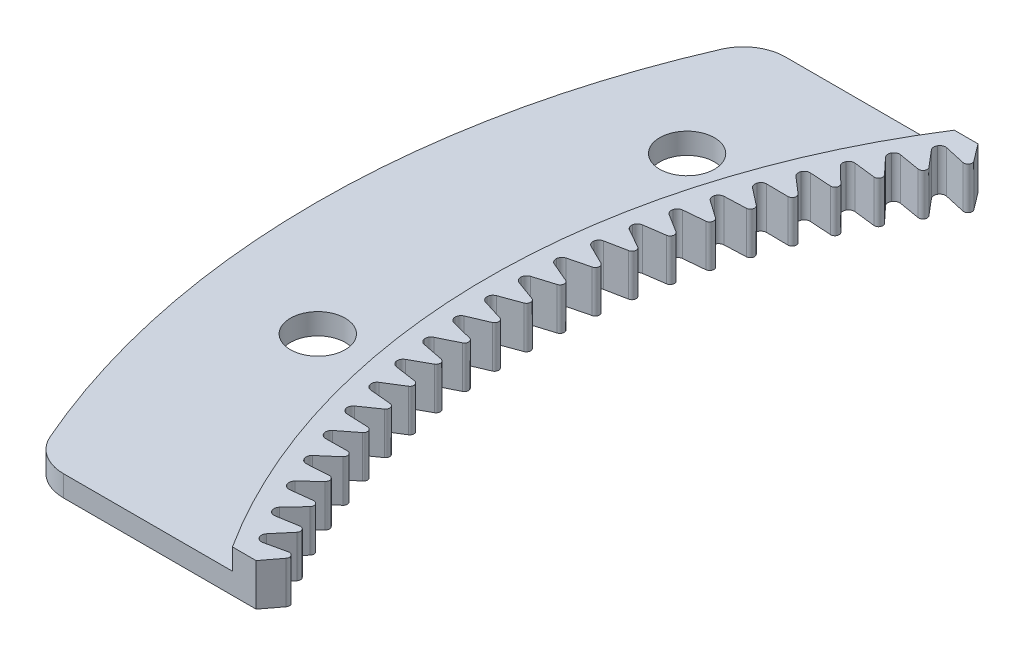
ISO-10303-21;
HEADER;
FILE_DESCRIPTION(('STEP AP214'),'2;1');
FILE_NAME('part.step','',(''),(''),'','','');
FILE_SCHEMA(('AUTOMOTIVE_DESIGN { 1 0 10303 214 1 1 1 1 }'));
ENDSEC;
DATA;
#1=APPLICATION_CONTEXT('core data for automotive mechanical design processes');
#2=APPLICATION_PROTOCOL_DEFINITION('international standard','automotive_design',2000,#1);
#3=PRODUCT_CONTEXT('',#1,'mechanical');
#4=PRODUCT('Part','Part','',(#3));
#5=PRODUCT_RELATED_PRODUCT_CATEGORY('part','',(#4));
#6=PRODUCT_DEFINITION_FORMATION('','',#4);
#7=PRODUCT_DEFINITION_CONTEXT('part definition',#1,'design');
#8=PRODUCT_DEFINITION('design','',#6,#7);
#9=PRODUCT_DEFINITION_SHAPE('','',#8);
#10=(LENGTH_UNIT() NAMED_UNIT(*) SI_UNIT(.MILLI.,.METRE.));
#11=(NAMED_UNIT(*) PLANE_ANGLE_UNIT() SI_UNIT($,.RADIAN.));
#12=(NAMED_UNIT(*) SI_UNIT($,.STERADIAN.) SOLID_ANGLE_UNIT());
#13=UNCERTAINTY_MEASURE_WITH_UNIT(LENGTH_MEASURE(1.E-05),#10,'distance_accuracy_value','');
#14=(GEOMETRIC_REPRESENTATION_CONTEXT(3) GLOBAL_UNCERTAINTY_ASSIGNED_CONTEXT((#13)) GLOBAL_UNIT_ASSIGNED_CONTEXT((#10,
#11,#12)) REPRESENTATION_CONTEXT('',''));
#15=CARTESIAN_POINT('',(0.,0.,0.));
#16=DIRECTION('',(0.,0.,1.));
#17=DIRECTION('',(1.,0.,0.));
#18=AXIS2_PLACEMENT_3D('',#15,#16,#17);
#19=CARTESIAN_POINT('',(0.,10.,0.));
#20=DIRECTION('',(0.,-1.,0.));
#21=DIRECTION('',(0.,0.,-1.));
#22=AXIS2_PLACEMENT_3D('',#19,#20,#21);
#23=CYLINDRICAL_SURFACE('',#22,159.163154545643);
#24=CARTESIAN_POINT('',(0.,5.,0.));
#25=DIRECTION('',(0.,1.,0.));
#26=DIRECTION('',(0.,0.,-1.));
#27=AXIS2_PLACEMENT_3D('',#24,#25,#26);
#28=CIRCLE('',#27,159.163154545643);
#29=CARTESIAN_POINT('',(-134.088577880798,5.,-85.7505862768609));
#30=VERTEX_POINT('',#29);
#31=CARTESIAN_POINT('',(-134.088577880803,5.,85.7505862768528));
#32=VERTEX_POINT('',#31);
#33=EDGE_CURVE('E1682',#30,#32,#28,.T.);
#34=ORIENTED_EDGE('',*,*,#33,.T.);
#35=DIRECTION('',(0.,-1.,0.));
#36=VECTOR('',#35,1.);
#37=CARTESIAN_POINT('',(-134.088577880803,10.,85.7505862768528));
#38=LINE('',#37,#36);
#39=CARTESIAN_POINT('',(-134.088577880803,10.,85.7505862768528));
#40=VERTEX_POINT('',#39);
#41=EDGE_CURVE('E1486',#40,#32,#38,.T.);
#42=ORIENTED_EDGE('',*,*,#41,.F.);
#43=CARTESIAN_POINT('',(0.,10.,0.));
#44=DIRECTION('',(0.,1.,0.));
#45=DIRECTION('',(0.,0.,1.));
#46=AXIS2_PLACEMENT_3D('',#43,#44,#45);
#47=CIRCLE('',#46,159.163154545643);
#48=CARTESIAN_POINT('',(-134.088577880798,10.,-85.7505862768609));
#49=VERTEX_POINT('',#48);
#50=EDGE_CURVE('E957',#49,#40,#47,.T.);
#51=ORIENTED_EDGE('',*,*,#50,.F.);
#52=DIRECTION('',(0.,-1.,0.));
#53=VECTOR('',#52,1.);
#54=CARTESIAN_POINT('',(-134.088577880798,10.,-85.7505862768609));
#55=LINE('',#54,#53);
#56=EDGE_CURVE('E1489',#49,#30,#55,.T.);
#57=ORIENTED_EDGE('',*,*,#56,.T.);
#58=EDGE_LOOP('',(#34,#42,#51,#57));
#59=FACE_BOUND('',#58,.T.);
#60=ADVANCED_FACE('F36',(#59),#23,.T.);
#61=CARTESIAN_POINT('',(-153.533065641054,10.,11.9852427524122));
#62=DIRECTION('',(0.,-1.,0.));
#63=DIRECTION('',(0.,0.,-1.));
#64=AXIS2_PLACEMENT_3D('',#61,#62,#63);
#65=CYLINDRICAL_SURFACE('',#64,1.39355394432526);
#66=CARTESIAN_POINT('',(-153.533065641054,0.,11.9852427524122));
#67=DIRECTION('',(0.,1.,0.));
#68=DIRECTION('',(0.,0.,1.));
#69=AXIS2_PLACEMENT_3D('',#66,#67,#68);
#70=CIRCLE('',#69,1.39355394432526);
#71=CARTESIAN_POINT('',(-154.922563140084,0.,12.0914938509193));
#72=VERTEX_POINT('',#71);
#73=CARTESIAN_POINT('',(-153.874231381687,0.,13.3363898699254));
#74=VERTEX_POINT('',#73);
#75=EDGE_CURVE('E779',#72,#74,#70,.T.);
#76=ORIENTED_EDGE('',*,*,#75,.F.);
#77=DIRECTION('',(0.,-1.,0.));
#78=VECTOR('',#77,1.);
#79=CARTESIAN_POINT('',(-154.922563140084,10.,12.0914938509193));
#80=LINE('',#79,#78);
#81=CARTESIAN_POINT('',(-154.922563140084,10.,12.0914938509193));
#82=VERTEX_POINT('',#81);
#83=EDGE_CURVE('E772',#82,#72,#80,.T.);
#84=ORIENTED_EDGE('',*,*,#83,.F.);
#85=CARTESIAN_POINT('',(-153.533065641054,10.,11.9852427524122));
#86=DIRECTION('',(0.,1.,0.));
#87=DIRECTION('',(0.,0.,1.));
#88=AXIS2_PLACEMENT_3D('',#85,#86,#87);
#89=CIRCLE('',#88,1.39355394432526);
#90=CARTESIAN_POINT('',(-153.874231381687,10.,13.3363898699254));
#91=VERTEX_POINT('',#90);
#92=EDGE_CURVE('E776',#82,#91,#89,.T.);
#93=ORIENTED_EDGE('',*,*,#92,.T.);
#94=DIRECTION('',(0.,-1.,0.));
#95=VECTOR('',#94,1.);
#96=CARTESIAN_POINT('',(-153.874231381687,10.,13.3363898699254));
#97=LINE('',#96,#95);
#98=EDGE_CURVE('E1075',#91,#74,#97,.T.);
#99=ORIENTED_EDGE('',*,*,#98,.T.);
#100=EDGE_LOOP('',(#76,#84,#93,#99));
#101=FACE_BOUND('',#100,.T.);
#102=ADVANCED_FACE('F774',(#101),#65,.F.);
#103=CARTESIAN_POINT('',(-153.533406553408,10.,11.9808748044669));
#104=DIRECTION('',(0.,-1.,0.));
#105=DIRECTION('',(0.,0.,-1.));
#106=AXIS2_PLACEMENT_3D('',#103,#104,#105);
#107=CYLINDRICAL_SURFACE('',#106,1.39355394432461);
#108=CARTESIAN_POINT('',(-153.533406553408,0.,11.9808748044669));
#109=DIRECTION('',(0.,1.,0.));
#110=DIRECTION('',(0.,0.,1.));
#111=AXIS2_PLACEMENT_3D('',#108,#109,#110);
#112=CIRCLE('',#111,1.39355394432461);
#113=CARTESIAN_POINT('',(-154.080074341,0.,10.6990218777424));
#114=VERTEX_POINT('',#113);
#115=EDGE_CURVE('E1077',#72,#114,#112,.F.);
#116=ORIENTED_EDGE('',*,*,#115,.T.);
#117=DIRECTION('',(0.,-1.,0.));
#118=VECTOR('',#117,1.);
#119=CARTESIAN_POINT('',(-154.080074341,10.,10.6990218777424));
#120=LINE('',#119,#118);
#121=CARTESIAN_POINT('',(-154.080074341,10.,10.6990218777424));
#122=VERTEX_POINT('',#121);
#123=EDGE_CURVE('E783',#122,#114,#120,.T.);
#124=ORIENTED_EDGE('',*,*,#123,.F.);
#125=CARTESIAN_POINT('',(-153.533406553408,10.,11.9808748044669));
#126=DIRECTION('',(0.,1.,0.));
#127=DIRECTION('',(0.,0.,1.));
#128=AXIS2_PLACEMENT_3D('',#125,#126,#127);
#129=CIRCLE('',#128,1.39355394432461);
#130=EDGE_CURVE('E786',#82,#122,#129,.F.);
#131=ORIENTED_EDGE('',*,*,#130,.F.);
#132=ORIENTED_EDGE('',*,*,#83,.T.);
#133=EDGE_LOOP('',(#116,#124,#131,#132));
#134=FACE_BOUND('',#133,.T.);
#135=ADVANCED_FACE('F787',(#134),#107,.F.);
#136=CARTESIAN_POINT('',(-19.8501519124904,10.,-46.5455911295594));
#137=DIRECTION('',(-0.392283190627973,0.,-0.919844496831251));
#138=DIRECTION('',(-0.919844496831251,0.,0.392283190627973));
#139=AXIS2_PLACEMENT_3D('',#136,#137,#138);
#140=PLANE('',#139);
#141=DIRECTION('',(0.919844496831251,0.,-0.392283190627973));
#142=VECTOR('',#141,1.);
#143=CARTESIAN_POINT('',(-19.8501519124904,0.,-46.5455911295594));
#144=LINE('',#143,#142);
#145=CARTESIAN_POINT('',(-149.405352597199,0.,8.70540799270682));
#146=VERTEX_POINT('',#145);
#147=EDGE_CURVE('E1080',#114,#146,#144,.T.);
#148=ORIENTED_EDGE('',*,*,#147,.T.);
#149=DIRECTION('',(0.,-1.,0.));
#150=VECTOR('',#149,1.);
#151=CARTESIAN_POINT('',(-149.405352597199,10.,8.70540799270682));
#152=LINE('',#151,#150);
#153=CARTESIAN_POINT('',(-149.405352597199,10.,8.70540799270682));
#154=VERTEX_POINT('',#153);
#155=EDGE_CURVE('E1640',#154,#146,#152,.T.);
#156=ORIENTED_EDGE('',*,*,#155,.F.);
#157=DIRECTION('',(0.919844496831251,0.,-0.392283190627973));
#158=VECTOR('',#157,1.);
#159=CARTESIAN_POINT('',(-19.8501519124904,10.,-46.5455911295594));
#160=LINE('',#159,#158);
#161=EDGE_CURVE('E791',#122,#154,#160,.T.);
#162=ORIENTED_EDGE('',*,*,#161,.F.);
#163=ORIENTED_EDGE('',*,*,#123,.T.);
#164=EDGE_LOOP('',(#148,#156,#162,#163));
#165=FACE_BOUND('',#164,.T.);
#166=ADVANCED_FACE('F1965',(#165),#140,.F.);
#167=CARTESIAN_POINT('',(-149.797635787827,10.,7.78556349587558));
#168=DIRECTION('',(0.,-1.,0.));
#169=DIRECTION('',(0.,0.,-1.));
#170=AXIS2_PLACEMENT_3D('',#167,#168,#169);
#171=CYLINDRICAL_SURFACE('',#170,1.);
#172=CARTESIAN_POINT('',(-149.797635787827,0.,7.78556349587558));
#173=DIRECTION('',(0.,1.,0.));
#174=DIRECTION('',(0.,0.,1.));
#175=AXIS2_PLACEMENT_3D('',#172,#173,#174);
#176=CIRCLE('',#175,1.);
#177=CARTESIAN_POINT('',(-149.502824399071,0.,6.83000803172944));
#178=VERTEX_POINT('',#177);
#179=EDGE_CURVE('E1082',#146,#178,#176,.T.);
#180=ORIENTED_EDGE('',*,*,#179,.T.);
#181=DIRECTION('',(0.,-1.,0.));
#182=VECTOR('',#181,1.);
#183=CARTESIAN_POINT('',(-149.502824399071,10.,6.83000803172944));
#184=LINE('',#183,#182);
#185=CARTESIAN_POINT('',(-149.502824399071,10.,6.83000803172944));
#186=VERTEX_POINT('',#185);
#187=EDGE_CURVE('E1638',#186,#178,#184,.T.);
#188=ORIENTED_EDGE('',*,*,#187,.F.);
#189=CARTESIAN_POINT('',(-149.797635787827,10.,7.78556349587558));
#190=DIRECTION('',(0.,1.,0.));
#191=DIRECTION('',(0.,0.,1.));
#192=AXIS2_PLACEMENT_3D('',#189,#190,#191);
#193=CIRCLE('',#192,1.);
#194=EDGE_CURVE('E806',#154,#186,#193,.T.);
#195=ORIENTED_EDGE('',*,*,#194,.F.);
#196=ORIENTED_EDGE('',*,*,#155,.T.);
#197=EDGE_LOOP('',(#180,#188,#195,#196));
#198=FACE_BOUND('',#197,.T.);
#199=ADVANCED_FACE('F1961',(#198),#171,.T.);
#200=CARTESIAN_POINT('',(-14.9179240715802,10.,48.352622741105));
#201=DIRECTION('',(0.294811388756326,0.,-0.955555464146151));
#202=DIRECTION('',(-0.955555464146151,0.,-0.294811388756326));
#203=AXIS2_PLACEMENT_3D('',#200,#201,#202);
#204=PLANE('',#203);
#205=DIRECTION('',(0.955555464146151,0.,0.294811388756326));
#206=VECTOR('',#205,1.);
#207=CARTESIAN_POINT('',(-14.9179240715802,0.,48.352622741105));
#208=LINE('',#207,#206);
#209=CARTESIAN_POINT('',(-154.359032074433,0.,5.33175347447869));
#210=VERTEX_POINT('',#209);
#211=EDGE_CURVE('E1085',#210,#178,#208,.T.);
#212=ORIENTED_EDGE('',*,*,#211,.F.);
#213=DIRECTION('',(0.,-1.,0.));
#214=VECTOR('',#213,1.);
#215=CARTESIAN_POINT('',(-154.359032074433,10.,5.33175347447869));
#216=LINE('',#215,#214);
#217=CARTESIAN_POINT('',(-154.359032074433,10.,5.33175347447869));
#218=VERTEX_POINT('',#217);
#219=EDGE_CURVE('E1636',#218,#210,#216,.T.);
#220=ORIENTED_EDGE('',*,*,#219,.F.);
#221=DIRECTION('',(0.955555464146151,0.,0.294811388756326));
#222=VECTOR('',#221,1.);
#223=CARTESIAN_POINT('',(-14.9179240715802,10.,48.352622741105));
#224=LINE('',#223,#222);
#225=EDGE_CURVE('E808',#218,#186,#224,.T.);
#226=ORIENTED_EDGE('',*,*,#225,.T.);
#227=ORIENTED_EDGE('',*,*,#187,.T.);
#228=EDGE_LOOP('',(#212,#220,#226,#227));
#229=FACE_BOUND('',#228,.T.);
#230=ADVANCED_FACE('F1957',(#229),#204,.T.);
#231=CARTESIAN_POINT('',(-153.9481965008,10.,4.00013538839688));
#232=DIRECTION('',(0.,-1.,0.));
#233=DIRECTION('',(0.,0.,-1.));
#234=AXIS2_PLACEMENT_3D('',#231,#232,#233);
#235=CYLINDRICAL_SURFACE('',#234,1.39355394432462);
#236=CARTESIAN_POINT('',(-153.9481965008,0.,4.00013538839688));
#237=DIRECTION('',(0.,1.,0.));
#238=DIRECTION('',(0.,0.,1.));
#239=AXIS2_PLACEMENT_3D('',#236,#237,#238);
#240=CIRCLE('',#239,1.39355394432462);
#241=CARTESIAN_POINT('',(-155.341335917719,0.,4.03412304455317));
#242=VERTEX_POINT('',#241);
#243=EDGE_CURVE('E1088',#242,#210,#240,.T.);
#244=ORIENTED_EDGE('',*,*,#243,.F.);
#245=DIRECTION('',(0.,-1.,0.));
#246=VECTOR('',#245,1.);
#247=CARTESIAN_POINT('',(-155.341335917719,10.,4.03412304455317));
#248=LINE('',#247,#246);
#249=CARTESIAN_POINT('',(-155.341335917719,10.,4.03412304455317));
#250=VERTEX_POINT('',#249);
#251=EDGE_CURVE('E1634',#250,#242,#248,.T.);
#252=ORIENTED_EDGE('',*,*,#251,.F.);
#253=CARTESIAN_POINT('',(-153.9481965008,10.,4.00013538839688));
#254=DIRECTION('',(0.,1.,0.));
#255=DIRECTION('',(0.,0.,1.));
#256=AXIS2_PLACEMENT_3D('',#253,#254,#255);
#257=CIRCLE('',#256,1.39355394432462);
#258=EDGE_CURVE('E811',#250,#218,#257,.T.);
#259=ORIENTED_EDGE('',*,*,#258,.T.);
#260=ORIENTED_EDGE('',*,*,#219,.T.);
#261=EDGE_LOOP('',(#244,#252,#259,#260));
#262=FACE_BOUND('',#261,.T.);
#263=ADVANCED_FACE('F1953',(#262),#235,.F.);
#264=CARTESIAN_POINT('',(-153.948310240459,10.,3.99575563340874));
#265=DIRECTION('',(0.,-1.,0.));
#266=DIRECTION('',(0.,0.,-1.));
#267=AXIS2_PLACEMENT_3D('',#264,#265,#266);
#268=CYLINDRICAL_SURFACE('',#267,1.39355394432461);
#269=CARTESIAN_POINT('',(-153.948310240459,0.,3.99575563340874));
#270=DIRECTION('',(0.,1.,0.));
#271=DIRECTION('',(0.,0.,1.));
#272=AXIS2_PLACEMENT_3D('',#269,#270,#271);
#273=CIRCLE('',#272,1.39355394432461);
#274=CARTESIAN_POINT('',(-154.427708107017,0.,2.68725638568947));
#275=VERTEX_POINT('',#274);
#276=EDGE_CURVE('E1091',#242,#275,#273,.F.);
#277=ORIENTED_EDGE('',*,*,#276,.T.);
#278=DIRECTION('',(0.,-1.,0.));
#279=VECTOR('',#278,1.);
#280=CARTESIAN_POINT('',(-154.427708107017,10.,2.68725638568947));
#281=LINE('',#280,#279);
#282=CARTESIAN_POINT('',(-154.427708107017,10.,2.68725638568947));
#283=VERTEX_POINT('',#282);
#284=EDGE_CURVE('E1631',#283,#275,#281,.T.);
#285=ORIENTED_EDGE('',*,*,#284,.F.);
#286=CARTESIAN_POINT('',(-153.948310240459,10.,3.99575563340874));
#287=DIRECTION('',(0.,1.,0.));
#288=DIRECTION('',(0.,0.,1.));
#289=AXIS2_PLACEMENT_3D('',#286,#287,#288);
#290=CIRCLE('',#289,1.39355394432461);
#291=EDGE_CURVE('E814',#250,#283,#290,.F.);
#292=ORIENTED_EDGE('',*,*,#291,.F.);
#293=ORIENTED_EDGE('',*,*,#251,.T.);
#294=EDGE_LOOP('',(#277,#285,#292,#293));
#295=FACE_BOUND('',#294,.T.);
#296=ADVANCED_FACE('F1949',(#295),#268,.F.);
#297=CARTESIAN_POINT('',(-17.4075017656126,10.,-47.5131504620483));
#298=DIRECTION('',(-0.344010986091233,0.,-0.938965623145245));
#299=DIRECTION('',(-0.938965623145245,0.,0.344010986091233));
#300=AXIS2_PLACEMENT_3D('',#297,#298,#299);
#301=PLANE('',#300);
#302=DIRECTION('',(0.938965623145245,0.,-0.344010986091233));
#303=VECTOR('',#302,1.);
#304=CARTESIAN_POINT('',(-17.4075017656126,0.,-47.5131504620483));
#305=LINE('',#304,#303);
#306=CARTESIAN_POINT('',(-149.655811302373,0.,0.938965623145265));
#307=VERTEX_POINT('',#306);
#308=EDGE_CURVE('E1093',#275,#307,#305,.T.);
#309=ORIENTED_EDGE('',*,*,#308,.T.);
#310=DIRECTION('',(0.,-1.,0.));
#311=VECTOR('',#310,1.);
#312=CARTESIAN_POINT('',(-149.655811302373,10.,0.938965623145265));
#313=LINE('',#312,#311);
#314=CARTESIAN_POINT('',(-149.655811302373,10.,0.938965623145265));
#315=VERTEX_POINT('',#314);
#316=EDGE_CURVE('E1628',#315,#307,#313,.T.);
#317=ORIENTED_EDGE('',*,*,#316,.F.);
#318=DIRECTION('',(0.938965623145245,0.,-0.344010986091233));
#319=VECTOR('',#318,1.);
#320=CARTESIAN_POINT('',(-17.4075017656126,10.,-47.5131504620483));
#321=LINE('',#320,#319);
#322=EDGE_CURVE('E816',#283,#315,#321,.T.);
#323=ORIENTED_EDGE('',*,*,#322,.F.);
#324=ORIENTED_EDGE('',*,*,#284,.T.);
#325=EDGE_LOOP('',(#309,#317,#323,#324));
#326=FACE_BOUND('',#325,.T.);
#327=ADVANCED_FACE('F1945',(#326),#301,.F.);
#328=CARTESIAN_POINT('',(-149.999822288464,10.,0.));
#329=DIRECTION('',(0.,-1.,0.));
#330=DIRECTION('',(0.,0.,-1.));
#331=AXIS2_PLACEMENT_3D('',#328,#329,#330);
#332=CYLINDRICAL_SURFACE('',#331,1.);
#333=CARTESIAN_POINT('',(-149.999822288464,0.,0.));
#334=DIRECTION('',(0.,1.,0.));
#335=DIRECTION('',(0.,0.,1.));
#336=AXIS2_PLACEMENT_3D('',#333,#334,#335);
#337=CIRCLE('',#336,1.);
#338=CARTESIAN_POINT('',(-149.655811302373,0.,-0.938965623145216));
#339=VERTEX_POINT('',#338);
#340=EDGE_CURVE('E1095',#307,#339,#337,.T.);
#341=ORIENTED_EDGE('',*,*,#340,.T.);
#342=DIRECTION('',(0.,-1.,0.));
#343=VECTOR('',#342,1.);
#344=CARTESIAN_POINT('',(-149.655811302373,10.,-0.938965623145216));
#345=LINE('',#344,#343);
#346=CARTESIAN_POINT('',(-149.655811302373,10.,-0.938965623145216));
#347=VERTEX_POINT('',#346);
#348=EDGE_CURVE('E1626',#347,#339,#345,.T.);
#349=ORIENTED_EDGE('',*,*,#348,.F.);
#350=CARTESIAN_POINT('',(-149.999822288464,10.,0.));
#351=DIRECTION('',(0.,1.,0.));
#352=DIRECTION('',(0.,0.,1.));
#353=AXIS2_PLACEMENT_3D('',#350,#351,#352);
#354=CIRCLE('',#353,1.);
#355=EDGE_CURVE('E818',#315,#347,#354,.T.);
#356=ORIENTED_EDGE('',*,*,#355,.F.);
#357=ORIENTED_EDGE('',*,*,#316,.T.);
#358=EDGE_LOOP('',(#341,#349,#356,#357));
#359=FACE_BOUND('',#358,.T.);
#360=ADVANCED_FACE('F1941',(#359),#332,.T.);
#361=CARTESIAN_POINT('',(-17.4075017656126,10.,47.5131504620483));
#362=DIRECTION('',(0.344010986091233,0.,-0.938965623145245));
#363=DIRECTION('',(-0.938965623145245,0.,-0.344010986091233));
#364=AXIS2_PLACEMENT_3D('',#361,#362,#363);
#365=PLANE('',#364);
#366=DIRECTION('',(0.938965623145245,0.,0.344010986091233));
#367=VECTOR('',#366,1.);
#368=CARTESIAN_POINT('',(-17.4075017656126,0.,47.5131504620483));
#369=LINE('',#368,#367);
#370=CARTESIAN_POINT('',(-154.427708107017,0.,-2.68725638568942));
#371=VERTEX_POINT('',#370);
#372=EDGE_CURVE('E1098',#371,#339,#369,.T.);
#373=ORIENTED_EDGE('',*,*,#372,.F.);
#374=DIRECTION('',(0.,-1.,0.));
#375=VECTOR('',#374,1.);
#376=CARTESIAN_POINT('',(-154.427708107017,10.,-2.68725638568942));
#377=LINE('',#376,#375);
#378=CARTESIAN_POINT('',(-154.427708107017,10.,-2.68725638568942));
#379=VERTEX_POINT('',#378);
#380=EDGE_CURVE('E1624',#379,#371,#377,.T.);
#381=ORIENTED_EDGE('',*,*,#380,.F.);
#382=DIRECTION('',(0.938965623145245,0.,0.344010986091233));
#383=VECTOR('',#382,1.);
#384=CARTESIAN_POINT('',(-17.4075017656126,10.,47.5131504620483));
#385=LINE('',#384,#383);
#386=EDGE_CURVE('E820',#379,#347,#385,.T.);
#387=ORIENTED_EDGE('',*,*,#386,.T.);
#388=ORIENTED_EDGE('',*,*,#348,.T.);
#389=EDGE_LOOP('',(#373,#381,#387,#388));
#390=FACE_BOUND('',#389,.T.);
#391=ADVANCED_FACE('F1937',(#390),#365,.T.);
#392=CARTESIAN_POINT('',(-153.948310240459,10.,-3.9957556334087));
#393=DIRECTION('',(0.,-1.,0.));
#394=DIRECTION('',(0.,0.,-1.));
#395=AXIS2_PLACEMENT_3D('',#392,#393,#394);
#396=CYLINDRICAL_SURFACE('',#395,1.39355394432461);
#397=CARTESIAN_POINT('',(-153.948310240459,0.,-3.9957556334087));
#398=DIRECTION('',(0.,1.,0.));
#399=DIRECTION('',(0.,0.,1.));
#400=AXIS2_PLACEMENT_3D('',#397,#398,#399);
#401=CIRCLE('',#400,1.39355394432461);
#402=CARTESIAN_POINT('',(-155.341335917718,0.,-4.03412304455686));
#403=VERTEX_POINT('',#402);
#404=EDGE_CURVE('E1101',#403,#371,#401,.T.);
#405=ORIENTED_EDGE('',*,*,#404,.F.);
#406=DIRECTION('',(0.,-1.,0.));
#407=VECTOR('',#406,1.);
#408=CARTESIAN_POINT('',(-155.341335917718,10.,-4.03412304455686));
#409=LINE('',#408,#407);
#410=CARTESIAN_POINT('',(-155.341335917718,10.,-4.03412304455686));
#411=VERTEX_POINT('',#410);
#412=EDGE_CURVE('E1622',#411,#403,#409,.T.);
#413=ORIENTED_EDGE('',*,*,#412,.F.);
#414=CARTESIAN_POINT('',(-153.948310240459,10.,-3.9957556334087));
#415=DIRECTION('',(0.,1.,0.));
#416=DIRECTION('',(0.,0.,1.));
#417=AXIS2_PLACEMENT_3D('',#414,#415,#416);
#418=CIRCLE('',#417,1.39355394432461);
#419=EDGE_CURVE('E823',#411,#379,#418,.T.);
#420=ORIENTED_EDGE('',*,*,#419,.T.);
#421=ORIENTED_EDGE('',*,*,#380,.T.);
#422=EDGE_LOOP('',(#405,#413,#420,#421));
#423=FACE_BOUND('',#422,.T.);
#424=ADVANCED_FACE('F1933',(#423),#396,.F.);
#425=CARTESIAN_POINT('',(-153.9481965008,10.,-4.00013538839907));
#426=DIRECTION('',(0.,-1.,0.));
#427=DIRECTION('',(0.,0.,-1.));
#428=AXIS2_PLACEMENT_3D('',#425,#426,#427);
#429=CYLINDRICAL_SURFACE('',#428,1.39355394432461);
#430=CARTESIAN_POINT('',(-153.9481965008,0.,-4.00013538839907));
#431=DIRECTION('',(0.,1.,0.));
#432=DIRECTION('',(0.,0.,1.));
#433=AXIS2_PLACEMENT_3D('',#430,#431,#432);
#434=CIRCLE('',#433,1.39355394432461);
#435=CARTESIAN_POINT('',(-154.359032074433,0.,-5.33175347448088));
#436=VERTEX_POINT('',#435);
#437=EDGE_CURVE('E1104',#403,#436,#434,.F.);
#438=ORIENTED_EDGE('',*,*,#437,.T.);
#439=DIRECTION('',(0.,-1.,0.));
#440=VECTOR('',#439,1.);
#441=CARTESIAN_POINT('',(-154.359032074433,10.,-5.33175347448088));
#442=LINE('',#441,#440);
#443=CARTESIAN_POINT('',(-154.359032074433,10.,-5.33175347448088));
#444=VERTEX_POINT('',#443);
#445=EDGE_CURVE('E1619',#444,#436,#442,.T.);
#446=ORIENTED_EDGE('',*,*,#445,.F.);
#447=CARTESIAN_POINT('',(-153.9481965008,10.,-4.00013538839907));
#448=DIRECTION('',(0.,1.,0.));
#449=DIRECTION('',(0.,0.,1.));
#450=AXIS2_PLACEMENT_3D('',#447,#448,#449);
#451=CIRCLE('',#450,1.39355394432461);
#452=EDGE_CURVE('E826',#411,#444,#451,.F.);
#453=ORIENTED_EDGE('',*,*,#452,.F.);
#454=ORIENTED_EDGE('',*,*,#412,.T.);
#455=EDGE_LOOP('',(#438,#446,#453,#454));
#456=FACE_BOUND('',#455,.T.);
#457=ADVANCED_FACE('F1929',(#456),#429,.F.);
#458=CARTESIAN_POINT('',(-14.9179240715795,10.,-48.3526227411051));
#459=DIRECTION('',(-0.294811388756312,0.,-0.955555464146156));
#460=DIRECTION('',(-0.955555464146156,0.,0.294811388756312));
#461=AXIS2_PLACEMENT_3D('',#458,#459,#460);
#462=PLANE('',#461);
#463=DIRECTION('',(0.955555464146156,0.,-0.294811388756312));
#464=VECTOR('',#463,1.);
#465=CARTESIAN_POINT('',(-14.9179240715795,0.,-48.3526227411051));
#466=LINE('',#465,#464);
#467=CARTESIAN_POINT('',(-149.50282439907,0.,-6.83000803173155));
#468=VERTEX_POINT('',#467);
#469=EDGE_CURVE('E1106',#436,#468,#466,.T.);
#470=ORIENTED_EDGE('',*,*,#469,.T.);
#471=DIRECTION('',(0.,-1.,0.));
#472=VECTOR('',#471,1.);
#473=CARTESIAN_POINT('',(-149.50282439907,10.,-6.83000803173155));
#474=LINE('',#473,#472);
#475=CARTESIAN_POINT('',(-149.50282439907,10.,-6.83000803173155));
#476=VERTEX_POINT('',#475);
#477=EDGE_CURVE('E1616',#476,#468,#474,.T.);
#478=ORIENTED_EDGE('',*,*,#477,.F.);
#479=DIRECTION('',(0.955555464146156,0.,-0.294811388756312));
#480=VECTOR('',#479,1.);
#481=CARTESIAN_POINT('',(-14.9179240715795,10.,-48.3526227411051));
#482=LINE('',#481,#480);
#483=EDGE_CURVE('E828',#444,#476,#482,.T.);
#484=ORIENTED_EDGE('',*,*,#483,.F.);
#485=ORIENTED_EDGE('',*,*,#445,.T.);
#486=EDGE_LOOP('',(#470,#478,#484,#485));
#487=FACE_BOUND('',#486,.T.);
#488=ADVANCED_FACE('F1925',(#487),#462,.F.);
#489=CARTESIAN_POINT('',(-149.797635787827,10.,-7.78556349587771));
#490=DIRECTION('',(0.,-1.,0.));
#491=DIRECTION('',(0.,0.,-1.));
#492=AXIS2_PLACEMENT_3D('',#489,#490,#491);
#493=CYLINDRICAL_SURFACE('',#492,1.);
#494=CARTESIAN_POINT('',(-149.797635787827,0.,-7.78556349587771));
#495=DIRECTION('',(0.,1.,0.));
#496=DIRECTION('',(0.,0.,1.));
#497=AXIS2_PLACEMENT_3D('',#494,#495,#496);
#498=CIRCLE('',#497,1.);
#499=CARTESIAN_POINT('',(-149.405352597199,0.,-8.70540799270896));
#500=VERTEX_POINT('',#499);
#501=EDGE_CURVE('E1108',#468,#500,#498,.T.);
#502=ORIENTED_EDGE('',*,*,#501,.T.);
#503=DIRECTION('',(0.,-1.,0.));
#504=VECTOR('',#503,1.);
#505=CARTESIAN_POINT('',(-149.405352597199,10.,-8.70540799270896));
#506=LINE('',#505,#504);
#507=CARTESIAN_POINT('',(-149.405352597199,10.,-8.70540799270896));
#508=VERTEX_POINT('',#507);
#509=EDGE_CURVE('E1614',#508,#500,#506,.T.);
#510=ORIENTED_EDGE('',*,*,#509,.F.);
#511=CARTESIAN_POINT('',(-149.797635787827,10.,-7.78556349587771));
#512=DIRECTION('',(0.,1.,0.));
#513=DIRECTION('',(0.,0.,1.));
#514=AXIS2_PLACEMENT_3D('',#511,#512,#513);
#515=CIRCLE('',#514,1.);
#516=EDGE_CURVE('E830',#476,#508,#515,.T.);
#517=ORIENTED_EDGE('',*,*,#516,.F.);
#518=ORIENTED_EDGE('',*,*,#477,.T.);
#519=EDGE_LOOP('',(#502,#510,#517,#518));
#520=FACE_BOUND('',#519,.T.);
#521=ADVANCED_FACE('F1921',(#520),#493,.T.);
#522=CARTESIAN_POINT('',(-19.8501519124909,10.,46.5455911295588));
#523=DIRECTION('',(0.392283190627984,0.,-0.919844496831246));
#524=DIRECTION('',(-0.919844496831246,0.,-0.392283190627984));
#525=AXIS2_PLACEMENT_3D('',#522,#523,#524);
#526=PLANE('',#525);
#527=DIRECTION('',(0.919844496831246,0.,0.392283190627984));
#528=VECTOR('',#527,1.);
#529=CARTESIAN_POINT('',(-19.8501519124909,0.,46.5455911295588));
#530=LINE('',#529,#528);
#531=CARTESIAN_POINT('',(-154.080074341,0.,-10.6990218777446));
#532=VERTEX_POINT('',#531);
#533=EDGE_CURVE('E1111',#532,#500,#530,.T.);
#534=ORIENTED_EDGE('',*,*,#533,.F.);
#535=DIRECTION('',(0.,-1.,0.));
#536=VECTOR('',#535,1.);
#537=CARTESIAN_POINT('',(-154.080074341,10.,-10.6990218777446));
#538=LINE('',#537,#536);
#539=CARTESIAN_POINT('',(-154.080074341,10.,-10.6990218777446));
#540=VERTEX_POINT('',#539);
#541=EDGE_CURVE('E1612',#540,#532,#538,.T.);
#542=ORIENTED_EDGE('',*,*,#541,.F.);
#543=DIRECTION('',(0.919844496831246,0.,0.392283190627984));
#544=VECTOR('',#543,1.);
#545=CARTESIAN_POINT('',(-19.8501519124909,10.,46.5455911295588));
#546=LINE('',#545,#544);
#547=EDGE_CURVE('E832',#540,#508,#546,.T.);
#548=ORIENTED_EDGE('',*,*,#547,.T.);
#549=ORIENTED_EDGE('',*,*,#509,.T.);
#550=EDGE_LOOP('',(#534,#542,#548,#549));
#551=FACE_BOUND('',#550,.T.);
#552=ADVANCED_FACE('F1917',(#551),#526,.T.);
#553=CARTESIAN_POINT('',(-153.533406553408,10.,-11.980874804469));
#554=DIRECTION('',(0.,-1.,0.));
#555=DIRECTION('',(0.,0.,-1.));
#556=AXIS2_PLACEMENT_3D('',#553,#554,#555);
#557=CYLINDRICAL_SURFACE('',#556,1.39355394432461);
#558=CARTESIAN_POINT('',(-153.533406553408,0.,-11.980874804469));
#559=DIRECTION('',(0.,1.,0.));
#560=DIRECTION('',(0.,0.,1.));
#561=AXIS2_PLACEMENT_3D('',#558,#559,#560);
#562=CIRCLE('',#561,1.39355394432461);
#563=CARTESIAN_POINT('',(-154.922563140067,0.,-12.0914938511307));
#564=VERTEX_POINT('',#563);
#565=EDGE_CURVE('E1114',#564,#532,#562,.T.);
#566=ORIENTED_EDGE('',*,*,#565,.F.);
#567=DIRECTION('',(0.,-1.,0.));
#568=VECTOR('',#567,1.);
#569=CARTESIAN_POINT('',(-154.922563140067,10.,-12.0914938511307));
#570=LINE('',#569,#568);
#571=CARTESIAN_POINT('',(-154.922563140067,10.,-12.0914938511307));
#572=VERTEX_POINT('',#571);
#573=EDGE_CURVE('E1610',#572,#564,#570,.T.);
#574=ORIENTED_EDGE('',*,*,#573,.F.);
#575=CARTESIAN_POINT('',(-153.533406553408,10.,-11.980874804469));
#576=DIRECTION('',(0.,1.,0.));
#577=DIRECTION('',(0.,0.,1.));
#578=AXIS2_PLACEMENT_3D('',#575,#576,#577);
#579=CIRCLE('',#578,1.39355394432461);
#580=EDGE_CURVE('E835',#572,#540,#579,.T.);
#581=ORIENTED_EDGE('',*,*,#580,.T.);
#582=ORIENTED_EDGE('',*,*,#541,.T.);
#583=EDGE_LOOP('',(#566,#574,#581,#582));
#584=FACE_BOUND('',#583,.T.);
#585=ADVANCED_FACE('F1913',(#584),#557,.F.);
#586=CARTESIAN_POINT('',(-153.533065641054,10.,-11.9852427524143));
#587=DIRECTION('',(0.,-1.,0.));
#588=DIRECTION('',(0.,0.,-1.));
#589=AXIS2_PLACEMENT_3D('',#586,#587,#588);
#590=CYLINDRICAL_SURFACE('',#589,1.3935539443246);
#591=CARTESIAN_POINT('',(-153.533065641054,0.,-11.9852427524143));
#592=DIRECTION('',(0.,1.,0.));
#593=DIRECTION('',(0.,0.,1.));
#594=AXIS2_PLACEMENT_3D('',#591,#592,#593);
#595=CIRCLE('',#594,1.3935539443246);
#596=CARTESIAN_POINT('',(-153.87423138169,0.,-13.3363898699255));
#597=VERTEX_POINT('',#596);
#598=EDGE_CURVE('E1117',#564,#597,#595,.F.);
#599=ORIENTED_EDGE('',*,*,#598,.T.);
#600=DIRECTION('',(0.,-1.,0.));
#601=VECTOR('',#600,1.);
#602=CARTESIAN_POINT('',(-153.87423138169,10.,-13.3363898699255));
#603=LINE('',#602,#601);
#604=CARTESIAN_POINT('',(-153.87423138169,10.,-13.3363898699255));
#605=VERTEX_POINT('',#604);
#606=EDGE_CURVE('E1607',#605,#597,#603,.T.);
#607=ORIENTED_EDGE('',*,*,#606,.F.);
#608=CARTESIAN_POINT('',(-153.533065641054,10.,-11.9852427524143));
#609=DIRECTION('',(0.,1.,0.));
#610=DIRECTION('',(0.,0.,1.));
#611=AXIS2_PLACEMENT_3D('',#608,#609,#610);
#612=CIRCLE('',#611,1.3935539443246);
#613=EDGE_CURVE('E838',#572,#605,#612,.F.);
#614=ORIENTED_EDGE('',*,*,#613,.F.);
#615=ORIENTED_EDGE('',*,*,#573,.T.);
#616=EDGE_LOOP('',(#599,#607,#614,#615));
#617=FACE_BOUND('',#616,.T.);
#618=ADVANCED_FACE('F1909',(#617),#590,.F.);
#619=CARTESIAN_POINT('',(-12.3881302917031,10.,-49.0617448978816));
#620=DIRECTION('',(-0.244817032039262,0.,-0.969569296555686));
#621=DIRECTION('',(-0.969569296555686,0.,0.244817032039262));
#622=AXIS2_PLACEMENT_3D('',#619,#620,#621);
#623=PLANE('',#622);
#624=DIRECTION('',(0.969569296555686,0.,-0.244817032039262));
#625=VECTOR('',#624,1.);
#626=CARTESIAN_POINT('',(-12.3881302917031,0.,-49.0617448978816));
#627=LINE('',#626,#625);
#628=CARTESIAN_POINT('',(-148.946804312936,0.,-14.5805691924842));
#629=VERTEX_POINT('',#628);
#630=EDGE_CURVE('E1119',#597,#629,#627,.T.);
#631=ORIENTED_EDGE('',*,*,#630,.T.);
#632=DIRECTION('',(0.,-1.,0.));
#633=VECTOR('',#632,1.);
#634=CARTESIAN_POINT('',(-148.946804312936,10.,-14.5805691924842));
#635=LINE('',#634,#633);
#636=CARTESIAN_POINT('',(-148.946804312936,10.,-14.5805691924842));
#637=VERTEX_POINT('',#636);
#638=EDGE_CURVE('E1604',#637,#629,#635,.T.);
#639=ORIENTED_EDGE('',*,*,#638,.F.);
#640=DIRECTION('',(0.969569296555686,0.,-0.244817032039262));
#641=VECTOR('',#640,1.);
#642=CARTESIAN_POINT('',(-12.3881302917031,10.,-49.0617448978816));
#643=LINE('',#642,#641);
#644=EDGE_CURVE('E840',#605,#637,#643,.T.);
#645=ORIENTED_EDGE('',*,*,#644,.F.);
#646=ORIENTED_EDGE('',*,*,#606,.T.);
#647=EDGE_LOOP('',(#631,#639,#645,#646));
#648=FACE_BOUND('',#647,.T.);
#649=ADVANCED_FACE('F1905',(#648),#623,.F.);
#650=CARTESIAN_POINT('',(-149.191621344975,10.,-15.5501384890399));
#651=DIRECTION('',(0.,-1.,0.));
#652=DIRECTION('',(0.,0.,-1.));
#653=AXIS2_PLACEMENT_3D('',#650,#651,#652);
#654=CYLINDRICAL_SURFACE('',#653,1.00000000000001);
#655=CARTESIAN_POINT('',(-149.191621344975,0.,-15.5501384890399));
#656=DIRECTION('',(0.,1.,0.));
#657=DIRECTION('',(0.,0.,1.));
#658=AXIS2_PLACEMENT_3D('',#655,#656,#657);
#659=CIRCLE('',#658,1.00000000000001);
#660=CARTESIAN_POINT('',(-148.752123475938,0.,-16.44838212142));
#661=VERTEX_POINT('',#660);
#662=EDGE_CURVE('E1121',#629,#661,#659,.T.);
#663=ORIENTED_EDGE('',*,*,#662,.T.);
#664=DIRECTION('',(0.,-1.,0.));
#665=VECTOR('',#664,1.);
#666=CARTESIAN_POINT('',(-148.752123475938,10.,-16.44838212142));
#667=LINE('',#666,#665);
#668=CARTESIAN_POINT('',(-148.752123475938,10.,-16.44838212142));
#669=VERTEX_POINT('',#668);
#670=EDGE_CURVE('E1602',#669,#661,#667,.T.);
#671=ORIENTED_EDGE('',*,*,#670,.F.);
#672=CARTESIAN_POINT('',(-149.191621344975,10.,-15.5501384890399));
#673=DIRECTION('',(0.,1.,0.));
#674=DIRECTION('',(0.,0.,1.));
#675=AXIS2_PLACEMENT_3D('',#672,#673,#674);
#676=CIRCLE('',#675,1.00000000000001);
#677=EDGE_CURVE('E842',#637,#669,#676,.T.);
#678=ORIENTED_EDGE('',*,*,#677,.F.);
#679=ORIENTED_EDGE('',*,*,#638,.T.);
#680=EDGE_LOOP('',(#663,#671,#678,#679));
#681=FACE_BOUND('',#680,.T.);
#682=ADVANCED_FACE('F1901',(#681),#654,.T.);
#683=CARTESIAN_POINT('',(-22.2392895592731,10.,45.452553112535));
#684=DIRECTION('',(0.439497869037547,0.,-0.898243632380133));
#685=DIRECTION('',(-0.898243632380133,0.,-0.439497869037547));
#686=AXIS2_PLACEMENT_3D('',#683,#684,#685);
#687=PLANE('',#686);
#688=DIRECTION('',(0.898243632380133,0.,0.439497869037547));
#689=VECTOR('',#688,1.);
#690=CARTESIAN_POINT('',(-22.2392895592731,0.,45.452553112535));
#691=LINE('',#690,#689);
#692=CARTESIAN_POINT('',(-153.317067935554,0.,-18.6819446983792));
#693=VERTEX_POINT('',#692);
#694=EDGE_CURVE('E1124',#693,#661,#691,.T.);
#695=ORIENTED_EDGE('',*,*,#694,.F.);
#696=DIRECTION('',(0.,-1.,0.));
#697=VECTOR('',#696,1.);
#698=CARTESIAN_POINT('',(-153.317067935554,10.,-18.6819446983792));
#699=LINE('',#698,#697);
#700=CARTESIAN_POINT('',(-153.317067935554,10.,-18.6819446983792));
#701=VERTEX_POINT('',#700);
#702=EDGE_CURVE('E1600',#701,#693,#699,.T.);
#703=ORIENTED_EDGE('',*,*,#702,.F.);
#704=DIRECTION('',(0.898243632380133,0.,0.439497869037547));
#705=VECTOR('',#704,1.);
#706=CARTESIAN_POINT('',(-22.2392895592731,10.,45.452553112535));
#707=LINE('',#706,#705);
#708=EDGE_CURVE('E844',#701,#669,#707,.T.);
#709=ORIENTED_EDGE('',*,*,#708,.T.);
#710=ORIENTED_EDGE('',*,*,#670,.T.);
#711=EDGE_LOOP('',(#695,#703,#709,#710));
#712=FACE_BOUND('',#711,.T.);
#713=ADVANCED_FACE('F1897',(#712),#687,.T.);
#714=CARTESIAN_POINT('',(-152.704603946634,10.,-19.933695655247));
#715=DIRECTION('',(0.,-1.,0.));
#716=DIRECTION('',(0.,0.,-1.));
#717=AXIS2_PLACEMENT_3D('',#714,#715,#716);
#718=CYLINDRICAL_SURFACE('',#717,1.39355394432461);
#719=CARTESIAN_POINT('',(-152.704603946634,0.,-19.933695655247));
#720=DIRECTION('',(0.,1.,0.));
#721=DIRECTION('',(0.,0.,1.));
#722=AXIS2_PLACEMENT_3D('',#719,#720,#721);
#723=CIRCLE('',#722,1.39355394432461);
#724=CARTESIAN_POINT('',(-154.086146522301,0.,-20.1162681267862));
#725=VERTEX_POINT('',#724);
#726=EDGE_CURVE('E1127',#725,#693,#723,.T.);
#727=ORIENTED_EDGE('',*,*,#726,.F.);
#728=DIRECTION('',(0.,-1.,0.));
#729=VECTOR('',#728,1.);
#730=CARTESIAN_POINT('',(-154.086146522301,10.,-20.1162681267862));
#731=LINE('',#730,#729);
#732=CARTESIAN_POINT('',(-154.086146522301,10.,-20.1162681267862));
#733=VERTEX_POINT('',#732);
#734=EDGE_CURVE('E1598',#733,#725,#731,.T.);
#735=ORIENTED_EDGE('',*,*,#734,.F.);
#736=CARTESIAN_POINT('',(-152.704603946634,10.,-19.933695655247));
#737=DIRECTION('',(0.,1.,0.));
#738=DIRECTION('',(0.,0.,1.));
#739=AXIS2_PLACEMENT_3D('',#736,#737,#738);
#740=CIRCLE('',#739,1.39355394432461);
#741=EDGE_CURVE('E847',#733,#701,#740,.T.);
#742=ORIENTED_EDGE('',*,*,#741,.T.);
#743=ORIENTED_EDGE('',*,*,#702,.T.);
#744=EDGE_LOOP('',(#727,#735,#742,#743));
#745=FACE_BOUND('',#744,.T.);
#746=ADVANCED_FACE('F1893',(#745),#718,.F.);
#747=CARTESIAN_POINT('',(-152.704036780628,10.,-19.938040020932));
#748=DIRECTION('',(0.,-1.,0.));
#749=DIRECTION('',(0.,0.,-1.));
#750=AXIS2_PLACEMENT_3D('',#747,#748,#749);
#751=CYLINDRICAL_SURFACE('',#750,1.3935539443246);
#752=CARTESIAN_POINT('',(-152.704036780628,0.,-19.938040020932));
#753=DIRECTION('',(0.,1.,0.));
#754=DIRECTION('',(0.,0.,1.));
#755=AXIS2_PLACEMENT_3D('',#752,#753,#754);
#756=CIRCLE('',#755,1.3935539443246);
#757=CARTESIAN_POINT('',(-152.974612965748,0.,-21.3050737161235));
#758=VERTEX_POINT('',#757);
#759=EDGE_CURVE('E1130',#725,#758,#756,.F.);
#760=ORIENTED_EDGE('',*,*,#759,.T.);
#761=DIRECTION('',(0.,-1.,0.));
#762=VECTOR('',#761,1.);
#763=CARTESIAN_POINT('',(-152.974612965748,10.,-21.3050737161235));
#764=LINE('',#763,#762);
#765=CARTESIAN_POINT('',(-152.974612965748,10.,-21.3050737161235));
#766=VERTEX_POINT('',#765);
#767=EDGE_CURVE('E1595',#766,#758,#764,.T.);
#768=ORIENTED_EDGE('',*,*,#767,.F.);
#769=CARTESIAN_POINT('',(-152.704036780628,10.,-19.938040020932));
#770=DIRECTION('',(0.,1.,0.));
#771=DIRECTION('',(0.,0.,1.));
#772=AXIS2_PLACEMENT_3D('',#769,#770,#771);
#773=CIRCLE('',#772,1.3935539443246);
#774=EDGE_CURVE('E850',#733,#766,#773,.F.);
#775=ORIENTED_EDGE('',*,*,#774,.F.);
#776=ORIENTED_EDGE('',*,*,#734,.T.);
#777=EDGE_LOOP('',(#760,#768,#775,#776));
#778=FACE_BOUND('',#777,.T.);
#779=ADVANCED_FACE('F1889',(#778),#751,.F.);
#780=CARTESIAN_POINT('',(-9.82494030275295,10.,-49.6386052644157));
#781=DIRECTION('',(-0.19416269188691,0.,-0.980969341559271));
#782=DIRECTION('',(-0.980969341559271,0.,0.19416269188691));
#783=AXIS2_PLACEMENT_3D('',#780,#781,#782);
#784=PLANE('',#783);
#785=DIRECTION('',(0.980969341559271,0.,-0.19416269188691));
#786=VECTOR('',#785,1.);
#787=CARTESIAN_POINT('',(-9.82494030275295,0.,-49.6386052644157));
#788=LINE('',#787,#786);
#789=CARTESIAN_POINT('',(-147.989249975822,0.,-22.2918237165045));
#790=VERTEX_POINT('',#789);
#791=EDGE_CURVE('E1132',#758,#790,#788,.T.);
#792=ORIENTED_EDGE('',*,*,#791,.T.);
#793=DIRECTION('',(0.,-1.,0.));
#794=VECTOR('',#793,1.);
#795=CARTESIAN_POINT('',(-147.989249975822,10.,-22.2918237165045));
#796=LINE('',#795,#794);
#797=CARTESIAN_POINT('',(-147.989249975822,10.,-22.2918237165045));
#798=VERTEX_POINT('',#797);
#799=EDGE_CURVE('E1592',#798,#790,#796,.T.);
#800=ORIENTED_EDGE('',*,*,#799,.F.);
#801=DIRECTION('',(0.980969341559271,0.,-0.19416269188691));
#802=VECTOR('',#801,1.);
#803=CARTESIAN_POINT('',(-9.82494030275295,10.,-49.6386052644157));
#804=LINE('',#803,#802);
#805=EDGE_CURVE('E852',#766,#798,#804,.T.);
#806=ORIENTED_EDGE('',*,*,#805,.F.);
#807=ORIENTED_EDGE('',*,*,#767,.T.);
#808=EDGE_LOOP('',(#792,#800,#806,#807));
#809=FACE_BOUND('',#808,.T.);
#810=ADVANCED_FACE('F1885',(#809),#784,.F.);
#811=CARTESIAN_POINT('',(-148.183412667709,10.,-23.2727930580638));
#812=DIRECTION('',(0.,-1.,0.));
#813=DIRECTION('',(0.,0.,-1.));
#814=AXIS2_PLACEMENT_3D('',#811,#812,#813);
#815=CYLINDRICAL_SURFACE('',#814,0.999999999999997);
#816=CARTESIAN_POINT('',(-148.183412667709,0.,-23.2727930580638));
#817=DIRECTION('',(0.,1.,0.));
#818=DIRECTION('',(0.,0.,1.));
#819=AXIS2_PLACEMENT_3D('',#816,#817,#818);
#820=CIRCLE('',#819,0.999999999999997);
#821=CARTESIAN_POINT('',(-147.697884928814,0.,-24.1470143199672));
#822=VERTEX_POINT('',#821);
#823=EDGE_CURVE('E1134',#790,#822,#820,.T.);
#824=ORIENTED_EDGE('',*,*,#823,.T.);
#825=DIRECTION('',(0.,-1.,0.));
#826=VECTOR('',#825,1.);
#827=CARTESIAN_POINT('',(-147.697884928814,10.,-24.1470143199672));
#828=LINE('',#827,#826);
#829=CARTESIAN_POINT('',(-147.697884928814,10.,-24.1470143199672));
#830=VERTEX_POINT('',#829);
#831=EDGE_CURVE('E1590',#830,#822,#828,.T.);
#832=ORIENTED_EDGE('',*,*,#831,.F.);
#833=CARTESIAN_POINT('',(-148.183412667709,10.,-23.2727930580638));
#834=DIRECTION('',(0.,1.,0.));
#835=DIRECTION('',(0.,0.,1.));
#836=AXIS2_PLACEMENT_3D('',#833,#834,#835);
#837=CIRCLE('',#836,0.999999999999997);
#838=EDGE_CURVE('E854',#798,#830,#837,.T.);
#839=ORIENTED_EDGE('',*,*,#838,.F.);
#840=ORIENTED_EDGE('',*,*,#799,.T.);
#841=EDGE_LOOP('',(#824,#832,#839,#840));
#842=FACE_BOUND('',#841,.T.);
#843=ADVANCED_FACE('F1881',(#842),#815,.T.);
#844=CARTESIAN_POINT('',(-24.5684740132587,10.,44.2369830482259));
#845=DIRECTION('',(0.485527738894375,0.,-0.874221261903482));
#846=DIRECTION('',(-0.874221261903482,0.,-0.485527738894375));
#847=AXIS2_PLACEMENT_3D('',#844,#845,#846);
#848=PLANE('',#847);
#849=DIRECTION('',(0.874221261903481,0.,0.485527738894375));
#850=VECTOR('',#849,1.);
#851=CARTESIAN_POINT('',(-24.5684740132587,0.,44.2369830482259));
#852=LINE('',#851,#850);
#853=CARTESIAN_POINT('',(-152.140745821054,0.,-26.6145042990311));
#854=VERTEX_POINT('',#853);
#855=EDGE_CURVE('E1137',#854,#822,#852,.T.);
#856=ORIENTED_EDGE('',*,*,#855,.F.);
#857=DIRECTION('',(0.,-1.,0.));
#858=VECTOR('',#857,1.);
#859=CARTESIAN_POINT('',(-152.140745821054,10.,-26.6145042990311));
#860=LINE('',#859,#858);
#861=CARTESIAN_POINT('',(-152.140745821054,10.,-26.6145042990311));
#862=VERTEX_POINT('',#861);
#863=EDGE_CURVE('E1588',#862,#854,#860,.T.);
#864=ORIENTED_EDGE('',*,*,#863,.F.);
#865=DIRECTION('',(0.874221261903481,0.,0.485527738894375));
#866=VECTOR('',#865,1.);
#867=CARTESIAN_POINT('',(-24.5684740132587,10.,44.2369830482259));
#868=LINE('',#867,#866);
#869=EDGE_CURVE('E856',#862,#830,#868,.T.);
#870=ORIENTED_EDGE('',*,*,#869,.T.);
#871=ORIENTED_EDGE('',*,*,#831,.T.);
#872=EDGE_LOOP('',(#856,#864,#870,#871));
#873=FACE_BOUND('',#872,.T.);
#874=ADVANCED_FACE('F1877',(#873),#848,.T.);
#875=CARTESIAN_POINT('',(-151.464136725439,10.,-27.8327787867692));
#876=DIRECTION('',(0.,-1.,0.));
#877=DIRECTION('',(0.,0.,-1.));
#878=AXIS2_PLACEMENT_3D('',#875,#876,#877);
#879=CYLINDRICAL_SURFACE('',#878,1.39355394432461);
#880=CARTESIAN_POINT('',(-151.464136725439,0.,-27.8327787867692));
#881=DIRECTION('',(0.,1.,0.));
#882=DIRECTION('',(0.,0.,1.));
#883=AXIS2_PLACEMENT_3D('',#880,#881,#882);
#884=CIRCLE('',#883,1.39355394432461);
#885=CARTESIAN_POINT('',(-152.834340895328,0.,-28.0868125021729));
#886=VERTEX_POINT('',#885);
#887=EDGE_CURVE('E1140',#886,#854,#884,.T.);
#888=ORIENTED_EDGE('',*,*,#887,.F.);
#889=DIRECTION('',(0.,-1.,0.));
#890=VECTOR('',#889,1.);
#891=CARTESIAN_POINT('',(-152.834340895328,10.,-28.0868125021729));
#892=LINE('',#891,#890);
#893=CARTESIAN_POINT('',(-152.834340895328,10.,-28.0868125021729));
#894=VERTEX_POINT('',#893);
#895=EDGE_CURVE('E1586',#894,#886,#892,.T.);
#896=ORIENTED_EDGE('',*,*,#895,.F.);
#897=CARTESIAN_POINT('',(-151.464136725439,10.,-27.8327787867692));
#898=DIRECTION('',(0.,1.,0.));
#899=DIRECTION('',(0.,0.,1.));
#900=AXIS2_PLACEMENT_3D('',#897,#898,#899);
#901=CIRCLE('',#900,1.39355394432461);
#902=EDGE_CURVE('E859',#894,#862,#901,.T.);
#903=ORIENTED_EDGE('',*,*,#902,.T.);
#904=ORIENTED_EDGE('',*,*,#863,.T.);
#905=EDGE_LOOP('',(#888,#896,#903,#904));
#906=FACE_BOUND('',#905,.T.);
#907=ADVANCED_FACE('F1873',(#906),#879,.F.);
#908=CARTESIAN_POINT('',(-151.463344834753,10.,-27.8370878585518));
#909=DIRECTION('',(0.,-1.,0.));
#910=DIRECTION('',(0.,0.,-1.));
#911=AXIS2_PLACEMENT_3D('',#908,#909,#910);
#912=CYLINDRICAL_SURFACE('',#911,1.3935539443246);
#913=CARTESIAN_POINT('',(-151.463344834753,0.,-27.8370878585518));
#914=DIRECTION('',(0.,1.,0.));
#915=DIRECTION('',(0.,0.,1.));
#916=AXIS2_PLACEMENT_3D('',#913,#914,#915);
#917=CIRCLE('',#916,1.3935539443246);
#918=CARTESIAN_POINT('',(-151.662602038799,0.,-29.2163228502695));
#919=VERTEX_POINT('',#918);
#920=EDGE_CURVE('E1143',#886,#919,#917,.F.);
#921=ORIENTED_EDGE('',*,*,#920,.T.);
#922=DIRECTION('',(0.,-1.,0.));
#923=VECTOR('',#922,1.);
#924=CARTESIAN_POINT('',(-151.662602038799,10.,-29.2163228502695));
#925=LINE('',#924,#923);
#926=CARTESIAN_POINT('',(-151.662602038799,10.,-29.2163228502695));
#927=VERTEX_POINT('',#926);
#928=EDGE_CURVE('E1583',#927,#919,#925,.T.);
#929=ORIENTED_EDGE('',*,*,#928,.F.);
#930=CARTESIAN_POINT('',(-151.463344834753,10.,-27.8370878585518));
#931=DIRECTION('',(0.,1.,0.));
#932=DIRECTION('',(0.,0.,1.));
#933=AXIS2_PLACEMENT_3D('',#930,#931,#932);
#934=CIRCLE('',#933,1.3935539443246);
#935=EDGE_CURVE('E862',#894,#927,#934,.F.);
#936=ORIENTED_EDGE('',*,*,#935,.F.);
#937=ORIENTED_EDGE('',*,*,#895,.T.);
#938=EDGE_LOOP('',(#921,#929,#936,#937));
#939=FACE_BOUND('',#938,.T.);
#940=ADVANCED_FACE('F1869',(#939),#912,.F.);
#941=CARTESIAN_POINT('',(-7.23526401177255,10.,-50.0816487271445));
#942=DIRECTION('',(-0.142984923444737,0.,-0.989724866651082));
#943=DIRECTION('',(-0.989724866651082,0.,0.142984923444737));
#944=AXIS2_PLACEMENT_3D('',#941,#942,#943);
#945=PLANE('',#944);
#946=DIRECTION('',(0.989724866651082,0.,-0.142984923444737));
#947=VECTOR('',#946,1.);
#948=CARTESIAN_POINT('',(-7.23526401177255,0.,-50.0816487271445));
#949=LINE('',#948,#947);
#950=CARTESIAN_POINT('',(-146.632742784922,0.,-29.942983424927));
#951=VERTEX_POINT('',#950);
#952=EDGE_CURVE('E1145',#919,#951,#949,.T.);
#953=ORIENTED_EDGE('',*,*,#952,.T.);
#954=DIRECTION('',(0.,-1.,0.));
#955=VECTOR('',#954,1.);
#956=CARTESIAN_POINT('',(-146.632742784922,10.,-29.942983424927));
#957=LINE('',#956,#955);
#958=CARTESIAN_POINT('',(-146.632742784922,10.,-29.942983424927));
#959=VERTEX_POINT('',#958);
#960=EDGE_CURVE('E1580',#959,#951,#957,.T.);
#961=ORIENTED_EDGE('',*,*,#960,.F.);
#962=DIRECTION('',(0.989724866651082,0.,-0.142984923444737));
#963=VECTOR('',#962,1.);
#964=CARTESIAN_POINT('',(-7.23526401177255,10.,-50.0816487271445));
#965=LINE('',#964,#963);
#966=EDGE_CURVE('E864',#927,#959,#965,.T.);
#967=ORIENTED_EDGE('',*,*,#966,.F.);
#968=ORIENTED_EDGE('',*,*,#928,.T.);
#969=EDGE_LOOP('',(#953,#961,#967,#968));
#970=FACE_BOUND('',#969,.T.);
#971=ADVANCED_FACE('F1865',(#970),#945,.F.);
#972=CARTESIAN_POINT('',(-146.775727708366,10.,-30.9327082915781));
#973=DIRECTION('',(0.,-1.,0.));
#974=DIRECTION('',(0.,0.,-1.));
#975=AXIS2_PLACEMENT_3D('',#972,#973,#974);
#976=CYLINDRICAL_SURFACE('',#975,0.999999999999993);
#977=CARTESIAN_POINT('',(-146.775727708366,0.,-30.9327082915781));
#978=DIRECTION('',(0.,1.,0.));
#979=DIRECTION('',(0.,0.,1.));
#980=AXIS2_PLACEMENT_3D('',#977,#978,#979);
#981=CIRCLE('',#980,0.999999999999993);
#982=CARTESIAN_POINT('',(-146.245478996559,0.,-31.7805504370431));
#983=VERTEX_POINT('',#982);
#984=EDGE_CURVE('E1147',#951,#983,#981,.T.);
#985=ORIENTED_EDGE('',*,*,#984,.T.);
#986=DIRECTION('',(0.,-1.,0.));
#987=VECTOR('',#986,1.);
#988=CARTESIAN_POINT('',(-146.245478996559,10.,-31.7805504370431));
#989=LINE('',#988,#987);
#990=CARTESIAN_POINT('',(-146.245478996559,10.,-31.7805504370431));
#991=VERTEX_POINT('',#990);
#992=EDGE_CURVE('E1578',#991,#983,#989,.T.);
#993=ORIENTED_EDGE('',*,*,#992,.F.);
#994=CARTESIAN_POINT('',(-146.775727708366,10.,-30.9327082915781));
#995=DIRECTION('',(0.,1.,0.));
#996=DIRECTION('',(0.,0.,1.));
#997=AXIS2_PLACEMENT_3D('',#994,#995,#996);
#998=CIRCLE('',#997,0.999999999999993);
#999=EDGE_CURVE('E866',#959,#991,#998,.T.);
#1000=ORIENTED_EDGE('',*,*,#999,.F.);
#1001=ORIENTED_EDGE('',*,*,#960,.T.);
#1002=EDGE_LOOP('',(#985,#993,#1000,#1001));
#1003=FACE_BOUND('',#1002,.T.);
#1004=ADVANCED_FACE('F1861',(#1003),#976,.T.);
#1005=CARTESIAN_POINT('',(-26.8314262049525,10.,42.9021578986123));
#1006=DIRECTION('',(0.530248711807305,0.,-0.847842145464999));
#1007=DIRECTION('',(-0.847842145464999,0.,-0.530248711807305));
#1008=AXIS2_PLACEMENT_3D('',#1005,#1006,#1007);
#1009=PLANE('',#1008);
#1010=DIRECTION('',(0.847842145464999,0.,0.530248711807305));
#1011=VECTOR('',#1010,1.);
#1012=CARTESIAN_POINT('',(-26.8314262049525,0.,42.9021578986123));
#1013=LINE('',#1012,#1011);
#1014=CARTESIAN_POINT('',(-150.554279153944,0.,-34.4753159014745));
#1015=VERTEX_POINT('',#1014);
#1016=EDGE_CURVE('E1150',#1015,#983,#1013,.T.);
#1017=ORIENTED_EDGE('',*,*,#1016,.F.);
#1018=DIRECTION('',(0.,-1.,0.));
#1019=VECTOR('',#1018,1.);
#1020=CARTESIAN_POINT('',(-150.554279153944,10.,-34.4753159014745));
#1021=LINE('',#1020,#1019);
#1022=CARTESIAN_POINT('',(-150.554279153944,10.,-34.4753159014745));
#1023=VERTEX_POINT('',#1022);
#1024=EDGE_CURVE('E1576',#1023,#1015,#1021,.T.);
#1025=ORIENTED_EDGE('',*,*,#1024,.F.);
#1026=DIRECTION('',(0.847842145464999,0.,0.530248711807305));
#1027=VECTOR('',#1026,1.);
#1028=CARTESIAN_POINT('',(-26.8314262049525,10.,42.9021578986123));
#1029=LINE('',#1028,#1027);
#1030=EDGE_CURVE('E868',#1023,#991,#1029,.T.);
#1031=ORIENTED_EDGE('',*,*,#1030,.T.);
#1032=ORIENTED_EDGE('',*,*,#992,.T.);
#1033=EDGE_LOOP('',(#1017,#1025,#1031,#1032));
#1034=FACE_BOUND('',#1033,.T.);
#1035=ADVANCED_FACE('F1857',(#1034),#1009,.T.);
#1036=CARTESIAN_POINT('',(-149.815348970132,10.,-35.6568296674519));
#1037=DIRECTION('',(0.,-1.,0.));
#1038=DIRECTION('',(0.,0.,-1.));
#1039=AXIS2_PLACEMENT_3D('',#1036,#1037,#1038);
#1040=CYLINDRICAL_SURFACE('',#1039,1.39355394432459);
#1041=CARTESIAN_POINT('',(-149.815348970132,0.,-35.6568296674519));
#1042=DIRECTION('',(0.,1.,0.));
#1043=DIRECTION('',(0.,0.,1.));
#1044=AXIS2_PLACEMENT_3D('',#1041,#1042,#1043);
#1045=CIRCLE('',#1044,1.39355394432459);
#1046=CARTESIAN_POINT('',(-151.170520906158,0.,-35.9816397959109));
#1047=VERTEX_POINT('',#1046);
#1048=EDGE_CURVE('E1153',#1047,#1015,#1045,.T.);
#1049=ORIENTED_EDGE('',*,*,#1048,.F.);
#1050=DIRECTION('',(0.,-1.,0.));
#1051=VECTOR('',#1050,1.);
#1052=CARTESIAN_POINT('',(-151.170520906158,10.,-35.9816397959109));
#1053=LINE('',#1052,#1051);
#1054=CARTESIAN_POINT('',(-151.170520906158,10.,-35.9816397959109));
#1055=VERTEX_POINT('',#1054);
#1056=EDGE_CURVE('E1574',#1055,#1047,#1053,.T.);
#1057=ORIENTED_EDGE('',*,*,#1056,.F.);
#1058=CARTESIAN_POINT('',(-149.815348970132,10.,-35.6568296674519));
#1059=DIRECTION('',(0.,1.,0.));
#1060=DIRECTION('',(0.,0.,1.));
#1061=AXIS2_PLACEMENT_3D('',#1058,#1059,#1060);
#1062=CIRCLE('',#1061,1.39355394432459);
#1063=EDGE_CURVE('E871',#1055,#1023,#1062,.T.);
#1064=ORIENTED_EDGE('',*,*,#1063,.T.);
#1065=ORIENTED_EDGE('',*,*,#1024,.T.);
#1066=EDGE_LOOP('',(#1049,#1057,#1064,#1065));
#1067=FACE_BOUND('',#1066,.T.);
#1068=ADVANCED_FACE('F1853',(#1067),#1040,.F.);
#1069=CARTESIAN_POINT('',(-149.814334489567,10.,-35.6610918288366));
#1070=DIRECTION('',(0.,-1.,0.));
#1071=DIRECTION('',(0.,0.,-1.));
#1072=AXIS2_PLACEMENT_3D('',#1069,#1070,#1071);
#1073=CYLINDRICAL_SURFACE('',#1072,1.39355394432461);
#1074=CARTESIAN_POINT('',(-149.814334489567,0.,-35.6610918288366));
#1075=DIRECTION('',(0.,1.,0.));
#1076=DIRECTION('',(0.,0.,1.));
#1077=AXIS2_PLACEMENT_3D('',#1074,#1075,#1076);
#1078=CIRCLE('',#1077,1.39355394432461);
#1079=CARTESIAN_POINT('',(-149.941735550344,0.,-37.0488099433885));
#1080=VERTEX_POINT('',#1079);
#1081=EDGE_CURVE('E1156',#1047,#1080,#1078,.F.);
#1082=ORIENTED_EDGE('',*,*,#1081,.T.);
#1083=DIRECTION('',(0.,-1.,0.));
#1084=VECTOR('',#1083,1.);
#1085=CARTESIAN_POINT('',(-149.941735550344,10.,-37.0488099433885));
#1086=LINE('',#1085,#1084);
#1087=CARTESIAN_POINT('',(-149.941735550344,10.,-37.0488099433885));
#1088=VERTEX_POINT('',#1087);
#1089=EDGE_CURVE('E1571',#1088,#1080,#1086,.T.);
#1090=ORIENTED_EDGE('',*,*,#1089,.F.);
#1091=CARTESIAN_POINT('',(-149.814334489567,10.,-35.6610918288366));
#1092=DIRECTION('',(0.,1.,0.));
#1093=DIRECTION('',(0.,0.,1.));
#1094=AXIS2_PLACEMENT_3D('',#1091,#1092,#1093);
#1095=CIRCLE('',#1094,1.39355394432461);
#1096=EDGE_CURVE('E874',#1055,#1088,#1095,.F.);
#1097=ORIENTED_EDGE('',*,*,#1096,.F.);
#1098=ORIENTED_EDGE('',*,*,#1056,.T.);
#1099=EDGE_LOOP('',(#1082,#1090,#1097,#1098));
#1100=FACE_BOUND('',#1099,.T.);
#1101=ADVANCED_FACE('F1849',(#1100),#1073,.F.);
#1102=CARTESIAN_POINT('',(-4.6260827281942,10.,-50.3896809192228));
#1103=DIRECTION('',(-0.091421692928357,0.,-0.995812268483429));
#1104=DIRECTION('',(-0.995812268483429,0.,0.091421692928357));
#1105=AXIS2_PLACEMENT_3D('',#1102,#1103,#1104);
#1106=PLANE('',#1105);
#1107=DIRECTION('',(0.995812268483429,0.,-0.091421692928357));
#1108=VECTOR('',#1107,1.);
#1109=CARTESIAN_POINT('',(-4.6260827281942,0.,-50.3896809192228));
#1110=LINE('',#1109,#1108);
#1111=CARTESIAN_POINT('',(-144.880939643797,0.,-37.5134221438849));
#1112=VERTEX_POINT('',#1111);
#1113=EDGE_CURVE('E1158',#1080,#1112,#1110,.T.);
#1114=ORIENTED_EDGE('',*,*,#1113,.T.);
#1115=DIRECTION('',(0.,-1.,0.));
#1116=VECTOR('',#1115,1.);
#1117=CARTESIAN_POINT('',(-144.880939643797,10.,-37.5134221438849));
#1118=LINE('',#1117,#1116);
#1119=CARTESIAN_POINT('',(-144.880939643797,10.,-37.5134221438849));
#1120=VERTEX_POINT('',#1119);
#1121=EDGE_CURVE('E1568',#1120,#1112,#1118,.T.);
#1122=ORIENTED_EDGE('',*,*,#1121,.F.);
#1123=DIRECTION('',(0.995812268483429,0.,-0.091421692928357));
#1124=VECTOR('',#1123,1.);
#1125=CARTESIAN_POINT('',(-4.6260827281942,10.,-50.3896809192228));
#1126=LINE('',#1125,#1124);
#1127=EDGE_CURVE('E876',#1088,#1120,#1126,.T.);
#1128=ORIENTED_EDGE('',*,*,#1127,.F.);
#1129=ORIENTED_EDGE('',*,*,#1089,.T.);
#1130=EDGE_LOOP('',(#1114,#1122,#1128,#1129));
#1131=FACE_BOUND('',#1130,.T.);
#1132=ADVANCED_FACE('F1845',(#1131),#1106,.F.);
#1133=CARTESIAN_POINT('',(-144.972361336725,10.,-38.5092344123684));
#1134=DIRECTION('',(0.,-1.,0.));
#1135=DIRECTION('',(0.,0.,-1.));
#1136=AXIS2_PLACEMENT_3D('',#1133,#1134,#1135);
#1137=CYLINDRICAL_SURFACE('',#1136,0.999999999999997);
#1138=CARTESIAN_POINT('',(-144.972361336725,0.,-38.5092344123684));
#1139=DIRECTION('',(0.,1.,0.));
#1140=DIRECTION('',(0.,0.,1.));
#1141=AXIS2_PLACEMENT_3D('',#1138,#1139,#1140);
#1142=CIRCLE('',#1141,0.999999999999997);
#1143=CARTESIAN_POINT('',(-144.398821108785,0.,-39.3284118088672));
#1144=VERTEX_POINT('',#1143);
#1145=EDGE_CURVE('E1160',#1112,#1144,#1142,.T.);
#1146=ORIENTED_EDGE('',*,*,#1145,.T.);
#1147=DIRECTION('',(0.,-1.,0.));
#1148=VECTOR('',#1147,1.);
#1149=CARTESIAN_POINT('',(-144.398821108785,10.,-39.3284118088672));
#1150=LINE('',#1149,#1148);
#1151=CARTESIAN_POINT('',(-144.398821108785,10.,-39.3284118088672));
#1152=VERTEX_POINT('',#1151);
#1153=EDGE_CURVE('E1566',#1152,#1144,#1150,.T.);
#1154=ORIENTED_EDGE('',*,*,#1153,.F.);
#1155=CARTESIAN_POINT('',(-144.972361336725,10.,-38.5092344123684));
#1156=DIRECTION('',(0.,1.,0.));
#1157=DIRECTION('',(0.,0.,1.));
#1158=AXIS2_PLACEMENT_3D('',#1155,#1156,#1157);
#1159=CIRCLE('',#1158,0.999999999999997);
#1160=EDGE_CURVE('E878',#1120,#1152,#1159,.T.);
#1161=ORIENTED_EDGE('',*,*,#1160,.F.);
#1162=ORIENTED_EDGE('',*,*,#1121,.T.);
#1163=EDGE_LOOP('',(#1146,#1154,#1161,#1162));
#1164=FACE_BOUND('',#1163,.T.);
#1165=ADVANCED_FACE('F1841',(#1164),#1137,.T.);
#1166=CARTESIAN_POINT('',(-29.0220456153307,10.,41.4516761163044));
#1167=DIRECTION('',(0.573540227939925,0.,-0.819177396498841));
#1168=DIRECTION('',(-0.819177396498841,0.,-0.573540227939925));
#1169=AXIS2_PLACEMENT_3D('',#1166,#1167,#1168);
#1170=PLANE('',#1169);
#1171=DIRECTION('',(0.819177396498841,0.,0.573540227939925));
#1172=VECTOR('',#1171,1.);
#1173=CARTESIAN_POINT('',(-29.0220456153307,0.,41.4516761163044));
#1174=LINE('',#1173,#1172);
#1175=CARTESIAN_POINT('',(-148.561944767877,0.,-42.2431881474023));
#1176=VERTEX_POINT('',#1175);
#1177=EDGE_CURVE('E1163',#1176,#1144,#1174,.T.);
#1178=ORIENTED_EDGE('',*,*,#1177,.F.);
#1179=DIRECTION('',(0.,-1.,0.));
#1180=VECTOR('',#1179,1.);
#1181=CARTESIAN_POINT('',(-148.561944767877,10.,-42.2431881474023));
#1182=LINE('',#1181,#1180);
#1183=CARTESIAN_POINT('',(-148.561944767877,10.,-42.2431881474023));
#1184=VERTEX_POINT('',#1183);
#1185=EDGE_CURVE('E1564',#1184,#1176,#1182,.T.);
#1186=ORIENTED_EDGE('',*,*,#1185,.F.);
#1187=DIRECTION('',(0.819177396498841,0.,0.573540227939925));
#1188=VECTOR('',#1187,1.);
#1189=CARTESIAN_POINT('',(-29.0220456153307,10.,41.4516761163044));
#1190=LINE('',#1189,#1188);
#1191=EDGE_CURVE('E880',#1184,#1152,#1190,.T.);
#1192=ORIENTED_EDGE('',*,*,#1191,.T.);
#1193=ORIENTED_EDGE('',*,*,#1153,.T.);
#1194=EDGE_LOOP('',(#1178,#1186,#1192,#1193));
#1195=FACE_BOUND('',#1194,.T.);
#1196=ADVANCED_FACE('F1837',(#1195),#1170,.T.);
#1197=CARTESIAN_POINT('',(-147.762685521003,10.,-43.3847560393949));
#1198=DIRECTION('',(0.,-1.,0.));
#1199=DIRECTION('',(0.,0.,-1.));
#1200=AXIS2_PLACEMENT_3D('',#1197,#1198,#1199);
#1201=CYLINDRICAL_SURFACE('',#1200,1.3935539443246);
#1202=CARTESIAN_POINT('',(-147.762685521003,0.,-43.3847560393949));
#1203=DIRECTION('',(0.,1.,0.));
#1204=DIRECTION('',(0.,0.,1.));
#1205=AXIS2_PLACEMENT_3D('',#1202,#1203,#1204);
#1206=CIRCLE('',#1205,1.3935539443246);
#1207=CARTESIAN_POINT('',(-149.099171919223,0.,-43.7794669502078));
#1208=VERTEX_POINT('',#1207);
#1209=EDGE_CURVE('E1166',#1208,#1176,#1206,.T.);
#1210=ORIENTED_EDGE('',*,*,#1209,.F.);
#1211=DIRECTION('',(0.,-1.,0.));
#1212=VECTOR('',#1211,1.);
#1213=CARTESIAN_POINT('',(-149.099171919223,10.,-43.7794669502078));
#1214=LINE('',#1213,#1212);
#1215=CARTESIAN_POINT('',(-149.099171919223,10.,-43.7794669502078));
#1216=VERTEX_POINT('',#1215);
#1217=EDGE_CURVE('E1562',#1216,#1208,#1214,.T.);
#1218=ORIENTED_EDGE('',*,*,#1217,.F.);
#1219=CARTESIAN_POINT('',(-147.762685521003,10.,-43.3847560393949));
#1220=DIRECTION('',(0.,1.,0.));
#1221=DIRECTION('',(0.,0.,1.));
#1222=AXIS2_PLACEMENT_3D('',#1219,#1220,#1221);
#1223=CIRCLE('',#1222,1.3935539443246);
#1224=EDGE_CURVE('E883',#1216,#1184,#1223,.T.);
#1225=ORIENTED_EDGE('',*,*,#1224,.T.);
#1226=ORIENTED_EDGE('',*,*,#1185,.T.);
#1227=EDGE_LOOP('',(#1210,#1218,#1225,#1226));
#1228=FACE_BOUND('',#1227,.T.);
#1229=ADVANCED_FACE('F1833',(#1228),#1201,.F.);
#1230=CARTESIAN_POINT('',(-147.761451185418,10.,-43.388959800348));
#1231=DIRECTION('',(0.,-1.,0.));
#1232=DIRECTION('',(0.,0.,-1.));
#1233=AXIS2_PLACEMENT_3D('',#1230,#1231,#1232);
#1234=CYLINDRICAL_SURFACE('',#1233,1.39355394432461);
#1235=CARTESIAN_POINT('',(-147.761451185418,0.,-43.388959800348));
#1236=DIRECTION('',(0.,1.,0.));
#1237=DIRECTION('',(0.,0.,1.));
#1238=AXIS2_PLACEMENT_3D('',#1235,#1236,#1237);
#1239=CIRCLE('',#1238,1.39355394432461);
#1240=CARTESIAN_POINT('',(-147.816652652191,0.,-44.7814199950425));
#1241=VERTEX_POINT('',#1240);
#1242=EDGE_CURVE('E1169',#1208,#1241,#1239,.F.);
#1243=ORIENTED_EDGE('',*,*,#1242,.T.);
#1244=DIRECTION('',(0.,-1.,0.));
#1245=VECTOR('',#1244,1.);
#1246=CARTESIAN_POINT('',(-147.816652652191,10.,-44.7814199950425));
#1247=LINE('',#1246,#1245);
#1248=CARTESIAN_POINT('',(-147.816652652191,10.,-44.7814199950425));
#1249=VERTEX_POINT('',#1248);
#1250=EDGE_CURVE('E1559',#1249,#1241,#1247,.T.);
#1251=ORIENTED_EDGE('',*,*,#1250,.F.);
#1252=CARTESIAN_POINT('',(-147.761451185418,10.,-43.388959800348));
#1253=DIRECTION('',(0.,1.,0.));
#1254=DIRECTION('',(0.,0.,1.));
#1255=AXIS2_PLACEMENT_3D('',#1252,#1253,#1254);
#1256=CIRCLE('',#1255,1.39355394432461);
#1257=EDGE_CURVE('E886',#1216,#1249,#1256,.F.);
#1258=ORIENTED_EDGE('',*,*,#1257,.F.);
#1259=ORIENTED_EDGE('',*,*,#1217,.T.);
#1260=EDGE_LOOP('',(#1243,#1251,#1258,#1259));
#1261=FACE_BOUND('',#1260,.T.);
#1262=ADVANCED_FACE('F1829',(#1261),#1234,.F.);
#1263=CARTESIAN_POINT('',(-2.00443034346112,10.,-50.5618714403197));
#1264=DIRECTION('',(-0.0396120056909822,0.,-0.99921513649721));
#1265=DIRECTION('',(-0.99921513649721,0.,0.0396120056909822));
#1266=AXIS2_PLACEMENT_3D('',#1263,#1264,#1265);
#1267=PLANE('',#1266);
#1268=DIRECTION('',(0.99921513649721,0.,-0.0396120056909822));
#1269=VECTOR('',#1268,1.);
#1270=CARTESIAN_POINT('',(-2.00443034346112,0.,-50.5618714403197));
#1271=LINE('',#1270,#1269);
#1272=CARTESIAN_POINT('',(-142.738563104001,0.,-44.9827313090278));
#1273=VERTEX_POINT('',#1272);
#1274=EDGE_CURVE('E1171',#1241,#1273,#1271,.T.);
#1275=ORIENTED_EDGE('',*,*,#1274,.T.);
#1276=DIRECTION('',(0.,-1.,0.));
#1277=VECTOR('',#1276,1.);
#1278=CARTESIAN_POINT('',(-142.738563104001,10.,-44.9827313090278));
#1279=LINE('',#1278,#1277);
#1280=CARTESIAN_POINT('',(-142.738563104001,10.,-44.9827313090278));
#1281=VERTEX_POINT('',#1280);
#1282=EDGE_CURVE('E1556',#1281,#1273,#1279,.T.);
#1283=ORIENTED_EDGE('',*,*,#1282,.F.);
#1284=DIRECTION('',(0.99921513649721,0.,-0.0396120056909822));
#1285=VECTOR('',#1284,1.);
#1286=CARTESIAN_POINT('',(-2.00443034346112,10.,-50.5618714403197));
#1287=LINE('',#1286,#1285);
#1288=EDGE_CURVE('E888',#1249,#1281,#1287,.T.);
#1289=ORIENTED_EDGE('',*,*,#1288,.F.);
#1290=ORIENTED_EDGE('',*,*,#1250,.T.);
#1291=EDGE_LOOP('',(#1275,#1283,#1289,#1290));
#1292=FACE_BOUND('',#1291,.T.);
#1293=ADVANCED_FACE('F1825',(#1292),#1267,.F.);
#1294=CARTESIAN_POINT('',(-142.778175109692,10.,-45.981946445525));
#1295=DIRECTION('',(0.,-1.,0.));
#1296=DIRECTION('',(0.,0.,-1.));
#1297=AXIS2_PLACEMENT_3D('',#1294,#1295,#1296);
#1298=CYLINDRICAL_SURFACE('',#1297,0.999999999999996);
#1299=CARTESIAN_POINT('',(-142.778175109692,0.,-45.981946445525));
#1300=DIRECTION('',(0.,1.,0.));
#1301=DIRECTION('',(0.,0.,1.));
#1302=AXIS2_PLACEMENT_3D('',#1299,#1300,#1301);
#1303=CIRCLE('',#1302,0.999999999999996);
#1304=CARTESIAN_POINT('',(-142.162889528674,0.,-46.7702507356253));
#1305=VERTEX_POINT('',#1304);
#1306=EDGE_CURVE('E1173',#1273,#1305,#1303,.T.);
#1307=ORIENTED_EDGE('',*,*,#1306,.T.);
#1308=DIRECTION('',(0.,-1.,0.));
#1309=VECTOR('',#1308,1.);
#1310=CARTESIAN_POINT('',(-142.162889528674,10.,-46.7702507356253));
#1311=LINE('',#1310,#1309);
#1312=CARTESIAN_POINT('',(-142.162889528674,10.,-46.7702507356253));
#1313=VERTEX_POINT('',#1312);
#1314=EDGE_CURVE('E1554',#1313,#1305,#1311,.T.);
#1315=ORIENTED_EDGE('',*,*,#1314,.F.);
#1316=CARTESIAN_POINT('',(-142.778175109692,10.,-45.981946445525));
#1317=DIRECTION('',(0.,1.,0.));
#1318=DIRECTION('',(0.,0.,1.));
#1319=AXIS2_PLACEMENT_3D('',#1316,#1317,#1318);
#1320=CIRCLE('',#1319,0.999999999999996);
#1321=EDGE_CURVE('E890',#1281,#1313,#1320,.T.);
#1322=ORIENTED_EDGE('',*,*,#1321,.F.);
#1323=ORIENTED_EDGE('',*,*,#1282,.T.);
#1324=EDGE_LOOP('',(#1307,#1315,#1322,#1323));
#1325=FACE_BOUND('',#1324,.T.);
#1326=ADVANCED_FACE('F1821',(#1325),#1298,.T.);
#1327=CARTESIAN_POINT('',(-31.1344267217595,10.,39.8894479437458));
#1328=DIRECTION('',(0.615285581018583,0.,-0.788304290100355));
#1329=DIRECTION('',(-0.788304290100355,0.,-0.615285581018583));
#1330=AXIS2_PLACEMENT_3D('',#1327,#1328,#1329);
#1331=PLANE('',#1330);
#1332=DIRECTION('',(0.788304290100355,0.,0.615285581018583));
#1333=VECTOR('',#1332,1.);
#1334=CARTESIAN_POINT('',(-31.1344267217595,0.,39.8894479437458));
#1335=LINE('',#1334,#1333);
#1336=CARTESIAN_POINT('',(-146.169113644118,0.,-49.897180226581));
#1337=VERTEX_POINT('',#1336);
#1338=EDGE_CURVE('E1176',#1337,#1305,#1335,.T.);
#1339=ORIENTED_EDGE('',*,*,#1338,.F.);
#1340=DIRECTION('',(0.,-1.,0.));
#1341=VECTOR('',#1340,1.);
#1342=CARTESIAN_POINT('',(-146.169113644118,10.,-49.897180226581));
#1343=LINE('',#1342,#1341);
#1344=CARTESIAN_POINT('',(-146.169113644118,10.,-49.897180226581));
#1345=VERTEX_POINT('',#1344);
#1346=EDGE_CURVE('E1552',#1345,#1337,#1343,.T.);
#1347=ORIENTED_EDGE('',*,*,#1346,.F.);
#1348=DIRECTION('',(0.788304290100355,0.,0.615285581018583));
#1349=VECTOR('',#1348,1.);
#1350=CARTESIAN_POINT('',(-31.1344267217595,10.,39.8894479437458));
#1351=LINE('',#1350,#1349);
#1352=EDGE_CURVE('E892',#1345,#1313,#1351,.T.);
#1353=ORIENTED_EDGE('',*,*,#1352,.T.);
#1354=ORIENTED_EDGE('',*,*,#1314,.T.);
#1355=EDGE_LOOP('',(#1339,#1347,#1353,#1354));
#1356=FACE_BOUND('',#1355,.T.);
#1357=ADVANCED_FACE('F1817',(#1356),#1331,.T.);
#1358=CARTESIAN_POINT('',(-145.311679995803,10.,-50.9957247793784));
#1359=DIRECTION('',(0.,-1.,0.));
#1360=DIRECTION('',(0.,0.,-1.));
#1361=AXIS2_PLACEMENT_3D('',#1358,#1359,#1360);
#1362=CYLINDRICAL_SURFACE('',#1361,1.39355394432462);
#1363=CARTESIAN_POINT('',(-145.311679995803,0.,-50.9957247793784));
#1364=DIRECTION('',(0.,1.,0.));
#1365=DIRECTION('',(0.,0.,1.));
#1366=AXIS2_PLACEMENT_3D('',#1363,#1364,#1365);
#1367=CIRCLE('',#1366,1.39355394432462);
#1368=CARTESIAN_POINT('',(-146.625877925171,0.,-51.4592724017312));
#1369=VERTEX_POINT('',#1368);
#1370=EDGE_CURVE('E1179',#1369,#1337,#1367,.T.);
#1371=ORIENTED_EDGE('',*,*,#1370,.F.);
#1372=DIRECTION('',(0.,-1.,0.));
#1373=VECTOR('',#1372,1.);
#1374=CARTESIAN_POINT('',(-146.625877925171,10.,-51.4592724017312));
#1375=LINE('',#1374,#1373);
#1376=CARTESIAN_POINT('',(-146.625877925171,10.,-51.4592724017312));
#1377=VERTEX_POINT('',#1376);
#1378=EDGE_CURVE('E1550',#1377,#1369,#1375,.T.);
#1379=ORIENTED_EDGE('',*,*,#1378,.F.);
#1380=CARTESIAN_POINT('',(-145.311679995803,10.,-50.9957247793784));
#1381=DIRECTION('',(0.,1.,0.));
#1382=DIRECTION('',(0.,0.,1.));
#1383=AXIS2_PLACEMENT_3D('',#1380,#1381,#1382);
#1384=CIRCLE('',#1383,1.39355394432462);
#1385=EDGE_CURVE('E895',#1377,#1345,#1384,.T.);
#1386=ORIENTED_EDGE('',*,*,#1385,.T.);
#1387=ORIENTED_EDGE('',*,*,#1346,.T.);
#1388=EDGE_LOOP('',(#1371,#1379,#1386,#1387));
#1389=FACE_BOUND('',#1388,.T.);
#1390=ADVANCED_FACE('F1813',(#1389),#1362,.F.);
#1391=CARTESIAN_POINT('',(-145.31022913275,10.,-50.9998588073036));
#1392=DIRECTION('',(0.,-1.,0.));
#1393=DIRECTION('',(0.,0.,-1.));
#1394=AXIS2_PLACEMENT_3D('',#1391,#1392,#1393);
#1395=CYLINDRICAL_SURFACE('',#1394,1.3935539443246);
#1396=CARTESIAN_POINT('',(-145.31022913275,0.,-50.9998588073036));
#1397=DIRECTION('',(0.,1.,0.));
#1398=DIRECTION('',(0.,0.,1.));
#1399=AXIS2_PLACEMENT_3D('',#1396,#1397,#1398);
#1400=CIRCLE('',#1399,1.3935539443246);
#1401=CARTESIAN_POINT('',(-145.293082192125,0.,-52.3933072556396));
#1402=VERTEX_POINT('',#1401);
#1403=EDGE_CURVE('E1182',#1369,#1402,#1400,.F.);
#1404=ORIENTED_EDGE('',*,*,#1403,.T.);
#1405=DIRECTION('',(0.,-1.,0.));
#1406=VECTOR('',#1405,1.);
#1407=CARTESIAN_POINT('',(-145.293082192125,10.,-52.3933072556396));
#1408=LINE('',#1407,#1406);
#1409=CARTESIAN_POINT('',(-145.293082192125,10.,-52.3933072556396));
#1410=VERTEX_POINT('',#1409);
#1411=EDGE_CURVE('E1547',#1410,#1402,#1408,.T.);
#1412=ORIENTED_EDGE('',*,*,#1411,.F.);
#1413=CARTESIAN_POINT('',(-145.31022913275,10.,-50.9998588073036));
#1414=DIRECTION('',(0.,1.,0.));
#1415=DIRECTION('',(0.,0.,1.));
#1416=AXIS2_PLACEMENT_3D('',#1413,#1414,#1415);
#1417=CIRCLE('',#1416,1.3935539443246);
#1418=EDGE_CURVE('E898',#1377,#1410,#1417,.F.);
#1419=ORIENTED_EDGE('',*,*,#1418,.F.);
#1420=ORIENTED_EDGE('',*,*,#1378,.T.);
#1421=EDGE_LOOP('',(#1404,#1412,#1419,#1420));
#1422=FACE_BOUND('',#1421,.T.);
#1423=ADVANCED_FACE('F1809',(#1422),#1395,.F.);
#1424=CARTESIAN_POINT('',(0.622625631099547,10.,-50.5977560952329));
#1425=DIRECTION('',(0.0123044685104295,0.,-0.999924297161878));
#1426=DIRECTION('',(-0.999924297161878,0.,-0.0123044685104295));
#1427=AXIS2_PLACEMENT_3D('',#1424,#1425,#1426);
#1428=PLANE('',#1427);
#1429=DIRECTION('',(0.999924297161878,0.,0.0123044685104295));
#1430=VECTOR('',#1429,1.);
#1431=CARTESIAN_POINT('',(0.622625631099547,0.,-50.5977560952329));
#1432=LINE('',#1431,#1430);
#1433=CARTESIAN_POINT('',(-140.21138863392,0.,-52.3307749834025));
#1434=VERTEX_POINT('',#1433);
#1435=EDGE_CURVE('E1184',#1402,#1434,#1432,.T.);
#1436=ORIENTED_EDGE('',*,*,#1435,.T.);
#1437=DIRECTION('',(0.,-1.,0.));
#1438=VECTOR('',#1437,1.);
#1439=CARTESIAN_POINT('',(-140.21138863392,10.,-52.3307749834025));
#1440=LINE('',#1439,#1438);
#1441=CARTESIAN_POINT('',(-140.21138863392,10.,-52.3307749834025));
#1442=VERTEX_POINT('',#1441);
#1443=EDGE_CURVE('E1544',#1442,#1434,#1440,.T.);
#1444=ORIENTED_EDGE('',*,*,#1443,.F.);
#1445=DIRECTION('',(0.999924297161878,0.,0.0123044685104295));
#1446=VECTOR('',#1445,1.);
#1447=CARTESIAN_POINT('',(0.622625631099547,10.,-50.5977560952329));
#1448=LINE('',#1447,#1446);
#1449=EDGE_CURVE('E900',#1410,#1442,#1448,.T.);
#1450=ORIENTED_EDGE('',*,*,#1449,.F.);
#1451=ORIENTED_EDGE('',*,*,#1411,.T.);
#1452=EDGE_LOOP('',(#1436,#1444,#1450,#1451));
#1453=FACE_BOUND('',#1452,.T.);
#1454=ADVANCED_FACE('F1805',(#1453),#1428,.F.);
#1455=CARTESIAN_POINT('',(-140.199084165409,10.,-53.3306992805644));
#1456=DIRECTION('',(0.,-1.,0.));
#1457=DIRECTION('',(0.,0.,-1.));
#1458=AXIS2_PLACEMENT_3D('',#1455,#1456,#1457);
#1459=CYLINDRICAL_SURFACE('',#1458,0.999999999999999);
#1460=CARTESIAN_POINT('',(-140.199084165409,0.,-53.3306992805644));
#1461=DIRECTION('',(0.,1.,0.));
#1462=DIRECTION('',(0.,0.,1.));
#1463=AXIS2_PLACEMENT_3D('',#1460,#1461,#1462);
#1464=CIRCLE('',#1463,0.999999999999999);
#1465=CARTESIAN_POINT('',(-139.543711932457,0.,-54.0860053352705));
#1466=VERTEX_POINT('',#1465);
#1467=EDGE_CURVE('E1186',#1434,#1466,#1464,.T.);
#1468=ORIENTED_EDGE('',*,*,#1467,.T.);
#1469=DIRECTION('',(0.,-1.,0.));
#1470=VECTOR('',#1469,1.);
#1471=CARTESIAN_POINT('',(-139.543711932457,10.,-54.0860053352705));
#1472=LINE('',#1471,#1470);
#1473=CARTESIAN_POINT('',(-139.543711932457,10.,-54.0860053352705));
#1474=VERTEX_POINT('',#1473);
#1475=EDGE_CURVE('E1542',#1474,#1466,#1472,.T.);
#1476=ORIENTED_EDGE('',*,*,#1475,.F.);
#1477=CARTESIAN_POINT('',(-140.199084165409,10.,-53.3306992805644));
#1478=DIRECTION('',(0.,1.,0.));
#1479=DIRECTION('',(0.,0.,1.));
#1480=AXIS2_PLACEMENT_3D('',#1477,#1478,#1479);
#1481=CIRCLE('',#1480,0.999999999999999);
#1482=EDGE_CURVE('E902',#1442,#1474,#1481,.T.);
#1483=ORIENTED_EDGE('',*,*,#1482,.F.);
#1484=ORIENTED_EDGE('',*,*,#1443,.T.);
#1485=EDGE_LOOP('',(#1468,#1476,#1483,#1484));
#1486=FACE_BOUND('',#1485,.T.);
#1487=ADVANCED_FACE('F1801',(#1486),#1459,.T.);
#1488=CARTESIAN_POINT('',(-33.1628749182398,10.,38.2196848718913));
#1489=DIRECTION('',(0.655372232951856,0.,-0.755306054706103));
#1490=DIRECTION('',(-0.755306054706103,0.,-0.655372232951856));
#1491=AXIS2_PLACEMENT_3D('',#1488,#1489,#1490);
#1492=PLANE('',#1491);
#1493=DIRECTION('',(0.755306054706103,0.,0.655372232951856));
#1494=VECTOR('',#1493,1.);
#1495=CARTESIAN_POINT('',(-33.1628749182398,0.,38.2196848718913));
#1496=LINE('',#1495,#1494);
#1497=CARTESIAN_POINT('',(-143.38223643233,0.,-57.4166583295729));
#1498=VERTEX_POINT('',#1497);
#1499=EDGE_CURVE('E1189',#1498,#1466,#1496,.T.);
#1500=ORIENTED_EDGE('',*,*,#1499,.F.);
#1501=DIRECTION('',(0.,-1.,0.));
#1502=VECTOR('',#1501,1.);
#1503=CARTESIAN_POINT('',(-143.38223643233,10.,-57.4166583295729));
#1504=LINE('',#1503,#1502);
#1505=CARTESIAN_POINT('',(-143.38223643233,10.,-57.4166583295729));
#1506=VERTEX_POINT('',#1505);
#1507=EDGE_CURVE('E1540',#1506,#1498,#1504,.T.);
#1508=ORIENTED_EDGE('',*,*,#1507,.F.);
#1509=DIRECTION('',(0.755306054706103,0.,0.655372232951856));
#1510=VECTOR('',#1509,1.);
#1511=CARTESIAN_POINT('',(-33.1628749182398,10.,38.2196848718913));
#1512=LINE('',#1511,#1510);
#1513=EDGE_CURVE('E904',#1506,#1474,#1512,.T.);
#1514=ORIENTED_EDGE('',*,*,#1513,.T.);
#1515=ORIENTED_EDGE('',*,*,#1475,.T.);
#1516=EDGE_LOOP('',(#1500,#1508,#1514,#1515));
#1517=FACE_BOUND('',#1516,.T.);
#1518=ADVANCED_FACE('F1797',(#1517),#1492,.T.);
#1519=CARTESIAN_POINT('',(-142.468939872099,10.,-58.4692180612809));
#1520=DIRECTION('',(0.,-1.,0.));
#1521=DIRECTION('',(0.,0.,-1.));
#1522=AXIS2_PLACEMENT_3D('',#1519,#1520,#1521);
#1523=CYLINDRICAL_SURFACE('',#1522,1.3935539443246);
#1524=CARTESIAN_POINT('',(-142.468939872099,0.,-58.4692180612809));
#1525=DIRECTION('',(0.,1.,0.));
#1526=DIRECTION('',(0.,0.,1.));
#1527=AXIS2_PLACEMENT_3D('',#1524,#1525,#1526);
#1528=CIRCLE('',#1527,1.3935539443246);
#1529=CARTESIAN_POINT('',(-143.757306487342,0.,-59.0003527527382));
#1530=VERTEX_POINT('',#1529);
#1531=EDGE_CURVE('E1192',#1530,#1498,#1528,.T.);
#1532=ORIENTED_EDGE('',*,*,#1531,.F.);
#1533=DIRECTION('',(0.,-1.,0.));
#1534=VECTOR('',#1533,1.);
#1535=CARTESIAN_POINT('',(-143.757306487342,10.,-59.0003527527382));
#1536=LINE('',#1535,#1534);
#1537=CARTESIAN_POINT('',(-143.757306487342,10.,-59.0003527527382));
#1538=VERTEX_POINT('',#1537);
#1539=EDGE_CURVE('E1538',#1538,#1530,#1536,.T.);
#1540=ORIENTED_EDGE('',*,*,#1539,.F.);
#1541=CARTESIAN_POINT('',(-142.468939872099,10.,-58.4692180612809));
#1542=DIRECTION('',(0.,1.,0.));
#1543=DIRECTION('',(0.,0.,1.));
#1544=AXIS2_PLACEMENT_3D('',#1541,#1542,#1543);
#1545=CIRCLE('',#1544,1.3935539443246);
#1546=EDGE_CURVE('E907',#1538,#1506,#1545,.T.);
#1547=ORIENTED_EDGE('',*,*,#1546,.T.);
#1548=ORIENTED_EDGE('',*,*,#1507,.T.);
#1549=EDGE_LOOP('',(#1532,#1540,#1547,#1548));
#1550=FACE_BOUND('',#1549,.T.);
#1551=ADVANCED_FACE('F1793',(#1550),#1523,.F.);
#1552=CARTESIAN_POINT('',(-142.467276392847,10.,-58.4732712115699));
#1553=DIRECTION('',(0.,-1.,0.));
#1554=DIRECTION('',(0.,0.,-1.));
#1555=AXIS2_PLACEMENT_3D('',#1552,#1553,#1554);
#1556=CYLINDRICAL_SURFACE('',#1555,1.39355394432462);
#1557=CARTESIAN_POINT('',(-142.467276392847,0.,-58.4732712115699));
#1558=DIRECTION('',(0.,1.,0.));
#1559=DIRECTION('',(0.,0.,1.));
#1560=AXIS2_PLACEMENT_3D('',#1557,#1558,#1559);
#1561=CIRCLE('',#1560,1.39355394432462);
#1562=CARTESIAN_POINT('',(-142.377827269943,0.,-59.863951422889));
#1563=VERTEX_POINT('',#1562);
#1564=EDGE_CURVE('E1195',#1530,#1563,#1561,.F.);
#1565=ORIENTED_EDGE('',*,*,#1564,.T.);
#1566=DIRECTION('',(0.,-1.,0.));
#1567=VECTOR('',#1566,1.);
#1568=CARTESIAN_POINT('',(-142.377827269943,10.,-59.863951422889));
#1569=LINE('',#1568,#1567);
#1570=CARTESIAN_POINT('',(-142.377827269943,10.,-59.863951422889));
#1571=VERTEX_POINT('',#1570);
#1572=EDGE_CURVE('E1535',#1571,#1563,#1569,.T.);
#1573=ORIENTED_EDGE('',*,*,#1572,.F.);
#1574=CARTESIAN_POINT('',(-142.467276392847,10.,-58.4732712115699));
#1575=DIRECTION('',(0.,1.,0.));
#1576=DIRECTION('',(0.,0.,1.));
#1577=AXIS2_PLACEMENT_3D('',#1574,#1575,#1576);
#1578=CIRCLE('',#1577,1.39355394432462);
#1579=EDGE_CURVE('E910',#1538,#1571,#1578,.F.);
#1580=ORIENTED_EDGE('',*,*,#1579,.F.);
#1581=ORIENTED_EDGE('',*,*,#1539,.T.);
#1582=EDGE_LOOP('',(#1565,#1573,#1580,#1581));
#1583=FACE_BOUND('',#1582,.T.);
#1584=ADVANCED_FACE('F1789',(#1583),#1556,.F.);
#1585=CARTESIAN_POINT('',(3.24800311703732,10.,-50.4972381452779));
#1586=DIRECTION('',(0.0641877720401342,0.,-0.99793783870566));
#1587=DIRECTION('',(-0.99793783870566,0.,-0.0641877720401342));
#1588=AXIS2_PLACEMENT_3D('',#1585,#1586,#1587);
#1589=PLANE('',#1588);
#1590=DIRECTION('',(0.99793783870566,0.,0.0641877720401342));
#1591=VECTOR('',#1590,1.);
#1592=CARTESIAN_POINT('',(3.24800311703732,0.,-50.4972381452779));
#1593=LINE('',#1592,#1591);
#1594=CARTESIAN_POINT('',(-137.306229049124,0.,-59.53774414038));
#1595=VERTEX_POINT('',#1594);
#1596=EDGE_CURVE('E1197',#1563,#1595,#1593,.T.);
#1597=ORIENTED_EDGE('',*,*,#1596,.T.);
#1598=DIRECTION('',(0.,-1.,0.));
#1599=VECTOR('',#1598,1.);
#1600=CARTESIAN_POINT('',(-137.306229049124,10.,-59.53774414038));
#1601=LINE('',#1600,#1599);
#1602=CARTESIAN_POINT('',(-137.306229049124,10.,-59.53774414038));
#1603=VERTEX_POINT('',#1602);
#1604=EDGE_CURVE('E1532',#1603,#1595,#1601,.T.);
#1605=ORIENTED_EDGE('',*,*,#1604,.F.);
#1606=DIRECTION('',(0.99793783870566,0.,0.0641877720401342));
#1607=VECTOR('',#1606,1.);
#1608=CARTESIAN_POINT('',(3.24800311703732,10.,-50.4972381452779));
#1609=LINE('',#1608,#1607);
#1610=EDGE_CURVE('E912',#1571,#1603,#1609,.T.);
#1611=ORIENTED_EDGE('',*,*,#1610,.F.);
#1612=ORIENTED_EDGE('',*,*,#1572,.T.);
#1613=EDGE_LOOP('',(#1597,#1605,#1611,#1612));
#1614=FACE_BOUND('',#1613,.T.);
#1615=ADVANCED_FACE('F1785',(#1614),#1589,.F.);
#1616=CARTESIAN_POINT('',(-137.242041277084,10.,-60.5356819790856));
#1617=DIRECTION('',(0.,-1.,0.));
#1618=DIRECTION('',(0.,0.,-1.));
#1619=AXIS2_PLACEMENT_3D('',#1616,#1617,#1618);
#1620=CYLINDRICAL_SURFACE('',#1619,0.999999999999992);
#1621=CARTESIAN_POINT('',(-137.242041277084,0.,-60.5356819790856));
#1622=DIRECTION('',(0.,1.,0.));
#1623=DIRECTION('',(0.,0.,1.));
#1624=AXIS2_PLACEMENT_3D('',#1621,#1622,#1623);
#1625=CIRCLE('',#1624,0.999999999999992);
#1626=CARTESIAN_POINT('',(-136.548349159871,0.,-61.2559536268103));
#1627=VERTEX_POINT('',#1626);
#1628=EDGE_CURVE('E1199',#1595,#1627,#1625,.T.);
#1629=ORIENTED_EDGE('',*,*,#1628,.T.);
#1630=DIRECTION('',(0.,-1.,0.));
#1631=VECTOR('',#1630,1.);
#1632=CARTESIAN_POINT('',(-136.548349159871,10.,-61.2559536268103));
#1633=LINE('',#1632,#1631);
#1634=CARTESIAN_POINT('',(-136.548349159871,10.,-61.2559536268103));
#1635=VERTEX_POINT('',#1634);
#1636=EDGE_CURVE('E1530',#1635,#1627,#1633,.T.);
#1637=ORIENTED_EDGE('',*,*,#1636,.F.);
#1638=CARTESIAN_POINT('',(-137.242041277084,10.,-60.5356819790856));
#1639=DIRECTION('',(0.,1.,0.));
#1640=DIRECTION('',(0.,0.,1.));
#1641=AXIS2_PLACEMENT_3D('',#1638,#1639,#1640);
#1642=CIRCLE('',#1641,0.999999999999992);
#1643=EDGE_CURVE('E914',#1603,#1635,#1642,.T.);
#1644=ORIENTED_EDGE('',*,*,#1643,.F.);
#1645=ORIENTED_EDGE('',*,*,#1604,.T.);
#1646=EDGE_LOOP('',(#1629,#1637,#1644,#1645));
#1647=FACE_BOUND('',#1646,.T.);
#1648=ADVANCED_FACE('F1781',(#1647),#1620,.T.);
#1649=CARTESIAN_POINT('',(-35.1019218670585,10.,36.4468882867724));
#1650=DIRECTION('',(0.693692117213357,0.,-0.720271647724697));
#1651=DIRECTION('',(-0.720271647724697,0.,-0.693692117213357));
#1652=AXIS2_PLACEMENT_3D('',#1649,#1650,#1651);
#1653=PLANE('',#1652);
#1654=DIRECTION('',(0.720271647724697,0.,0.693692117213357));
#1655=VECTOR('',#1654,1.);
#1656=CARTESIAN_POINT('',(-35.1019218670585,0.,36.4468882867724));
#1657=LINE('',#1656,#1655);
#1658=CARTESIAN_POINT('',(-140.208826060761,0.,-64.7813512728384));
#1659=VERTEX_POINT('',#1658);
#1660=EDGE_CURVE('E1202',#1659,#1627,#1657,.T.);
#1661=ORIENTED_EDGE('',*,*,#1660,.F.);
#1662=DIRECTION('',(0.,-1.,0.));
#1663=VECTOR('',#1662,1.);
#1664=CARTESIAN_POINT('',(-140.208826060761,10.,-64.7813512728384));
#1665=LINE('',#1664,#1663);
#1666=CARTESIAN_POINT('',(-140.208826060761,10.,-64.7813512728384));
#1667=VERTEX_POINT('',#1666);
#1668=EDGE_CURVE('E1528',#1667,#1659,#1665,.T.);
#1669=ORIENTED_EDGE('',*,*,#1668,.F.);
#1670=DIRECTION('',(0.720271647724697,0.,0.693692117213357));
#1671=VECTOR('',#1670,1.);
#1672=CARTESIAN_POINT('',(-35.1019218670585,10.,36.4468882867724));
#1673=LINE('',#1672,#1671);
#1674=EDGE_CURVE('E916',#1667,#1635,#1673,.T.);
#1675=ORIENTED_EDGE('',*,*,#1674,.T.);
#1676=ORIENTED_EDGE('',*,*,#1636,.T.);
#1677=EDGE_LOOP('',(#1661,#1669,#1675,#1676));
#1678=FACE_BOUND('',#1677,.T.);
#1679=ADVANCED_FACE('F1777',(#1678),#1653,.T.);
#1680=CARTESIAN_POINT('',(-139.242128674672,10.,-65.7850886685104));
#1681=DIRECTION('',(0.,-1.,0.));
#1682=DIRECTION('',(0.,0.,-1.));
#1683=AXIS2_PLACEMENT_3D('',#1680,#1681,#1682);
#1684=CYLINDRICAL_SURFACE('',#1683,1.39355394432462);
#1685=CARTESIAN_POINT('',(-139.242128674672,0.,-65.7850886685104));
#1686=DIRECTION('',(0.,1.,0.));
#1687=DIRECTION('',(0.,0.,1.));
#1688=AXIS2_PLACEMENT_3D('',#1685,#1686,#1687);
#1689=CIRCLE('',#1688,1.39355394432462);
#1690=CARTESIAN_POINT('',(-140.501190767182,0.,-66.3823785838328));
#1691=VERTEX_POINT('',#1690);
#1692=EDGE_CURVE('E1205',#1691,#1659,#1689,.T.);
#1693=ORIENTED_EDGE('',*,*,#1692,.F.);
#1694=DIRECTION('',(0.,-1.,0.));
#1695=VECTOR('',#1694,1.);
#1696=CARTESIAN_POINT('',(-140.501190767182,10.,-66.3823785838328));
#1697=LINE('',#1696,#1695);
#1698=CARTESIAN_POINT('',(-140.501190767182,10.,-66.3823785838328));
#1699=VERTEX_POINT('',#1698);
#1700=EDGE_CURVE('E1526',#1699,#1691,#1697,.T.);
#1701=ORIENTED_EDGE('',*,*,#1700,.F.);
#1702=CARTESIAN_POINT('',(-139.242128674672,10.,-65.7850886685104));
#1703=DIRECTION('',(0.,1.,0.));
#1704=DIRECTION('',(0.,0.,1.));
#1705=AXIS2_PLACEMENT_3D('',#1702,#1703,#1704);
#1706=CIRCLE('',#1705,1.39355394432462);
#1707=EDGE_CURVE('E919',#1699,#1667,#1706,.T.);
#1708=ORIENTED_EDGE('',*,*,#1707,.T.);
#1709=ORIENTED_EDGE('',*,*,#1668,.T.);
#1710=EDGE_LOOP('',(#1693,#1701,#1708,#1709));
#1711=FACE_BOUND('',#1710,.T.);
#1712=ADVANCED_FACE('F1773',(#1711),#1684,.F.);
#1713=CARTESIAN_POINT('',(-139.240257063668,10.,-65.7890500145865));
#1714=DIRECTION('',(0.,-1.,0.));
#1715=DIRECTION('',(0.,0.,-1.));
#1716=AXIS2_PLACEMENT_3D('',#1713,#1714,#1715);
#1717=CYLINDRICAL_SURFACE('',#1716,1.39355394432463);
#1718=CARTESIAN_POINT('',(-139.240257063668,0.,-65.7890500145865));
#1719=DIRECTION('',(0.,1.,0.));
#1720=DIRECTION('',(0.,0.,1.));
#1721=AXIS2_PLACEMENT_3D('',#1718,#1719,#1720);
#1722=CIRCLE('',#1721,1.39355394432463);
#1723=CARTESIAN_POINT('',(-139.078746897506,0.,-67.173212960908));
#1724=VERTEX_POINT('',#1723);
#1725=EDGE_CURVE('E1208',#1691,#1724,#1722,.F.);
#1726=ORIENTED_EDGE('',*,*,#1725,.T.);
#1727=DIRECTION('',(0.,-1.,0.));
#1728=VECTOR('',#1727,1.);
#1729=CARTESIAN_POINT('',(-139.078746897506,10.,-67.173212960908));
#1730=LINE('',#1729,#1728);
#1731=CARTESIAN_POINT('',(-139.078746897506,10.,-67.173212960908));
#1732=VERTEX_POINT('',#1731);
#1733=EDGE_CURVE('E1523',#1732,#1724,#1730,.T.);
#1734=ORIENTED_EDGE('',*,*,#1733,.F.);
#1735=CARTESIAN_POINT('',(-139.240257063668,10.,-65.7890500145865));
#1736=DIRECTION('',(0.,1.,0.));
#1737=DIRECTION('',(0.,0.,1.));
#1738=AXIS2_PLACEMENT_3D('',#1735,#1736,#1737);
#1739=CIRCLE('',#1738,1.39355394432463);
#1740=EDGE_CURVE('E922',#1699,#1732,#1739,.F.);
#1741=ORIENTED_EDGE('',*,*,#1740,.F.);
#1742=ORIENTED_EDGE('',*,*,#1700,.T.);
#1743=EDGE_LOOP('',(#1726,#1734,#1741,#1742));
#1744=FACE_BOUND('',#1743,.T.);
#1745=ADVANCED_FACE('F1769',(#1744),#1717,.F.);
#1746=CARTESIAN_POINT('',(5.86462456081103,10.,-50.2605885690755));
#1747=DIRECTION('',(0.11589803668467,0.,-0.993261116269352));
#1748=DIRECTION('',(-0.993261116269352,0.,-0.11589803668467));
#1749=AXIS2_PLACEMENT_3D('',#1746,#1747,#1748);
#1750=PLANE('',#1749);
#1751=DIRECTION('',(0.993261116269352,0.,0.11589803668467));
#1752=VECTOR('',#1751,1.);
#1753=CARTESIAN_POINT('',(5.86462456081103,0.,-50.2605885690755));
#1754=LINE('',#1753,#1752);
#1755=CARTESIAN_POINT('',(-134.030916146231,0.,-66.584210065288));
#1756=VERTEX_POINT('',#1755);
#1757=EDGE_CURVE('E1210',#1724,#1756,#1754,.T.);
#1758=ORIENTED_EDGE('',*,*,#1757,.T.);
#1759=DIRECTION('',(0.,-1.,0.));
#1760=VECTOR('',#1759,1.);
#1761=CARTESIAN_POINT('',(-134.030916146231,10.,-66.584210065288));
#1762=LINE('',#1761,#1760);
#1763=CARTESIAN_POINT('',(-134.030916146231,10.,-66.584210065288));
#1764=VERTEX_POINT('',#1763);
#1765=EDGE_CURVE('E1520',#1764,#1756,#1762,.T.);
#1766=ORIENTED_EDGE('',*,*,#1765,.F.);
#1767=DIRECTION('',(0.993261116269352,0.,0.11589803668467));
#1768=VECTOR('',#1767,1.);
#1769=CARTESIAN_POINT('',(5.86462456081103,10.,-50.2605885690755));
#1770=LINE('',#1769,#1768);
#1771=EDGE_CURVE('E924',#1732,#1764,#1770,.T.);
#1772=ORIENTED_EDGE('',*,*,#1771,.F.);
#1773=ORIENTED_EDGE('',*,*,#1733,.T.);
#1774=EDGE_LOOP('',(#1758,#1766,#1772,#1773));
#1775=FACE_BOUND('',#1774,.T.);
#1776=ADVANCED_FACE('F1765',(#1775),#1750,.F.);
#1777=CARTESIAN_POINT('',(-133.915018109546,10.,-67.5774711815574));
#1778=DIRECTION('',(0.,-1.,0.));
#1779=DIRECTION('',(0.,0.,-1.));
#1780=AXIS2_PLACEMENT_3D('',#1777,#1778,#1779);
#1781=CYLINDRICAL_SURFACE('',#1780,1.);
#1782=CARTESIAN_POINT('',(-133.915018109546,0.,-67.5774711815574));
#1783=DIRECTION('',(0.,1.,0.));
#1784=DIRECTION('',(0.,0.,1.));
#1785=AXIS2_PLACEMENT_3D('',#1782,#1783,#1784);
#1786=CIRCLE('',#1785,1.);
#1787=CARTESIAN_POINT('',(-133.184876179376,0.,-68.2607666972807));
#1788=VERTEX_POINT('',#1787);
#1789=EDGE_CURVE('E1212',#1756,#1788,#1786,.T.);
#1790=ORIENTED_EDGE('',*,*,#1789,.T.);
#1791=DIRECTION('',(0.,-1.,0.));
#1792=VECTOR('',#1791,1.);
#1793=CARTESIAN_POINT('',(-133.184876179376,10.,-68.2607666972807));
#1794=LINE('',#1793,#1792);
#1795=CARTESIAN_POINT('',(-133.184876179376,10.,-68.2607666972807));
#1796=VERTEX_POINT('',#1795);
#1797=EDGE_CURVE('E1518',#1796,#1788,#1794,.T.);
#1798=ORIENTED_EDGE('',*,*,#1797,.F.);
#1799=CARTESIAN_POINT('',(-133.915018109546,10.,-67.5774711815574));
#1800=DIRECTION('',(0.,1.,0.));
#1801=DIRECTION('',(0.,0.,1.));
#1802=AXIS2_PLACEMENT_3D('',#1799,#1800,#1801);
#1803=CIRCLE('',#1802,1.);
#1804=EDGE_CURVE('E926',#1764,#1796,#1803,.T.);
#1805=ORIENTED_EDGE('',*,*,#1804,.F.);
#1806=ORIENTED_EDGE('',*,*,#1765,.T.);
#1807=EDGE_LOOP('',(#1790,#1798,#1805,#1806));
#1808=FACE_BOUND('',#1807,.T.);
#1809=ADVANCED_FACE('F1761',(#1808),#1781,.T.);
#1810=CARTESIAN_POINT('',(-36.9463402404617,10.,34.5758373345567));
#1811=DIRECTION('',(0.730141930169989,0.,-0.683295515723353));
#1812=DIRECTION('',(-0.683295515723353,0.,-0.730141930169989));
#1813=AXIS2_PLACEMENT_3D('',#1810,#1811,#1812);
#1814=PLANE('',#1813);
#1815=DIRECTION('',(0.683295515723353,0.,0.730141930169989));
#1816=VECTOR('',#1815,1.);
#1817=CARTESIAN_POINT('',(-36.9463402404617,0.,34.5758373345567));
#1818=LINE('',#1817,#1816);
#1819=CARTESIAN_POINT('',(-136.657437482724,0.,-71.9714051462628));
#1820=VERTEX_POINT('',#1819);
#1821=EDGE_CURVE('E1215',#1820,#1788,#1818,.T.);
#1822=ORIENTED_EDGE('',*,*,#1821,.F.);
#1823=DIRECTION('',(0.,-1.,0.));
#1824=VECTOR('',#1823,1.);
#1825=CARTESIAN_POINT('',(-136.657437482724,10.,-71.9714051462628));
#1826=LINE('',#1825,#1824);
#1827=CARTESIAN_POINT('',(-136.657437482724,10.,-71.9714051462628));
#1828=VERTEX_POINT('',#1827);
#1829=EDGE_CURVE('E1516',#1828,#1820,#1826,.T.);
#1830=ORIENTED_EDGE('',*,*,#1829,.F.);
#1831=DIRECTION('',(0.683295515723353,0.,0.730141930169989));
#1832=VECTOR('',#1831,1.);
#1833=CARTESIAN_POINT('',(-36.9463402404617,10.,34.5758373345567));
#1834=LINE('',#1833,#1832);
#1835=EDGE_CURVE('E928',#1828,#1796,#1834,.T.);
#1836=ORIENTED_EDGE('',*,*,#1835,.T.);
#1837=ORIENTED_EDGE('',*,*,#1797,.T.);
#1838=EDGE_LOOP('',(#1822,#1830,#1836,#1837));
#1839=FACE_BOUND('',#1838,.T.);
#1840=ADVANCED_FACE('F1757',(#1839),#1814,.T.);
#1841=CARTESIAN_POINT('',(-135.639945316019,10.,-72.9236143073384));
#1842=DIRECTION('',(0.,-1.,0.));
#1843=DIRECTION('',(0.,0.,-1.));
#1844=AXIS2_PLACEMENT_3D('',#1841,#1842,#1843);
#1845=CYLINDRICAL_SURFACE('',#1844,1.39355394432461);
#1846=CARTESIAN_POINT('',(-135.639945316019,0.,-72.9236143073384));
#1847=DIRECTION('',(0.,1.,0.));
#1848=DIRECTION('',(0.,0.,1.));
#1849=AXIS2_PLACEMENT_3D('',#1846,#1847,#1848);
#1850=CIRCLE('',#1849,1.39355394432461);
#1851=CARTESIAN_POINT('',(-136.866308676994,0.,-73.585449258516));
#1852=VERTEX_POINT('',#1851);
#1853=EDGE_CURVE('E1218',#1852,#1820,#1850,.T.);
#1854=ORIENTED_EDGE('',*,*,#1853,.F.);
#1855=DIRECTION('',(0.,-1.,0.));
#1856=VECTOR('',#1855,1.);
#1857=CARTESIAN_POINT('',(-136.866308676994,10.,-73.585449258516));
#1858=LINE('',#1857,#1856);
#1859=CARTESIAN_POINT('',(-136.866308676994,10.,-73.585449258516));
#1860=VERTEX_POINT('',#1859);
#1861=EDGE_CURVE('E1514',#1860,#1852,#1858,.T.);
#1862=ORIENTED_EDGE('',*,*,#1861,.F.);
#1863=CARTESIAN_POINT('',(-135.639945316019,10.,-72.9236143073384));
#1864=DIRECTION('',(0.,1.,0.));
#1865=DIRECTION('',(0.,0.,1.));
#1866=AXIS2_PLACEMENT_3D('',#1863,#1864,#1865);
#1867=CIRCLE('',#1866,1.39355394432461);
#1868=EDGE_CURVE('E931',#1860,#1828,#1867,.T.);
#1869=ORIENTED_EDGE('',*,*,#1868,.T.);
#1870=ORIENTED_EDGE('',*,*,#1829,.T.);
#1871=EDGE_LOOP('',(#1854,#1862,#1869,#1870));
#1872=FACE_BOUND('',#1871,.T.);
#1873=ADVANCED_FACE('F1753',(#1872),#1845,.F.);
#1874=CARTESIAN_POINT('',(-135.637870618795,10.,-72.9274731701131));
#1875=DIRECTION('',(0.,-1.,0.));
#1876=DIRECTION('',(0.,0.,-1.));
#1877=AXIS2_PLACEMENT_3D('',#1874,#1875,#1876);
#1878=CYLINDRICAL_SURFACE('',#1877,1.3935539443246);
#1879=CARTESIAN_POINT('',(-135.637870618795,0.,-72.9274731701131));
#1880=DIRECTION('',(0.,1.,0.));
#1881=DIRECTION('',(0.,0.,1.));
#1882=AXIS2_PLACEMENT_3D('',#1879,#1880,#1881);
#1883=CIRCLE('',#1882,1.3935539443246);
#1884=CARTESIAN_POINT('',(-135.404734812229,0.,-74.3013873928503));
#1885=VERTEX_POINT('',#1884);
#1886=EDGE_CURVE('E1221',#1852,#1885,#1883,.F.);
#1887=ORIENTED_EDGE('',*,*,#1886,.T.);
#1888=DIRECTION('',(0.,-1.,0.));
#1889=VECTOR('',#1888,1.);
#1890=CARTESIAN_POINT('',(-135.404734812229,10.,-74.3013873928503));
#1891=LINE('',#1890,#1889);
#1892=CARTESIAN_POINT('',(-135.404734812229,10.,-74.3013873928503));
#1893=VERTEX_POINT('',#1892);
#1894=EDGE_CURVE('E1511',#1893,#1885,#1891,.T.);
#1895=ORIENTED_EDGE('',*,*,#1894,.F.);
#1896=CARTESIAN_POINT('',(-135.637870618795,10.,-72.9274731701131));
#1897=DIRECTION('',(0.,1.,0.));
#1898=DIRECTION('',(0.,0.,1.));
#1899=AXIS2_PLACEMENT_3D('',#1896,#1897,#1898);
#1900=CIRCLE('',#1899,1.3935539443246);
#1901=EDGE_CURVE('E934',#1860,#1893,#1900,.F.);
#1902=ORIENTED_EDGE('',*,*,#1901,.F.);
#1903=ORIENTED_EDGE('',*,*,#1861,.T.);
#1904=EDGE_LOOP('',(#1887,#1895,#1902,#1903));
#1905=FACE_BOUND('',#1904,.T.);
#1906=ADVANCED_FACE('F1749',(#1905),#1878,.F.);
#1907=CARTESIAN_POINT('',(8.46543601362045,10.,-49.8884453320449));
#1908=DIRECTION('',(0.167295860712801,0.,-0.985906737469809));
#1909=DIRECTION('',(-0.985906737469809,0.,-0.167295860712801));
#1910=AXIS2_PLACEMENT_3D('',#1907,#1908,#1909);
#1911=PLANE('',#1910);
#1912=DIRECTION('',(0.985906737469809,0.,0.167295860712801));
#1913=VECTOR('',#1912,1.);
#1914=CARTESIAN_POINT('',(8.46543601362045,0.,-49.8884453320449));
#1915=LINE('',#1914,#1913);
#1916=CARTESIAN_POINT('',(-130.394279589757,0.,-73.4511767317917));
#1917=VERTEX_POINT('',#1916);
#1918=EDGE_CURVE('E1223',#1885,#1917,#1915,.T.);
#1919=ORIENTED_EDGE('',*,*,#1918,.T.);
#1920=DIRECTION('',(0.,-1.,0.));
#1921=VECTOR('',#1920,1.);
#1922=CARTESIAN_POINT('',(-130.394279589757,10.,-73.4511767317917));
#1923=LINE('',#1922,#1921);
#1924=CARTESIAN_POINT('',(-130.394279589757,10.,-73.4511767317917));
#1925=VERTEX_POINT('',#1924);
#1926=EDGE_CURVE('E1508',#1925,#1917,#1923,.T.);
#1927=ORIENTED_EDGE('',*,*,#1926,.F.);
#1928=DIRECTION('',(0.985906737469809,0.,0.167295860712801));
#1929=VECTOR('',#1928,1.);
#1930=CARTESIAN_POINT('',(8.46543601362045,10.,-49.8884453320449));
#1931=LINE('',#1930,#1929);
#1932=EDGE_CURVE('E936',#1893,#1925,#1931,.T.);
#1933=ORIENTED_EDGE('',*,*,#1932,.F.);
#1934=ORIENTED_EDGE('',*,*,#1894,.T.);
#1935=EDGE_LOOP('',(#1919,#1927,#1933,#1934));
#1936=FACE_BOUND('',#1935,.T.);
#1937=ADVANCED_FACE('F1745',(#1936),#1911,.F.);
#1938=CARTESIAN_POINT('',(-130.226983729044,10.,-74.4370834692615));
#1939=DIRECTION('',(0.,-1.,0.));
#1940=DIRECTION('',(0.,0.,-1.));
#1941=AXIS2_PLACEMENT_3D('',#1938,#1939,#1940);
#1942=CYLINDRICAL_SURFACE('',#1941,1.);
#1943=CARTESIAN_POINT('',(-130.226983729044,0.,-74.4370834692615));
#1944=DIRECTION('',(0.,1.,0.));
#1945=DIRECTION('',(0.,0.,1.));
#1946=AXIS2_PLACEMENT_3D('',#1943,#1944,#1945);
#1947=CIRCLE('',#1946,1.);
#1948=CARTESIAN_POINT('',(-129.462360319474,0.,-75.0815608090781));
#1949=VERTEX_POINT('',#1948);
#1950=EDGE_CURVE('E1225',#1917,#1949,#1947,.T.);
#1951=ORIENTED_EDGE('',*,*,#1950,.T.);
#1952=DIRECTION('',(0.,-1.,0.));
#1953=VECTOR('',#1952,1.);
#1954=CARTESIAN_POINT('',(-129.462360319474,10.,-75.0815608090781));
#1955=LINE('',#1954,#1953);
#1956=CARTESIAN_POINT('',(-129.462360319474,10.,-75.0815608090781));
#1957=VERTEX_POINT('',#1956);
#1958=EDGE_CURVE('E1506',#1957,#1949,#1955,.T.);
#1959=ORIENTED_EDGE('',*,*,#1958,.F.);
#1960=CARTESIAN_POINT('',(-130.226983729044,10.,-74.4370834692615));
#1961=DIRECTION('',(0.,1.,0.));
#1962=DIRECTION('',(0.,0.,1.));
#1963=AXIS2_PLACEMENT_3D('',#1960,#1961,#1962);
#1964=CIRCLE('',#1963,1.);
#1965=EDGE_CURVE('E938',#1925,#1957,#1964,.T.);
#1966=ORIENTED_EDGE('',*,*,#1965,.F.);
#1967=ORIENTED_EDGE('',*,*,#1926,.T.);
#1968=EDGE_LOOP('',(#1951,#1959,#1966,#1967));
#1969=FACE_BOUND('',#1968,.T.);
#1970=ADVANCED_FACE('F1741',(#1969),#1942,.T.);
#1971=CARTESIAN_POINT('',(-38.6911578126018,10.,32.6115760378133));
#1972=DIRECTION('',(0.764623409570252,0.,-0.644477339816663));
#1973=DIRECTION('',(-0.644477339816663,0.,-0.764623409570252));
#1974=AXIS2_PLACEMENT_3D('',#1971,#1972,#1973);
#1975=PLANE('',#1974);
#1976=DIRECTION('',(0.644477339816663,0.,0.764623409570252));
#1977=VECTOR('',#1976,1.);
#1978=CARTESIAN_POINT('',(-38.6911578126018,0.,32.6115760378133));
#1979=LINE('',#1978,#1977);
#1980=CARTESIAN_POINT('',(-132.737644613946,0.,-78.967436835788));
#1981=VERTEX_POINT('',#1980);
#1982=EDGE_CURVE('E1228',#1981,#1949,#1979,.T.);
#1983=ORIENTED_EDGE('',*,*,#1982,.F.);
#1984=DIRECTION('',(0.,-1.,0.));
#1985=VECTOR('',#1984,1.);
#1986=CARTESIAN_POINT('',(-132.737644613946,10.,-78.967436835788));
#1987=LINE('',#1986,#1985);
#1988=CARTESIAN_POINT('',(-132.737644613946,10.,-78.967436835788));
#1989=VERTEX_POINT('',#1988);
#1990=EDGE_CURVE('E1504',#1989,#1981,#1987,.T.);
#1991=ORIENTED_EDGE('',*,*,#1990,.F.);
#1992=DIRECTION('',(0.644477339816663,0.,0.764623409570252));
#1993=VECTOR('',#1992,1.);
#1994=CARTESIAN_POINT('',(-38.6911578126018,10.,32.6115760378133));
#1995=LINE('',#1994,#1993);
#1996=EDGE_CURVE('E940',#1989,#1957,#1995,.T.);
#1997=ORIENTED_EDGE('',*,*,#1996,.T.);
#1998=ORIENTED_EDGE('',*,*,#1958,.T.);
#1999=EDGE_LOOP('',(#1983,#1991,#1997,#1998));
#2000=FACE_BOUND('',#1999,.T.);
#2001=ADVANCED_FACE('F1737',(#2000),#1975,.T.);
#2002=CARTESIAN_POINT('',(-131.672100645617,10.,-79.8655507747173));
#2003=DIRECTION('',(0.,-1.,0.));
#2004=DIRECTION('',(0.,0.,-1.));
#2005=AXIS2_PLACEMENT_3D('',#2002,#2003,#2004);
#2006=CYLINDRICAL_SURFACE('',#2005,1.39355394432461);
#2007=CARTESIAN_POINT('',(-131.672100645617,0.,-79.8655507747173));
#2008=DIRECTION('',(0.,1.,0.));
#2009=DIRECTION('',(0.,0.,1.));
#2010=AXIS2_PLACEMENT_3D('',#2007,#2008,#2009);
#2011=CIRCLE('',#2010,1.39355394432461);
#2012=CARTESIAN_POINT('',(-132.862459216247,0.,-80.5901465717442));
#2013=VERTEX_POINT('',#2012);
#2014=EDGE_CURVE('E1231',#2013,#1981,#2011,.T.);
#2015=ORIENTED_EDGE('',*,*,#2014,.F.);
#2016=DIRECTION('',(0.,-1.,0.));
#2017=VECTOR('',#2016,1.);
#2018=CARTESIAN_POINT('',(-132.862459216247,10.,-80.5901465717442));
#2019=LINE('',#2018,#2017);
#2020=CARTESIAN_POINT('',(-132.862459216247,10.,-80.5901465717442));
#2021=VERTEX_POINT('',#2020);
#2022=EDGE_CURVE('E1502',#2021,#2013,#2019,.T.);
#2023=ORIENTED_EDGE('',*,*,#2022,.F.);
#2024=CARTESIAN_POINT('',(-131.672100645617,10.,-79.8655507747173));
#2025=DIRECTION('',(0.,1.,0.));
#2026=DIRECTION('',(0.,0.,1.));
#2027=AXIS2_PLACEMENT_3D('',#2024,#2025,#2026);
#2028=CIRCLE('',#2027,1.39355394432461);
#2029=EDGE_CURVE('E943',#2021,#1989,#2028,.T.);
#2030=ORIENTED_EDGE('',*,*,#2029,.T.);
#2031=ORIENTED_EDGE('',*,*,#1990,.T.);
#2032=EDGE_LOOP('',(#2015,#2023,#2030,#2031));
#2033=FACE_BOUND('',#2032,.T.);
#2034=ADVANCED_FACE('F1733',(#2033),#2006,.F.);
#2035=CARTESIAN_POINT('',(-131.669828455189,10.,-79.8692967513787));
#2036=DIRECTION('',(0.,-1.,0.));
#2037=DIRECTION('',(0.,0.,-1.));
#2038=AXIS2_PLACEMENT_3D('',#2035,#2036,#2037);
#2039=CYLINDRICAL_SURFACE('',#2038,1.39355394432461);
#2040=CARTESIAN_POINT('',(-131.669828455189,0.,-79.8692967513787));
#2041=DIRECTION('',(0.,1.,0.));
#2042=DIRECTION('',(0.,0.,1.));
#2043=AXIS2_PLACEMENT_3D('',#2040,#2041,#2042);
#2044=CIRCLE('',#2043,1.39355394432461);
#2045=CARTESIAN_POINT('',(-131.365695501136,0.,-81.2292584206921));
#2046=VERTEX_POINT('',#2045);
#2047=EDGE_CURVE('E1234',#2013,#2046,#2044,.F.);
#2048=ORIENTED_EDGE('',*,*,#2047,.T.);
#2049=DIRECTION('',(0.,-1.,0.));
#2050=VECTOR('',#2049,1.);
#2051=CARTESIAN_POINT('',(-131.365695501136,10.,-81.2292584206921));
#2052=LINE('',#2051,#2050);
#2053=CARTESIAN_POINT('',(-131.365695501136,10.,-81.2292584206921));
#2054=VERTEX_POINT('',#2053);
#2055=EDGE_CURVE('E1499',#2054,#2046,#2052,.T.);
#2056=ORIENTED_EDGE('',*,*,#2055,.F.);
#2057=CARTESIAN_POINT('',(-131.669828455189,10.,-79.8692967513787));
#2058=DIRECTION('',(0.,1.,0.));
#2059=DIRECTION('',(0.,0.,1.));
#2060=AXIS2_PLACEMENT_3D('',#2057,#2058,#2059);
#2061=CIRCLE('',#2060,1.39355394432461);
#2062=EDGE_CURVE('E946',#2021,#2054,#2061,.F.);
#2063=ORIENTED_EDGE('',*,*,#2062,.F.);
#2064=ORIENTED_EDGE('',*,*,#2022,.T.);
#2065=EDGE_LOOP('',(#2048,#2056,#2063,#2064));
#2066=FACE_BOUND('',#2065,.T.);
#2067=ADVANCED_FACE('F1729',(#2066),#2039,.F.);
#2068=CARTESIAN_POINT('',(11.0434261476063,10.,-49.3818116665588));
#2069=DIRECTION('',(0.218242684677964,0.,-0.975894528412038));
#2070=DIRECTION('',(-0.975894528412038,0.,-0.218242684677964));
#2071=AXIS2_PLACEMENT_3D('',#2068,#2069,#2070);
#2072=PLANE('',#2071);
#2073=DIRECTION('',(0.975894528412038,0.,0.218242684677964));
#2074=VECTOR('',#2073,1.);
#2075=CARTESIAN_POINT('',(11.0434261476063,0.,-49.3818116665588));
#2076=LINE('',#2075,#2074);
#2077=CARTESIAN_POINT('',(-126.406123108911,0.,-80.1201320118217));
#2078=VERTEX_POINT('',#2077);
#2079=EDGE_CURVE('E1236',#2046,#2078,#2076,.T.);
#2080=ORIENTED_EDGE('',*,*,#2079,.T.);
#2081=DIRECTION('',(0.,-1.,0.));
#2082=VECTOR('',#2081,1.);
#2083=CARTESIAN_POINT('',(-126.406123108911,10.,-80.1201320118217));
#2084=LINE('',#2083,#2082);
#2085=CARTESIAN_POINT('',(-126.406123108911,10.,-80.1201320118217));
#2086=VERTEX_POINT('',#2085);
#2087=EDGE_CURVE('E1496',#2086,#2078,#2084,.T.);
#2088=ORIENTED_EDGE('',*,*,#2087,.F.);
#2089=DIRECTION('',(0.975894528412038,0.,0.218242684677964));
#2090=VECTOR('',#2089,1.);
#2091=CARTESIAN_POINT('',(11.0434261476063,10.,-49.3818116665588));
#2092=LINE('',#2091,#2090);
#2093=EDGE_CURVE('E948',#2054,#2086,#2092,.T.);
#2094=ORIENTED_EDGE('',*,*,#2093,.F.);
#2095=ORIENTED_EDGE('',*,*,#2055,.T.);
#2096=EDGE_LOOP('',(#2080,#2088,#2094,#2095));
#2097=FACE_BOUND('',#2096,.T.);
#2098=ADVANCED_FACE('F1725',(#2097),#2072,.F.);
#2099=CARTESIAN_POINT('',(-126.187880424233,10.,-81.0960265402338));
#2100=DIRECTION('',(0.,-1.,0.));
#2101=DIRECTION('',(0.,0.,-1.));
#2102=AXIS2_PLACEMENT_3D('',#2099,#2100,#2101);
#2103=CYLINDRICAL_SURFACE('',#2102,1.00000000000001);
#2104=CARTESIAN_POINT('',(-126.187880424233,0.,-81.0960265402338));
#2105=DIRECTION('',(0.,1.,0.));
#2106=DIRECTION('',(0.,0.,1.));
#2107=AXIS2_PLACEMENT_3D('',#2104,#2105,#2106);
#2108=CIRCLE('',#2107,1.00000000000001);
#2109=CARTESIAN_POINT('',(-125.390836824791,0.,-81.6999483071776));
#2110=VERTEX_POINT('',#2109);
#2111=EDGE_CURVE('E1238',#2078,#2110,#2108,.T.);
#2112=ORIENTED_EDGE('',*,*,#2111,.T.);
#2113=DIRECTION('',(0.,-1.,0.));
#2114=VECTOR('',#2113,1.);
#2115=CARTESIAN_POINT('',(-125.390836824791,10.,-81.6999483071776));
#2116=LINE('',#2115,#2114);
#2117=CARTESIAN_POINT('',(-125.390836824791,10.,-81.6999483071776));
#2118=VERTEX_POINT('',#2117);
#2119=EDGE_CURVE('E1494',#2118,#2110,#2116,.T.);
#2120=ORIENTED_EDGE('',*,*,#2119,.F.);
#2121=CARTESIAN_POINT('',(-126.187880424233,10.,-81.0960265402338));
#2122=DIRECTION('',(0.,1.,0.));
#2123=DIRECTION('',(0.,0.,1.));
#2124=AXIS2_PLACEMENT_3D('',#2121,#2122,#2123);
#2125=CIRCLE('',#2124,1.00000000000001);
#2126=EDGE_CURVE('E950',#2086,#2118,#2125,.T.);
#2127=ORIENTED_EDGE('',*,*,#2126,.F.);
#2128=ORIENTED_EDGE('',*,*,#2087,.T.);
#2129=EDGE_LOOP('',(#2112,#2120,#2127,#2128));
#2130=FACE_BOUND('',#2129,.T.);
#2131=ADVANCED_FACE('F1721',(#2130),#2103,.T.);
#2132=CARTESIAN_POINT('',(-40.3316708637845,10.,30.5593996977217));
#2133=DIRECTION('',(0.797043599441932,0.,-0.603921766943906));
#2134=DIRECTION('',(-0.603921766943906,0.,-0.797043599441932));
#2135=AXIS2_PLACEMENT_3D('',#2132,#2133,#2134);
#2136=PLANE('',#2135);
#2137=DIRECTION('',(0.603921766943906,0.,0.797043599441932));
#2138=VECTOR('',#2137,1.);
#2139=CARTESIAN_POINT('',(-40.3316708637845,0.,30.5593996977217));
#2140=LINE('',#2139,#2138);
#2141=CARTESIAN_POINT('',(-128.460014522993,0.,-85.7505862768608));
#2142=VERTEX_POINT('',#2141);
#2143=EDGE_CURVE('E1241',#2142,#2110,#2140,.T.);
#2144=ORIENTED_EDGE('',*,*,#2143,.F.);
#2145=DIRECTION('',(0.,-1.,0.));
#2146=VECTOR('',#2145,1.);
#2147=CARTESIAN_POINT('',(-128.460014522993,10.,-85.7505862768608));
#2148=LINE('',#2147,#2146);
#2149=CARTESIAN_POINT('',(-128.460014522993,10.,-85.7505862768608));
#2150=VERTEX_POINT('',#2149);
#2151=EDGE_CURVE('E1492',#2150,#2142,#2148,.T.);
#2152=ORIENTED_EDGE('',*,*,#2151,.F.);
#2153=DIRECTION('',(0.603921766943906,0.,0.797043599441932));
#2154=VECTOR('',#2153,1.);
#2155=CARTESIAN_POINT('',(-40.3316708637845,10.,30.5593996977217));
#2156=LINE('',#2155,#2154);
#2157=EDGE_CURVE('E952',#2150,#2118,#2156,.T.);
#2158=ORIENTED_EDGE('',*,*,#2157,.T.);
#2159=ORIENTED_EDGE('',*,*,#2119,.T.);
#2160=EDGE_LOOP('',(#2144,#2152,#2158,#2159));
#2161=FACE_BOUND('',#2160,.T.);
#2162=ADVANCED_FACE('F1718',(#2161),#2136,.T.);
#2163=CARTESIAN_POINT('',(0.,10.,-85.7505862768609));
#2164=DIRECTION('',(0.,0.,1.));
#2165=DIRECTION('',(1.,0.,0.));
#2166=AXIS2_PLACEMENT_3D('',#2163,#2164,#2165);
#2167=PLANE('',#2166);
#2168=DIRECTION('',(-1.,0.,0.));
#2169=VECTOR('',#2168,1.);
#2170=CARTESIAN_POINT('',(0.,0.,-85.7505862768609));
#2171=LINE('',#2170,#2169);
#2172=CARTESIAN_POINT('',(-174.246516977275,0.,-85.7505862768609));
#2173=VERTEX_POINT('',#2172);
#2174=EDGE_CURVE('E1244',#2142,#2173,#2171,.T.);
#2175=ORIENTED_EDGE('',*,*,#2174,.T.);
#2176=DIRECTION('',(0.,1.,0.));
#2177=VECTOR('',#2176,1.);
#2178=CARTESIAN_POINT('',(-174.246516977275,5.,-85.7505862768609));
#2179=LINE('',#2178,#2177);
#2180=CARTESIAN_POINT('',(-174.246516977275,5.,-85.7505862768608));
#2181=VERTEX_POINT('',#2180);
#2182=EDGE_CURVE('E44',#2173,#2181,#2179,.T.);
#2183=ORIENTED_EDGE('',*,*,#2182,.T.);
#2184=DIRECTION('',(1.,0.,0.));
#2185=VECTOR('',#2184,1.);
#2186=CARTESIAN_POINT('',(-134.088577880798,5.,-85.7505862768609));
#2187=LINE('',#2186,#2185);
#2188=EDGE_CURVE('E1667',#2181,#30,#2187,.T.);
#2189=ORIENTED_EDGE('',*,*,#2188,.T.);
#2190=ORIENTED_EDGE('',*,*,#56,.F.);
#2191=DIRECTION('',(-1.,0.,0.));
#2192=VECTOR('',#2191,1.);
#2193=CARTESIAN_POINT('',(0.,10.,-85.7505862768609));
#2194=LINE('',#2193,#2192);
#2195=EDGE_CURVE('E955',#2150,#49,#2194,.T.);
#2196=ORIENTED_EDGE('',*,*,#2195,.F.);
#2197=ORIENTED_EDGE('',*,*,#2151,.T.);
#2198=EDGE_LOOP('',(#2175,#2183,#2189,#2190,#2196,#2197));
#2199=FACE_BOUND('',#2198,.T.);
#2200=ADVANCED_FACE('F1715',(#2199),#2167,.F.);
#2201=CARTESIAN_POINT('',(0.,10.,85.7505862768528));
#2202=DIRECTION('',(0.,0.,1.));
#2203=DIRECTION('',(1.,0.,0.));
#2204=AXIS2_PLACEMENT_3D('',#2201,#2202,#2203);
#2205=PLANE('',#2204);
#2206=DIRECTION('',(-1.,0.,0.));
#2207=VECTOR('',#2206,1.);
#2208=CARTESIAN_POINT('',(-134.088577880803,5.,85.7505862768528));
#2209=LINE('',#2208,#2207);
#2210=CARTESIAN_POINT('',(-174.246516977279,5.,85.7505862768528));
#2211=VERTEX_POINT('',#2210);
#2212=EDGE_CURVE('E1078',#32,#2211,#2209,.T.);
#2213=ORIENTED_EDGE('',*,*,#2212,.T.);
#2214=DIRECTION('',(0.,-1.,0.));
#2215=VECTOR('',#2214,1.);
#2216=CARTESIAN_POINT('',(-174.246516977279,10.,85.7505862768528));
#2217=LINE('',#2216,#2215);
#2218=CARTESIAN_POINT('',(-174.246516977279,0.,85.7505862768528));
#2219=VERTEX_POINT('',#2218);
#2220=EDGE_CURVE('E782',#2211,#2219,#2217,.T.);
#2221=ORIENTED_EDGE('',*,*,#2220,.T.);
#2222=DIRECTION('',(-1.,0.,0.));
#2223=VECTOR('',#2222,1.);
#2224=CARTESIAN_POINT('',(0.,0.,85.7505862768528));
#2225=LINE('',#2224,#2223);
#2226=CARTESIAN_POINT('',(-128.460014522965,0.,85.7505862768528));
#2227=VERTEX_POINT('',#2226);
#2228=EDGE_CURVE('E1246',#2227,#2219,#2225,.T.);
#2229=ORIENTED_EDGE('',*,*,#2228,.F.);
#2230=DIRECTION('',(0.,-1.,0.));
#2231=VECTOR('',#2230,1.);
#2232=CARTESIAN_POINT('',(-128.460014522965,10.,85.7505862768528));
#2233=LINE('',#2232,#2231);
#2234=CARTESIAN_POINT('',(-128.460014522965,10.,85.7505862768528));
#2235=VERTEX_POINT('',#2234);
#2236=EDGE_CURVE('E1484',#2235,#2227,#2233,.T.);
#2237=ORIENTED_EDGE('',*,*,#2236,.F.);
#2238=DIRECTION('',(-1.,0.,0.));
#2239=VECTOR('',#2238,1.);
#2240=CARTESIAN_POINT('',(0.,10.,85.7505862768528));
#2241=LINE('',#2240,#2239);
#2242=EDGE_CURVE('E959',#2235,#40,#2241,.T.);
#2243=ORIENTED_EDGE('',*,*,#2242,.T.);
#2244=ORIENTED_EDGE('',*,*,#41,.T.);
#2245=EDGE_LOOP('',(#2213,#2221,#2229,#2237,#2243,#2244));
#2246=FACE_BOUND('',#2245,.T.);
#2247=ADVANCED_FACE('F1687',(#2246),#2205,.T.);
#2248=CARTESIAN_POINT('',(-40.3316708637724,10.,-30.5593996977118));
#2249=DIRECTION('',(-0.797043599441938,0.,-0.603921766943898));
#2250=DIRECTION('',(-0.603921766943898,0.,0.797043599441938));
#2251=AXIS2_PLACEMENT_3D('',#2248,#2249,#2250);
#2252=PLANE('',#2251);
#2253=DIRECTION('',(0.603921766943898,0.,-0.797043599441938));
#2254=VECTOR('',#2253,1.);
#2255=CARTESIAN_POINT('',(-40.3316708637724,0.,-30.5593996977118));
#2256=LINE('',#2255,#2254);
#2257=CARTESIAN_POINT('',(-125.390836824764,0.,81.6999483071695));
#2258=VERTEX_POINT('',#2257);
#2259=EDGE_CURVE('E1249',#2227,#2258,#2256,.T.);
#2260=ORIENTED_EDGE('',*,*,#2259,.T.);
#2261=DIRECTION('',(0.,-1.,0.));
#2262=VECTOR('',#2261,1.);
#2263=CARTESIAN_POINT('',(-125.390836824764,10.,81.6999483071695));
#2264=LINE('',#2263,#2262);
#2265=CARTESIAN_POINT('',(-125.390836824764,10.,81.6999483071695));
#2266=VERTEX_POINT('',#2265);
#2267=EDGE_CURVE('E1481',#2266,#2258,#2264,.T.);
#2268=ORIENTED_EDGE('',*,*,#2267,.F.);
#2269=DIRECTION('',(0.603921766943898,0.,-0.797043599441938));
#2270=VECTOR('',#2269,1.);
#2271=CARTESIAN_POINT('',(-40.3316708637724,10.,-30.5593996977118));
#2272=LINE('',#2271,#2270);
#2273=EDGE_CURVE('E962',#2235,#2266,#2272,.T.);
#2274=ORIENTED_EDGE('',*,*,#2273,.F.);
#2275=ORIENTED_EDGE('',*,*,#2236,.T.);
#2276=EDGE_LOOP('',(#2260,#2268,#2274,#2275));
#2277=FACE_BOUND('',#2276,.T.);
#2278=ADVANCED_FACE('F2240',(#2277),#2252,.F.);
#2279=CARTESIAN_POINT('',(-126.187880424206,10.,81.0960265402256));
#2280=DIRECTION('',(0.,-1.,0.));
#2281=DIRECTION('',(0.,0.,-1.));
#2282=AXIS2_PLACEMENT_3D('',#2279,#2280,#2281);
#2283=CYLINDRICAL_SURFACE('',#2282,1.00000000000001);
#2284=CARTESIAN_POINT('',(-126.187880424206,0.,81.0960265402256));
#2285=DIRECTION('',(0.,1.,0.));
#2286=DIRECTION('',(0.,0.,1.));
#2287=AXIS2_PLACEMENT_3D('',#2284,#2285,#2286);
#2288=CIRCLE('',#2287,1.00000000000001);
#2289=CARTESIAN_POINT('',(-126.406123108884,0.,80.1201320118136));
#2290=VERTEX_POINT('',#2289);
#2291=EDGE_CURVE('E1251',#2258,#2290,#2288,.T.);
#2292=ORIENTED_EDGE('',*,*,#2291,.T.);
#2293=DIRECTION('',(0.,-1.,0.));
#2294=VECTOR('',#2293,1.);
#2295=CARTESIAN_POINT('',(-126.406123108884,10.,80.1201320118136));
#2296=LINE('',#2295,#2294);
#2297=CARTESIAN_POINT('',(-126.406123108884,10.,80.1201320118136));
#2298=VERTEX_POINT('',#2297);
#2299=EDGE_CURVE('E1479',#2298,#2290,#2296,.T.);
#2300=ORIENTED_EDGE('',*,*,#2299,.F.);
#2301=CARTESIAN_POINT('',(-126.187880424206,10.,81.0960265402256));
#2302=DIRECTION('',(0.,1.,0.));
#2303=DIRECTION('',(0.,0.,1.));
#2304=AXIS2_PLACEMENT_3D('',#2301,#2302,#2303);
#2305=CIRCLE('',#2304,1.00000000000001);
#2306=EDGE_CURVE('E964',#2266,#2298,#2305,.T.);
#2307=ORIENTED_EDGE('',*,*,#2306,.F.);
#2308=ORIENTED_EDGE('',*,*,#2267,.T.);
#2309=EDGE_LOOP('',(#2292,#2300,#2307,#2308));
#2310=FACE_BOUND('',#2309,.T.);
#2311=ADVANCED_FACE('F2245',(#2310),#2283,.T.);
#2312=CARTESIAN_POINT('',(11.0434261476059,10.,49.381811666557));
#2313=DIRECTION('',(-0.218242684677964,0.,-0.975894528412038));
#2314=DIRECTION('',(-0.975894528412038,0.,0.218242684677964));
#2315=AXIS2_PLACEMENT_3D('',#2312,#2313,#2314);
#2316=PLANE('',#2315);
#2317=DIRECTION('',(0.975894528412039,0.,-0.218242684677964));
#2318=VECTOR('',#2317,1.);
#2319=CARTESIAN_POINT('',(11.0434261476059,0.,49.381811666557));
#2320=LINE('',#2319,#2318);
#2321=CARTESIAN_POINT('',(-131.365695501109,0.,81.229258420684));
#2322=VERTEX_POINT('',#2321);
#2323=EDGE_CURVE('E1254',#2322,#2290,#2320,.T.);
#2324=ORIENTED_EDGE('',*,*,#2323,.F.);
#2325=DIRECTION('',(0.,-1.,0.));
#2326=VECTOR('',#2325,1.);
#2327=CARTESIAN_POINT('',(-131.365695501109,10.,81.229258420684));
#2328=LINE('',#2327,#2326);
#2329=CARTESIAN_POINT('',(-131.365695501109,10.,81.229258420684));
#2330=VERTEX_POINT('',#2329);
#2331=EDGE_CURVE('E1477',#2330,#2322,#2328,.T.);
#2332=ORIENTED_EDGE('',*,*,#2331,.F.);
#2333=DIRECTION('',(0.975894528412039,0.,-0.218242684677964));
#2334=VECTOR('',#2333,1.);
#2335=CARTESIAN_POINT('',(11.0434261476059,10.,49.381811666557));
#2336=LINE('',#2335,#2334);
#2337=EDGE_CURVE('E966',#2330,#2298,#2336,.T.);
#2338=ORIENTED_EDGE('',*,*,#2337,.T.);
#2339=ORIENTED_EDGE('',*,*,#2299,.T.);
#2340=EDGE_LOOP('',(#2324,#2332,#2338,#2339));
#2341=FACE_BOUND('',#2340,.T.);
#2342=ADVANCED_FACE('F2252',(#2341),#2316,.T.);
#2343=CARTESIAN_POINT('',(-131.669828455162,10.,79.8692967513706));
#2344=DIRECTION('',(0.,-1.,0.));
#2345=DIRECTION('',(0.,0.,-1.));
#2346=AXIS2_PLACEMENT_3D('',#2343,#2344,#2345);
#2347=CYLINDRICAL_SURFACE('',#2346,1.39355394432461);
#2348=CARTESIAN_POINT('',(-131.669828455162,0.,79.8692967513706));
#2349=DIRECTION('',(0.,1.,0.));
#2350=DIRECTION('',(0.,0.,1.));
#2351=AXIS2_PLACEMENT_3D('',#2348,#2349,#2350);
#2352=CIRCLE('',#2351,1.39355394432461);
#2353=CARTESIAN_POINT('',(-132.862459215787,0.,80.590146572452));
#2354=VERTEX_POINT('',#2353);
#2355=EDGE_CURVE('E1257',#2354,#2322,#2352,.T.);
#2356=ORIENTED_EDGE('',*,*,#2355,.F.);
#2357=DIRECTION('',(0.,-1.,0.));
#2358=VECTOR('',#2357,1.);
#2359=CARTESIAN_POINT('',(-132.862459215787,10.,80.590146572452));
#2360=LINE('',#2359,#2358);
#2361=CARTESIAN_POINT('',(-132.862459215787,10.,80.590146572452));
#2362=VERTEX_POINT('',#2361);
#2363=EDGE_CURVE('E1475',#2362,#2354,#2360,.T.);
#2364=ORIENTED_EDGE('',*,*,#2363,.F.);
#2365=CARTESIAN_POINT('',(-131.669828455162,10.,79.8692967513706));
#2366=DIRECTION('',(0.,1.,0.));
#2367=DIRECTION('',(0.,0.,1.));
#2368=AXIS2_PLACEMENT_3D('',#2365,#2366,#2367);
#2369=CIRCLE('',#2368,1.39355394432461);
#2370=EDGE_CURVE('E969',#2362,#2330,#2369,.T.);
#2371=ORIENTED_EDGE('',*,*,#2370,.T.);
#2372=ORIENTED_EDGE('',*,*,#2331,.T.);
#2373=EDGE_LOOP('',(#2356,#2364,#2371,#2372));
#2374=FACE_BOUND('',#2373,.T.);
#2375=ADVANCED_FACE('F2260',(#2374),#2347,.F.);
#2376=CARTESIAN_POINT('',(-131.672100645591,10.,79.8655507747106));
#2377=DIRECTION('',(0.,-1.,0.));
#2378=DIRECTION('',(0.,0.,-1.));
#2379=AXIS2_PLACEMENT_3D('',#2376,#2377,#2378);
#2380=CYLINDRICAL_SURFACE('',#2379,1.39355394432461);
#2381=CARTESIAN_POINT('',(-131.672100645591,0.,79.8655507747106));
#2382=DIRECTION('',(0.,1.,0.));
#2383=DIRECTION('',(0.,0.,1.));
#2384=AXIS2_PLACEMENT_3D('',#2381,#2382,#2383);
#2385=CIRCLE('',#2384,1.39355394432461);
#2386=CARTESIAN_POINT('',(-132.737644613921,0.,78.9674368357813));
#2387=VERTEX_POINT('',#2386);
#2388=EDGE_CURVE('E1260',#2354,#2387,#2385,.F.);
#2389=ORIENTED_EDGE('',*,*,#2388,.T.);
#2390=DIRECTION('',(0.,-1.,0.));
#2391=VECTOR('',#2390,1.);
#2392=CARTESIAN_POINT('',(-132.737644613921,10.,78.9674368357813));
#2393=LINE('',#2392,#2391);
#2394=CARTESIAN_POINT('',(-132.737644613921,10.,78.9674368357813));
#2395=VERTEX_POINT('',#2394);
#2396=EDGE_CURVE('E1472',#2395,#2387,#2393,.T.);
#2397=ORIENTED_EDGE('',*,*,#2396,.F.);
#2398=CARTESIAN_POINT('',(-131.672100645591,10.,79.8655507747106));
#2399=DIRECTION('',(0.,1.,0.));
#2400=DIRECTION('',(0.,0.,1.));
#2401=AXIS2_PLACEMENT_3D('',#2398,#2399,#2400);
#2402=CIRCLE('',#2401,1.39355394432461);
#2403=EDGE_CURVE('E972',#2362,#2395,#2402,.F.);
#2404=ORIENTED_EDGE('',*,*,#2403,.F.);
#2405=ORIENTED_EDGE('',*,*,#2363,.T.);
#2406=EDGE_LOOP('',(#2389,#2397,#2404,#2405));
#2407=FACE_BOUND('',#2406,.T.);
#2408=ADVANCED_FACE('F2268',(#2407),#2380,.F.);
#2409=CARTESIAN_POINT('',(-38.6911578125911,10.,-32.6115760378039));
#2410=DIRECTION('',(-0.764623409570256,0.,-0.644477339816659));
#2411=DIRECTION('',(-0.644477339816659,0.,0.764623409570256));
#2412=AXIS2_PLACEMENT_3D('',#2409,#2410,#2411);
#2413=PLANE('',#2412);
#2414=DIRECTION('',(0.644477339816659,0.,-0.764623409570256));
#2415=VECTOR('',#2414,1.);
#2416=CARTESIAN_POINT('',(-38.6911578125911,0.,-32.6115760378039));
#2417=LINE('',#2416,#2415);
#2418=CARTESIAN_POINT('',(-129.462360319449,0.,75.0815608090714));
#2419=VERTEX_POINT('',#2418);
#2420=EDGE_CURVE('E1262',#2387,#2419,#2417,.T.);
#2421=ORIENTED_EDGE('',*,*,#2420,.T.);
#2422=DIRECTION('',(0.,-1.,0.));
#2423=VECTOR('',#2422,1.);
#2424=CARTESIAN_POINT('',(-129.462360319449,10.,75.0815608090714));
#2425=LINE('',#2424,#2423);
#2426=CARTESIAN_POINT('',(-129.462360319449,10.,75.0815608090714));
#2427=VERTEX_POINT('',#2426);
#2428=EDGE_CURVE('E1469',#2427,#2419,#2425,.T.);
#2429=ORIENTED_EDGE('',*,*,#2428,.F.);
#2430=DIRECTION('',(0.644477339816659,0.,-0.764623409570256));
#2431=VECTOR('',#2430,1.);
#2432=CARTESIAN_POINT('',(-38.6911578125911,10.,-32.6115760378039));
#2433=LINE('',#2432,#2431);
#2434=EDGE_CURVE('E974',#2395,#2427,#2433,.T.);
#2435=ORIENTED_EDGE('',*,*,#2434,.F.);
#2436=ORIENTED_EDGE('',*,*,#2396,.T.);
#2437=EDGE_LOOP('',(#2421,#2429,#2435,#2436));
#2438=FACE_BOUND('',#2437,.T.);
#2439=ADVANCED_FACE('F2276',(#2438),#2413,.F.);
#2440=CARTESIAN_POINT('',(-130.226983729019,10.,74.4370834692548));
#2441=DIRECTION('',(0.,-1.,0.));
#2442=DIRECTION('',(0.,0.,-1.));
#2443=AXIS2_PLACEMENT_3D('',#2440,#2441,#2442);
#2444=CYLINDRICAL_SURFACE('',#2443,0.999999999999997);
#2445=CARTESIAN_POINT('',(-130.226983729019,0.,74.4370834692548));
#2446=DIRECTION('',(0.,1.,0.));
#2447=DIRECTION('',(0.,0.,1.));
#2448=AXIS2_PLACEMENT_3D('',#2445,#2446,#2447);
#2449=CIRCLE('',#2448,0.999999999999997);
#2450=CARTESIAN_POINT('',(-130.394279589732,0.,73.451176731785));
#2451=VERTEX_POINT('',#2450);
#2452=EDGE_CURVE('E1264',#2419,#2451,#2449,.T.);
#2453=ORIENTED_EDGE('',*,*,#2452,.T.);
#2454=DIRECTION('',(0.,-1.,0.));
#2455=VECTOR('',#2454,1.);
#2456=CARTESIAN_POINT('',(-130.394279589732,10.,73.451176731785));
#2457=LINE('',#2456,#2455);
#2458=CARTESIAN_POINT('',(-130.394279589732,10.,73.451176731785));
#2459=VERTEX_POINT('',#2458);
#2460=EDGE_CURVE('E1467',#2459,#2451,#2457,.T.);
#2461=ORIENTED_EDGE('',*,*,#2460,.F.);
#2462=CARTESIAN_POINT('',(-130.226983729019,10.,74.4370834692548));
#2463=DIRECTION('',(0.,1.,0.));
#2464=DIRECTION('',(0.,0.,1.));
#2465=AXIS2_PLACEMENT_3D('',#2462,#2463,#2464);
#2466=CIRCLE('',#2465,0.999999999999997);
#2467=EDGE_CURVE('E976',#2427,#2459,#2466,.T.);
#2468=ORIENTED_EDGE('',*,*,#2467,.F.);
#2469=ORIENTED_EDGE('',*,*,#2428,.T.);
#2470=EDGE_LOOP('',(#2453,#2461,#2468,#2469));
#2471=FACE_BOUND('',#2470,.T.);
#2472=ADVANCED_FACE('F2284',(#2471),#2444,.T.);
#2473=CARTESIAN_POINT('',(8.4654360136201,10.,49.8884453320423));
#2474=DIRECTION('',(-0.167295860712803,0.,-0.985906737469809));
#2475=DIRECTION('',(-0.985906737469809,0.,0.167295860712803));
#2476=AXIS2_PLACEMENT_3D('',#2473,#2474,#2475);
#2477=PLANE('',#2476);
#2478=DIRECTION('',(0.985906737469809,0.,-0.167295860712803));
#2479=VECTOR('',#2478,1.);
#2480=CARTESIAN_POINT('',(8.4654360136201,0.,49.8884453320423));
#2481=LINE('',#2480,#2479);
#2482=CARTESIAN_POINT('',(-135.404734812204,0.,74.3013873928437));
#2483=VERTEX_POINT('',#2482);
#2484=EDGE_CURVE('E1267',#2483,#2451,#2481,.T.);
#2485=ORIENTED_EDGE('',*,*,#2484,.F.);
#2486=DIRECTION('',(0.,-1.,0.));
#2487=VECTOR('',#2486,1.);
#2488=CARTESIAN_POINT('',(-135.404734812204,10.,74.3013873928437));
#2489=LINE('',#2488,#2487);
#2490=CARTESIAN_POINT('',(-135.404734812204,10.,74.3013873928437));
#2491=VERTEX_POINT('',#2490);
#2492=EDGE_CURVE('E1465',#2491,#2483,#2489,.T.);
#2493=ORIENTED_EDGE('',*,*,#2492,.F.);
#2494=DIRECTION('',(0.985906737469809,0.,-0.167295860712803));
#2495=VECTOR('',#2494,1.);
#2496=CARTESIAN_POINT('',(8.4654360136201,10.,49.8884453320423));
#2497=LINE('',#2496,#2495);
#2498=EDGE_CURVE('E978',#2491,#2459,#2497,.T.);
#2499=ORIENTED_EDGE('',*,*,#2498,.T.);
#2500=ORIENTED_EDGE('',*,*,#2460,.T.);
#2501=EDGE_LOOP('',(#2485,#2493,#2499,#2500));
#2502=FACE_BOUND('',#2501,.T.);
#2503=ADVANCED_FACE('F2292',(#2502),#2477,.T.);
#2504=CARTESIAN_POINT('',(-135.637870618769,10.,72.9274731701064));
#2505=DIRECTION('',(0.,-1.,0.));
#2506=DIRECTION('',(0.,0.,-1.));
#2507=AXIS2_PLACEMENT_3D('',#2504,#2505,#2506);
#2508=CYLINDRICAL_SURFACE('',#2507,1.39355394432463);
#2509=CARTESIAN_POINT('',(-135.637870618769,0.,72.9274731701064));
#2510=DIRECTION('',(0.,1.,0.));
#2511=DIRECTION('',(0.,0.,1.));
#2512=AXIS2_PLACEMENT_3D('',#2509,#2510,#2511);
#2513=CIRCLE('',#2512,1.39355394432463);
#2514=CARTESIAN_POINT('',(-136.866308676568,0.,73.5854492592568));
#2515=VERTEX_POINT('',#2514);
#2516=EDGE_CURVE('E1270',#2515,#2483,#2513,.T.);
#2517=ORIENTED_EDGE('',*,*,#2516,.F.);
#2518=DIRECTION('',(0.,-1.,0.));
#2519=VECTOR('',#2518,1.);
#2520=CARTESIAN_POINT('',(-136.866308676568,10.,73.5854492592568));
#2521=LINE('',#2520,#2519);
#2522=CARTESIAN_POINT('',(-136.866308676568,10.,73.5854492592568));
#2523=VERTEX_POINT('',#2522);
#2524=EDGE_CURVE('E1463',#2523,#2515,#2521,.T.);
#2525=ORIENTED_EDGE('',*,*,#2524,.F.);
#2526=CARTESIAN_POINT('',(-135.637870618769,10.,72.9274731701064));
#2527=DIRECTION('',(0.,1.,0.));
#2528=DIRECTION('',(0.,0.,1.));
#2529=AXIS2_PLACEMENT_3D('',#2526,#2527,#2528);
#2530=CIRCLE('',#2529,1.39355394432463);
#2531=EDGE_CURVE('E981',#2523,#2491,#2530,.T.);
#2532=ORIENTED_EDGE('',*,*,#2531,.T.);
#2533=ORIENTED_EDGE('',*,*,#2492,.T.);
#2534=EDGE_LOOP('',(#2517,#2525,#2532,#2533));
#2535=FACE_BOUND('',#2534,.T.);
#2536=ADVANCED_FACE('F2300',(#2535),#2508,.F.);
#2537=CARTESIAN_POINT('',(-135.639945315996,10.,72.9236143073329));
#2538=DIRECTION('',(0.,-1.,0.));
#2539=DIRECTION('',(0.,0.,-1.));
#2540=AXIS2_PLACEMENT_3D('',#2537,#2538,#2539);
#2541=CYLINDRICAL_SURFACE('',#2540,1.3935539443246);
#2542=CARTESIAN_POINT('',(-135.639945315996,0.,72.9236143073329));
#2543=DIRECTION('',(0.,1.,0.));
#2544=DIRECTION('',(0.,0.,1.));
#2545=AXIS2_PLACEMENT_3D('',#2542,#2543,#2544);
#2546=CIRCLE('',#2545,1.3935539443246);
#2547=CARTESIAN_POINT('',(-136.657437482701,0.,71.9714051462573));
#2548=VERTEX_POINT('',#2547);
#2549=EDGE_CURVE('E1273',#2515,#2548,#2546,.F.);
#2550=ORIENTED_EDGE('',*,*,#2549,.T.);
#2551=DIRECTION('',(0.,-1.,0.));
#2552=VECTOR('',#2551,1.);
#2553=CARTESIAN_POINT('',(-136.657437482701,10.,71.9714051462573));
#2554=LINE('',#2553,#2552);
#2555=CARTESIAN_POINT('',(-136.657437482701,10.,71.9714051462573));
#2556=VERTEX_POINT('',#2555);
#2557=EDGE_CURVE('E1460',#2556,#2548,#2554,.T.);
#2558=ORIENTED_EDGE('',*,*,#2557,.F.);
#2559=CARTESIAN_POINT('',(-135.639945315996,10.,72.9236143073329));
#2560=DIRECTION('',(0.,1.,0.));
#2561=DIRECTION('',(0.,0.,1.));
#2562=AXIS2_PLACEMENT_3D('',#2559,#2560,#2561);
#2563=CIRCLE('',#2562,1.3935539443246);
#2564=EDGE_CURVE('E984',#2523,#2556,#2563,.F.);
#2565=ORIENTED_EDGE('',*,*,#2564,.F.);
#2566=ORIENTED_EDGE('',*,*,#2524,.T.);
#2567=EDGE_LOOP('',(#2550,#2558,#2565,#2566));
#2568=FACE_BOUND('',#2567,.T.);
#2569=ADVANCED_FACE('F2308',(#2568),#2541,.F.);
#2570=CARTESIAN_POINT('',(-36.9463402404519,10.,-34.5758373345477));
#2571=DIRECTION('',(-0.730141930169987,0.,-0.683295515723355));
#2572=DIRECTION('',(-0.683295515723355,0.,0.730141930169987));
#2573=AXIS2_PLACEMENT_3D('',#2570,#2571,#2572);
#2574=PLANE('',#2573);
#2575=DIRECTION('',(0.683295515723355,0.,-0.730141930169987));
#2576=VECTOR('',#2575,1.);
#2577=CARTESIAN_POINT('',(-36.9463402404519,0.,-34.5758373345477));
#2578=LINE('',#2577,#2576);
#2579=CARTESIAN_POINT('',(-133.184876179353,0.,68.2607666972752));
#2580=VERTEX_POINT('',#2579);
#2581=EDGE_CURVE('E1275',#2548,#2580,#2578,.T.);
#2582=ORIENTED_EDGE('',*,*,#2581,.T.);
#2583=DIRECTION('',(0.,-1.,0.));
#2584=VECTOR('',#2583,1.);
#2585=CARTESIAN_POINT('',(-133.184876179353,10.,68.2607666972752));
#2586=LINE('',#2585,#2584);
#2587=CARTESIAN_POINT('',(-133.184876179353,10.,68.2607666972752));
#2588=VERTEX_POINT('',#2587);
#2589=EDGE_CURVE('E1457',#2588,#2580,#2586,.T.);
#2590=ORIENTED_EDGE('',*,*,#2589,.F.);
#2591=DIRECTION('',(0.683295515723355,0.,-0.730141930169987));
#2592=VECTOR('',#2591,1.);
#2593=CARTESIAN_POINT('',(-36.9463402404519,10.,-34.5758373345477));
#2594=LINE('',#2593,#2592);
#2595=EDGE_CURVE('E986',#2556,#2588,#2594,.T.);
#2596=ORIENTED_EDGE('',*,*,#2595,.F.);
#2597=ORIENTED_EDGE('',*,*,#2557,.T.);
#2598=EDGE_LOOP('',(#2582,#2590,#2596,#2597));
#2599=FACE_BOUND('',#2598,.T.);
#2600=ADVANCED_FACE('F2316',(#2599),#2574,.F.);
#2601=CARTESIAN_POINT('',(-133.915018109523,10.,67.5774711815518));
#2602=DIRECTION('',(0.,-1.,0.));
#2603=DIRECTION('',(0.,0.,-1.));
#2604=AXIS2_PLACEMENT_3D('',#2601,#2602,#2603);
#2605=CYLINDRICAL_SURFACE('',#2604,1.);
#2606=CARTESIAN_POINT('',(-133.915018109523,0.,67.5774711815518));
#2607=DIRECTION('',(0.,1.,0.));
#2608=DIRECTION('',(0.,0.,1.));
#2609=AXIS2_PLACEMENT_3D('',#2606,#2607,#2608);
#2610=CIRCLE('',#2609,1.);
#2611=CARTESIAN_POINT('',(-134.030916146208,0.,66.5842100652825));
#2612=VERTEX_POINT('',#2611);
#2613=EDGE_CURVE('E1277',#2580,#2612,#2610,.T.);
#2614=ORIENTED_EDGE('',*,*,#2613,.T.);
#2615=DIRECTION('',(0.,-1.,0.));
#2616=VECTOR('',#2615,1.);
#2617=CARTESIAN_POINT('',(-134.030916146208,10.,66.5842100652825));
#2618=LINE('',#2617,#2616);
#2619=CARTESIAN_POINT('',(-134.030916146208,10.,66.5842100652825));
#2620=VERTEX_POINT('',#2619);
#2621=EDGE_CURVE('E1455',#2620,#2612,#2618,.T.);
#2622=ORIENTED_EDGE('',*,*,#2621,.F.);
#2623=CARTESIAN_POINT('',(-133.915018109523,10.,67.5774711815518));
#2624=DIRECTION('',(0.,1.,0.));
#2625=DIRECTION('',(0.,0.,1.));
#2626=AXIS2_PLACEMENT_3D('',#2623,#2624,#2625);
#2627=CIRCLE('',#2626,1.);
#2628=EDGE_CURVE('E988',#2588,#2620,#2627,.T.);
#2629=ORIENTED_EDGE('',*,*,#2628,.F.);
#2630=ORIENTED_EDGE('',*,*,#2589,.T.);
#2631=EDGE_LOOP('',(#2614,#2622,#2629,#2630));
#2632=FACE_BOUND('',#2631,.T.);
#2633=ADVANCED_FACE('F2324',(#2632),#2605,.T.);
#2634=CARTESIAN_POINT('',(5.86462456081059,10.,50.2605885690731));
#2635=DIRECTION('',(-0.115898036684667,0.,-0.993261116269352));
#2636=DIRECTION('',(-0.993261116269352,0.,0.115898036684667));
#2637=AXIS2_PLACEMENT_3D('',#2634,#2635,#2636);
#2638=PLANE('',#2637);
#2639=DIRECTION('',(0.993261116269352,0.,-0.115898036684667));
#2640=VECTOR('',#2639,1.);
#2641=CARTESIAN_POINT('',(5.86462456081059,0.,50.2605885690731));
#2642=LINE('',#2641,#2640);
#2643=CARTESIAN_POINT('',(-139.078746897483,0.,67.1732129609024));
#2644=VERTEX_POINT('',#2643);
#2645=EDGE_CURVE('E1280',#2644,#2612,#2642,.T.);
#2646=ORIENTED_EDGE('',*,*,#2645,.F.);
#2647=DIRECTION('',(0.,-1.,0.));
#2648=VECTOR('',#2647,1.);
#2649=CARTESIAN_POINT('',(-139.078746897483,10.,67.1732129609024));
#2650=LINE('',#2649,#2648);
#2651=CARTESIAN_POINT('',(-139.078746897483,10.,67.1732129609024));
#2652=VERTEX_POINT('',#2651);
#2653=EDGE_CURVE('E1453',#2652,#2644,#2650,.T.);
#2654=ORIENTED_EDGE('',*,*,#2653,.F.);
#2655=DIRECTION('',(0.993261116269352,0.,-0.115898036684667));
#2656=VECTOR('',#2655,1.);
#2657=CARTESIAN_POINT('',(5.86462456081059,10.,50.2605885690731));
#2658=LINE('',#2657,#2656);
#2659=EDGE_CURVE('E990',#2652,#2620,#2658,.T.);
#2660=ORIENTED_EDGE('',*,*,#2659,.T.);
#2661=ORIENTED_EDGE('',*,*,#2621,.T.);
#2662=EDGE_LOOP('',(#2646,#2654,#2660,#2661));
#2663=FACE_BOUND('',#2662,.T.);
#2664=ADVANCED_FACE('F2332',(#2663),#2638,.T.);
#2665=CARTESIAN_POINT('',(-139.240257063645,10.,65.789050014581));
#2666=DIRECTION('',(0.,-1.,0.));
#2667=DIRECTION('',(0.,0.,-1.));
#2668=AXIS2_PLACEMENT_3D('',#2665,#2666,#2667);
#2669=CYLINDRICAL_SURFACE('',#2668,1.3935539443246);
#2670=CARTESIAN_POINT('',(-139.240257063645,0.,65.789050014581));
#2671=DIRECTION('',(0.,1.,0.));
#2672=DIRECTION('',(0.,0.,1.));
#2673=AXIS2_PLACEMENT_3D('',#2670,#2671,#2672);
#2674=CIRCLE('',#2673,1.3935539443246);
#2675=CARTESIAN_POINT('',(-140.501190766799,0.,66.3823785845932));
#2676=VERTEX_POINT('',#2675);
#2677=EDGE_CURVE('E1283',#2676,#2644,#2674,.T.);
#2678=ORIENTED_EDGE('',*,*,#2677,.F.);
#2679=DIRECTION('',(0.,-1.,0.));
#2680=VECTOR('',#2679,1.);
#2681=CARTESIAN_POINT('',(-140.501190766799,10.,66.3823785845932));
#2682=LINE('',#2681,#2680);
#2683=CARTESIAN_POINT('',(-140.501190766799,10.,66.3823785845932));
#2684=VERTEX_POINT('',#2683);
#2685=EDGE_CURVE('E1451',#2684,#2676,#2682,.T.);
#2686=ORIENTED_EDGE('',*,*,#2685,.F.);
#2687=CARTESIAN_POINT('',(-139.240257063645,10.,65.789050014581));
#2688=DIRECTION('',(0.,1.,0.));
#2689=DIRECTION('',(0.,0.,1.));
#2690=AXIS2_PLACEMENT_3D('',#2687,#2688,#2689);
#2691=CIRCLE('',#2690,1.3935539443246);
#2692=EDGE_CURVE('E993',#2684,#2652,#2691,.T.);
#2693=ORIENTED_EDGE('',*,*,#2692,.T.);
#2694=ORIENTED_EDGE('',*,*,#2653,.T.);
#2695=EDGE_LOOP('',(#2678,#2686,#2693,#2694));
#2696=FACE_BOUND('',#2695,.T.);
#2697=ADVANCED_FACE('F2340',(#2696),#2669,.F.);
#2698=CARTESIAN_POINT('',(-139.242128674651,10.,65.785088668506));
#2699=DIRECTION('',(0.,-1.,0.));
#2700=DIRECTION('',(0.,0.,-1.));
#2701=AXIS2_PLACEMENT_3D('',#2698,#2699,#2700);
#2702=CYLINDRICAL_SURFACE('',#2701,1.39355394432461);
#2703=CARTESIAN_POINT('',(-139.242128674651,0.,65.785088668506));
#2704=DIRECTION('',(0.,1.,0.));
#2705=DIRECTION('',(0.,0.,1.));
#2706=AXIS2_PLACEMENT_3D('',#2703,#2704,#2705);
#2707=CIRCLE('',#2706,1.39355394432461);
#2708=CARTESIAN_POINT('',(-140.208826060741,0.,64.7813512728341));
#2709=VERTEX_POINT('',#2708);
#2710=EDGE_CURVE('E1286',#2676,#2709,#2707,.F.);
#2711=ORIENTED_EDGE('',*,*,#2710,.T.);
#2712=DIRECTION('',(0.,-1.,0.));
#2713=VECTOR('',#2712,1.);
#2714=CARTESIAN_POINT('',(-140.208826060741,10.,64.7813512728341));
#2715=LINE('',#2714,#2713);
#2716=CARTESIAN_POINT('',(-140.208826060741,10.,64.7813512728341));
#2717=VERTEX_POINT('',#2716);
#2718=EDGE_CURVE('E1448',#2717,#2709,#2715,.T.);
#2719=ORIENTED_EDGE('',*,*,#2718,.F.);
#2720=CARTESIAN_POINT('',(-139.242128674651,10.,65.785088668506));
#2721=DIRECTION('',(0.,1.,0.));
#2722=DIRECTION('',(0.,0.,1.));
#2723=AXIS2_PLACEMENT_3D('',#2720,#2721,#2722);
#2724=CIRCLE('',#2723,1.39355394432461);
#2725=EDGE_CURVE('E996',#2684,#2717,#2724,.F.);
#2726=ORIENTED_EDGE('',*,*,#2725,.F.);
#2727=ORIENTED_EDGE('',*,*,#2685,.T.);
#2728=EDGE_LOOP('',(#2711,#2719,#2726,#2727));
#2729=FACE_BOUND('',#2728,.T.);
#2730=ADVANCED_FACE('F2348',(#2729),#2702,.F.);
#2731=CARTESIAN_POINT('',(-35.1019218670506,10.,-36.4468882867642));
#2732=DIRECTION('',(-0.693692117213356,0.,-0.720271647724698));
#2733=DIRECTION('',(-0.720271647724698,0.,0.693692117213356));
#2734=AXIS2_PLACEMENT_3D('',#2731,#2732,#2733);
#2735=PLANE('',#2734);
#2736=DIRECTION('',(0.720271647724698,0.,-0.693692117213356));
#2737=VECTOR('',#2736,1.);
#2738=CARTESIAN_POINT('',(-35.1019218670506,0.,-36.4468882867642));
#2739=LINE('',#2738,#2737);
#2740=CARTESIAN_POINT('',(-136.54834915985,0.,61.255953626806));
#2741=VERTEX_POINT('',#2740);
#2742=EDGE_CURVE('E1288',#2709,#2741,#2739,.T.);
#2743=ORIENTED_EDGE('',*,*,#2742,.T.);
#2744=DIRECTION('',(0.,-1.,0.));
#2745=VECTOR('',#2744,1.);
#2746=CARTESIAN_POINT('',(-136.54834915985,10.,61.255953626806));
#2747=LINE('',#2746,#2745);
#2748=CARTESIAN_POINT('',(-136.54834915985,10.,61.255953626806));
#2749=VERTEX_POINT('',#2748);
#2750=EDGE_CURVE('E1445',#2749,#2741,#2747,.T.);
#2751=ORIENTED_EDGE('',*,*,#2750,.F.);
#2752=DIRECTION('',(0.720271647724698,0.,-0.693692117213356));
#2753=VECTOR('',#2752,1.);
#2754=CARTESIAN_POINT('',(-35.1019218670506,10.,-36.4468882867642));
#2755=LINE('',#2754,#2753);
#2756=EDGE_CURVE('E998',#2717,#2749,#2755,.T.);
#2757=ORIENTED_EDGE('',*,*,#2756,.F.);
#2758=ORIENTED_EDGE('',*,*,#2718,.T.);
#2759=EDGE_LOOP('',(#2743,#2751,#2757,#2758));
#2760=FACE_BOUND('',#2759,.T.);
#2761=ADVANCED_FACE('F2356',(#2760),#2735,.F.);
#2762=CARTESIAN_POINT('',(-137.242041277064,10.,60.5356819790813));
#2763=DIRECTION('',(0.,-1.,0.));
#2764=DIRECTION('',(0.,0.,-1.));
#2765=AXIS2_PLACEMENT_3D('',#2762,#2763,#2764);
#2766=CYLINDRICAL_SURFACE('',#2765,1.);
#2767=CARTESIAN_POINT('',(-137.242041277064,0.,60.5356819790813));
#2768=DIRECTION('',(0.,1.,0.));
#2769=DIRECTION('',(0.,0.,1.));
#2770=AXIS2_PLACEMENT_3D('',#2767,#2768,#2769);
#2771=CIRCLE('',#2770,1.);
#2772=CARTESIAN_POINT('',(-137.306229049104,0.,59.5377441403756));
#2773=VERTEX_POINT('',#2772);
#2774=EDGE_CURVE('E1290',#2741,#2773,#2771,.T.);
#2775=ORIENTED_EDGE('',*,*,#2774,.T.);
#2776=DIRECTION('',(0.,-1.,0.));
#2777=VECTOR('',#2776,1.);
#2778=CARTESIAN_POINT('',(-137.306229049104,10.,59.5377441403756));
#2779=LINE('',#2778,#2777);
#2780=CARTESIAN_POINT('',(-137.306229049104,10.,59.5377441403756));
#2781=VERTEX_POINT('',#2780);
#2782=EDGE_CURVE('E1443',#2781,#2773,#2779,.T.);
#2783=ORIENTED_EDGE('',*,*,#2782,.F.);
#2784=CARTESIAN_POINT('',(-137.242041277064,10.,60.5356819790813));
#2785=DIRECTION('',(0.,1.,0.));
#2786=DIRECTION('',(0.,0.,1.));
#2787=AXIS2_PLACEMENT_3D('',#2784,#2785,#2786);
#2788=CIRCLE('',#2787,1.);
#2789=EDGE_CURVE('E1000',#2749,#2781,#2788,.T.);
#2790=ORIENTED_EDGE('',*,*,#2789,.F.);
#2791=ORIENTED_EDGE('',*,*,#2750,.T.);
#2792=EDGE_LOOP('',(#2775,#2783,#2790,#2791));
#2793=FACE_BOUND('',#2792,.T.);
#2794=ADVANCED_FACE('F2364',(#2793),#2766,.T.);
#2795=CARTESIAN_POINT('',(3.24800311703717,10.,50.4972381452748));
#2796=DIRECTION('',(-0.0641877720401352,0.,-0.99793783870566));
#2797=DIRECTION('',(-0.99793783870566,0.,0.0641877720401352));
#2798=AXIS2_PLACEMENT_3D('',#2795,#2796,#2797);
#2799=PLANE('',#2798);
#2800=DIRECTION('',(0.99793783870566,0.,-0.0641877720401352));
#2801=VECTOR('',#2800,1.);
#2802=CARTESIAN_POINT('',(3.24800311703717,0.,50.4972381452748));
#2803=LINE('',#2802,#2801);
#2804=CARTESIAN_POINT('',(-142.377827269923,0.,59.8639514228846));
#2805=VERTEX_POINT('',#2804);
#2806=EDGE_CURVE('E1293',#2805,#2773,#2803,.T.);
#2807=ORIENTED_EDGE('',*,*,#2806,.F.);
#2808=DIRECTION('',(0.,-1.,0.));
#2809=VECTOR('',#2808,1.);
#2810=CARTESIAN_POINT('',(-142.377827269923,10.,59.8639514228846));
#2811=LINE('',#2810,#2809);
#2812=CARTESIAN_POINT('',(-142.377827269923,10.,59.8639514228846));
#2813=VERTEX_POINT('',#2812);
#2814=EDGE_CURVE('E1441',#2813,#2805,#2811,.T.);
#2815=ORIENTED_EDGE('',*,*,#2814,.F.);
#2816=DIRECTION('',(0.99793783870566,0.,-0.0641877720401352));
#2817=VECTOR('',#2816,1.);
#2818=CARTESIAN_POINT('',(3.24800311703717,10.,50.4972381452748));
#2819=LINE('',#2818,#2817);
#2820=EDGE_CURVE('E1002',#2813,#2781,#2819,.T.);
#2821=ORIENTED_EDGE('',*,*,#2820,.T.);
#2822=ORIENTED_EDGE('',*,*,#2782,.T.);
#2823=EDGE_LOOP('',(#2807,#2815,#2821,#2822));
#2824=FACE_BOUND('',#2823,.T.);
#2825=ADVANCED_FACE('F2372',(#2824),#2799,.T.);
#2826=CARTESIAN_POINT('',(-142.467276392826,10.,58.4732712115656));
#2827=DIRECTION('',(0.,-1.,0.));
#2828=DIRECTION('',(0.,0.,-1.));
#2829=AXIS2_PLACEMENT_3D('',#2826,#2827,#2828);
#2830=CYLINDRICAL_SURFACE('',#2829,1.39355394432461);
#2831=CARTESIAN_POINT('',(-142.467276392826,0.,58.4732712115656));
#2832=DIRECTION('',(0.,1.,0.));
#2833=DIRECTION('',(0.,0.,1.));
#2834=AXIS2_PLACEMENT_3D('',#2831,#2832,#2833);
#2835=CIRCLE('',#2834,1.39355394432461);
#2836=CARTESIAN_POINT('',(-143.757306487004,0.,59.0003527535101));
#2837=VERTEX_POINT('',#2836);
#2838=EDGE_CURVE('E1296',#2837,#2805,#2835,.T.);
#2839=ORIENTED_EDGE('',*,*,#2838,.F.);
#2840=DIRECTION('',(0.,-1.,0.));
#2841=VECTOR('',#2840,1.);
#2842=CARTESIAN_POINT('',(-143.757306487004,10.,59.0003527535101));
#2843=LINE('',#2842,#2841);
#2844=CARTESIAN_POINT('',(-143.757306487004,10.,59.0003527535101));
#2845=VERTEX_POINT('',#2844);
#2846=EDGE_CURVE('E1439',#2845,#2837,#2843,.T.);
#2847=ORIENTED_EDGE('',*,*,#2846,.F.);
#2848=CARTESIAN_POINT('',(-142.467276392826,10.,58.4732712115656));
#2849=DIRECTION('',(0.,1.,0.));
#2850=DIRECTION('',(0.,0.,1.));
#2851=AXIS2_PLACEMENT_3D('',#2848,#2849,#2850);
#2852=CIRCLE('',#2851,1.39355394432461);
#2853=EDGE_CURVE('E1005',#2845,#2813,#2852,.T.);
#2854=ORIENTED_EDGE('',*,*,#2853,.T.);
#2855=ORIENTED_EDGE('',*,*,#2814,.T.);
#2856=EDGE_LOOP('',(#2839,#2847,#2854,#2855));
#2857=FACE_BOUND('',#2856,.T.);
#2858=ADVANCED_FACE('F2380',(#2857),#2830,.F.);
#2859=CARTESIAN_POINT('',(-142.46893987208,10.,58.4692180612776));
#2860=DIRECTION('',(0.,-1.,0.));
#2861=DIRECTION('',(0.,0.,-1.));
#2862=AXIS2_PLACEMENT_3D('',#2859,#2860,#2861);
#2863=CYLINDRICAL_SURFACE('',#2862,1.39355394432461);
#2864=CARTESIAN_POINT('',(-142.46893987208,0.,58.4692180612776));
#2865=DIRECTION('',(0.,1.,0.));
#2866=DIRECTION('',(0.,0.,1.));
#2867=AXIS2_PLACEMENT_3D('',#2864,#2865,#2866);
#2868=CIRCLE('',#2867,1.39355394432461);
#2869=CARTESIAN_POINT('',(-143.382236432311,0.,57.4166583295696));
#2870=VERTEX_POINT('',#2869);
#2871=EDGE_CURVE('E1299',#2837,#2870,#2868,.F.);
#2872=ORIENTED_EDGE('',*,*,#2871,.T.);
#2873=DIRECTION('',(0.,-1.,0.));
#2874=VECTOR('',#2873,1.);
#2875=CARTESIAN_POINT('',(-143.382236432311,10.,57.4166583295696));
#2876=LINE('',#2875,#2874);
#2877=CARTESIAN_POINT('',(-143.382236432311,10.,57.4166583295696));
#2878=VERTEX_POINT('',#2877);
#2879=EDGE_CURVE('E1436',#2878,#2870,#2876,.T.);
#2880=ORIENTED_EDGE('',*,*,#2879,.F.);
#2881=CARTESIAN_POINT('',(-142.46893987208,10.,58.4692180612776));
#2882=DIRECTION('',(0.,1.,0.));
#2883=DIRECTION('',(0.,0.,1.));
#2884=AXIS2_PLACEMENT_3D('',#2881,#2882,#2883);
#2885=CIRCLE('',#2884,1.39355394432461);
#2886=EDGE_CURVE('E1008',#2845,#2878,#2885,.F.);
#2887=ORIENTED_EDGE('',*,*,#2886,.F.);
#2888=ORIENTED_EDGE('',*,*,#2846,.T.);
#2889=EDGE_LOOP('',(#2872,#2880,#2887,#2888));
#2890=FACE_BOUND('',#2889,.T.);
#2891=ADVANCED_FACE('F2388',(#2890),#2863,.F.);
#2892=CARTESIAN_POINT('',(-33.1628749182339,10.,-38.2196848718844));
#2893=DIRECTION('',(-0.655372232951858,0.,-0.755306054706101));
#2894=DIRECTION('',(-0.755306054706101,0.,0.655372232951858));
#2895=AXIS2_PLACEMENT_3D('',#2892,#2893,#2894);
#2896=PLANE('',#2895);
#2897=DIRECTION('',(0.755306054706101,0.,-0.655372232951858));
#2898=VECTOR('',#2897,1.);
#2899=CARTESIAN_POINT('',(-33.1628749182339,0.,-38.2196848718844));
#2900=LINE('',#2899,#2898);
#2901=CARTESIAN_POINT('',(-139.543711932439,0.,54.0860053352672));
#2902=VERTEX_POINT('',#2901);
#2903=EDGE_CURVE('E1301',#2870,#2902,#2900,.T.);
#2904=ORIENTED_EDGE('',*,*,#2903,.T.);
#2905=DIRECTION('',(0.,-1.,0.));
#2906=VECTOR('',#2905,1.);
#2907=CARTESIAN_POINT('',(-139.543711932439,10.,54.0860053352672));
#2908=LINE('',#2907,#2906);
#2909=CARTESIAN_POINT('',(-139.543711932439,10.,54.0860053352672));
#2910=VERTEX_POINT('',#2909);
#2911=EDGE_CURVE('E1433',#2910,#2902,#2908,.T.);
#2912=ORIENTED_EDGE('',*,*,#2911,.F.);
#2913=DIRECTION('',(0.755306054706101,0.,-0.655372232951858));
#2914=VECTOR('',#2913,1.);
#2915=CARTESIAN_POINT('',(-33.1628749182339,10.,-38.2196848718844));
#2916=LINE('',#2915,#2914);
#2917=EDGE_CURVE('E1010',#2878,#2910,#2916,.T.);
#2918=ORIENTED_EDGE('',*,*,#2917,.F.);
#2919=ORIENTED_EDGE('',*,*,#2879,.T.);
#2920=EDGE_LOOP('',(#2904,#2912,#2918,#2919));
#2921=FACE_BOUND('',#2920,.T.);
#2922=ADVANCED_FACE('F2396',(#2921),#2896,.F.);
#2923=CARTESIAN_POINT('',(-140.199084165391,10.,53.3306992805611));
#2924=DIRECTION('',(0.,-1.,0.));
#2925=DIRECTION('',(0.,0.,-1.));
#2926=AXIS2_PLACEMENT_3D('',#2923,#2924,#2925);
#2927=CYLINDRICAL_SURFACE('',#2926,0.999999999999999);
#2928=CARTESIAN_POINT('',(-140.199084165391,0.,53.3306992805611));
#2929=DIRECTION('',(0.,1.,0.));
#2930=DIRECTION('',(0.,0.,1.));
#2931=AXIS2_PLACEMENT_3D('',#2928,#2929,#2930);
#2932=CIRCLE('',#2931,0.999999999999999);
#2933=CARTESIAN_POINT('',(-140.211388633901,0.,52.3307749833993));
#2934=VERTEX_POINT('',#2933);
#2935=EDGE_CURVE('E1303',#2902,#2934,#2932,.T.);
#2936=ORIENTED_EDGE('',*,*,#2935,.T.);
#2937=DIRECTION('',(0.,-1.,0.));
#2938=VECTOR('',#2937,1.);
#2939=CARTESIAN_POINT('',(-140.211388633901,10.,52.3307749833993));
#2940=LINE('',#2939,#2938);
#2941=CARTESIAN_POINT('',(-140.211388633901,10.,52.3307749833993));
#2942=VERTEX_POINT('',#2941);
#2943=EDGE_CURVE('E1431',#2942,#2934,#2940,.T.);
#2944=ORIENTED_EDGE('',*,*,#2943,.F.);
#2945=CARTESIAN_POINT('',(-140.199084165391,10.,53.3306992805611));
#2946=DIRECTION('',(0.,1.,0.));
#2947=DIRECTION('',(0.,0.,1.));
#2948=AXIS2_PLACEMENT_3D('',#2945,#2946,#2947);
#2949=CIRCLE('',#2948,0.999999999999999);
#2950=EDGE_CURVE('E1012',#2910,#2942,#2949,.T.);
#2951=ORIENTED_EDGE('',*,*,#2950,.F.);
#2952=ORIENTED_EDGE('',*,*,#2911,.T.);
#2953=EDGE_LOOP('',(#2936,#2944,#2951,#2952));
#2954=FACE_BOUND('',#2953,.T.);
#2955=ADVANCED_FACE('F2404',(#2954),#2927,.T.);
#2956=CARTESIAN_POINT('',(0.622625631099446,10.,50.59775609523));
#2957=DIRECTION('',(-0.0123044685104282,0.,-0.999924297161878));
#2958=DIRECTION('',(-0.999924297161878,0.,0.0123044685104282));
#2959=AXIS2_PLACEMENT_3D('',#2956,#2957,#2958);
#2960=PLANE('',#2959);
#2961=DIRECTION('',(0.999924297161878,0.,-0.0123044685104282));
#2962=VECTOR('',#2961,1.);
#2963=CARTESIAN_POINT('',(0.622625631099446,0.,50.59775609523));
#2964=LINE('',#2963,#2962);
#2965=CARTESIAN_POINT('',(-145.293082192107,0.,52.3933072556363));
#2966=VERTEX_POINT('',#2965);
#2967=EDGE_CURVE('E1306',#2966,#2934,#2964,.T.);
#2968=ORIENTED_EDGE('',*,*,#2967,.F.);
#2969=DIRECTION('',(0.,-1.,0.));
#2970=VECTOR('',#2969,1.);
#2971=CARTESIAN_POINT('',(-145.293082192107,10.,52.3933072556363));
#2972=LINE('',#2971,#2970);
#2973=CARTESIAN_POINT('',(-145.293082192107,10.,52.3933072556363));
#2974=VERTEX_POINT('',#2973);
#2975=EDGE_CURVE('E1429',#2974,#2966,#2972,.T.);
#2976=ORIENTED_EDGE('',*,*,#2975,.F.);
#2977=DIRECTION('',(0.999924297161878,0.,-0.0123044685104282));
#2978=VECTOR('',#2977,1.);
#2979=CARTESIAN_POINT('',(0.622625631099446,10.,50.59775609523));
#2980=LINE('',#2979,#2978);
#2981=EDGE_CURVE('E1014',#2974,#2942,#2980,.T.);
#2982=ORIENTED_EDGE('',*,*,#2981,.T.);
#2983=ORIENTED_EDGE('',*,*,#2943,.T.);
#2984=EDGE_LOOP('',(#2968,#2976,#2982,#2983));
#2985=FACE_BOUND('',#2984,.T.);
#2986=ADVANCED_FACE('F2412',(#2985),#2960,.T.);
#2987=CARTESIAN_POINT('',(-145.310229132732,10.,50.9998588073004));
#2988=DIRECTION('',(0.,-1.,0.));
#2989=DIRECTION('',(0.,0.,-1.));
#2990=AXIS2_PLACEMENT_3D('',#2987,#2988,#2989);
#2991=CYLINDRICAL_SURFACE('',#2990,1.39355394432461);
#2992=CARTESIAN_POINT('',(-145.310229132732,0.,50.9998588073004));
#2993=DIRECTION('',(0.,1.,0.));
#2994=DIRECTION('',(0.,0.,1.));
#2995=AXIS2_PLACEMENT_3D('',#2992,#2993,#2994);
#2996=CIRCLE('',#2995,1.39355394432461);
#2997=CARTESIAN_POINT('',(-146.625877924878,0.,51.4592724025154));
#2998=VERTEX_POINT('',#2997);
#2999=EDGE_CURVE('E1309',#2998,#2966,#2996,.T.);
#3000=ORIENTED_EDGE('',*,*,#2999,.F.);
#3001=DIRECTION('',(0.,-1.,0.));
#3002=VECTOR('',#3001,1.);
#3003=CARTESIAN_POINT('',(-146.625877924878,10.,51.4592724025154));
#3004=LINE('',#3003,#3002);
#3005=CARTESIAN_POINT('',(-146.625877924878,10.,51.4592724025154));
#3006=VERTEX_POINT('',#3005);
#3007=EDGE_CURVE('E1427',#3006,#2998,#3004,.T.);
#3008=ORIENTED_EDGE('',*,*,#3007,.F.);
#3009=CARTESIAN_POINT('',(-145.310229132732,10.,50.9998588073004));
#3010=DIRECTION('',(0.,1.,0.));
#3011=DIRECTION('',(0.,0.,1.));
#3012=AXIS2_PLACEMENT_3D('',#3009,#3010,#3011);
#3013=CIRCLE('',#3012,1.39355394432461);
#3014=EDGE_CURVE('E1017',#3006,#2974,#3013,.T.);
#3015=ORIENTED_EDGE('',*,*,#3014,.T.);
#3016=ORIENTED_EDGE('',*,*,#2975,.T.);
#3017=EDGE_LOOP('',(#3000,#3008,#3015,#3016));
#3018=FACE_BOUND('',#3017,.T.);
#3019=ADVANCED_FACE('F2420',(#3018),#2991,.F.);
#3020=CARTESIAN_POINT('',(-145.311679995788,10.,50.9957247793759));
#3021=DIRECTION('',(0.,-1.,0.));
#3022=DIRECTION('',(0.,0.,-1.));
#3023=AXIS2_PLACEMENT_3D('',#3020,#3021,#3022);
#3024=CYLINDRICAL_SURFACE('',#3023,1.3935539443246);
#3025=CARTESIAN_POINT('',(-145.311679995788,0.,50.9957247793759));
#3026=DIRECTION('',(0.,1.,0.));
#3027=DIRECTION('',(0.,0.,1.));
#3028=AXIS2_PLACEMENT_3D('',#3025,#3026,#3027);
#3029=CIRCLE('',#3028,1.3935539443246);
#3030=CARTESIAN_POINT('',(-146.169113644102,0.,49.8971802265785));
#3031=VERTEX_POINT('',#3030);
#3032=EDGE_CURVE('E1312',#2998,#3031,#3029,.F.);
#3033=ORIENTED_EDGE('',*,*,#3032,.T.);
#3034=DIRECTION('',(0.,-1.,0.));
#3035=VECTOR('',#3034,1.);
#3036=CARTESIAN_POINT('',(-146.169113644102,10.,49.8971802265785));
#3037=LINE('',#3036,#3035);
#3038=CARTESIAN_POINT('',(-146.169113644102,10.,49.8971802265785));
#3039=VERTEX_POINT('',#3038);
#3040=EDGE_CURVE('E1424',#3039,#3031,#3037,.T.);
#3041=ORIENTED_EDGE('',*,*,#3040,.F.);
#3042=CARTESIAN_POINT('',(-145.311679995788,10.,50.9957247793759));
#3043=DIRECTION('',(0.,1.,0.));
#3044=DIRECTION('',(0.,0.,1.));
#3045=AXIS2_PLACEMENT_3D('',#3042,#3043,#3044);
#3046=CIRCLE('',#3045,1.3935539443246);
#3047=EDGE_CURVE('E1020',#3006,#3039,#3046,.F.);
#3048=ORIENTED_EDGE('',*,*,#3047,.F.);
#3049=ORIENTED_EDGE('',*,*,#3007,.T.);
#3050=EDGE_LOOP('',(#3033,#3041,#3048,#3049));
#3051=FACE_BOUND('',#3050,.T.);
#3052=ADVANCED_FACE('F2428',(#3051),#3024,.F.);
#3053=CARTESIAN_POINT('',(-31.1344267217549,10.,-39.8894479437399));
#3054=DIRECTION('',(-0.615285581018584,0.,-0.788304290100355));
#3055=DIRECTION('',(-0.788304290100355,0.,0.615285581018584));
#3056=AXIS2_PLACEMENT_3D('',#3053,#3054,#3055);
#3057=PLANE('',#3056);
#3058=DIRECTION('',(0.788304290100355,0.,-0.615285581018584));
#3059=VECTOR('',#3058,1.);
#3060=CARTESIAN_POINT('',(-31.1344267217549,0.,-39.8894479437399));
#3061=LINE('',#3060,#3059);
#3062=CARTESIAN_POINT('',(-142.162889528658,0.,46.7702507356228));
#3063=VERTEX_POINT('',#3062);
#3064=EDGE_CURVE('E1314',#3031,#3063,#3061,.T.);
#3065=ORIENTED_EDGE('',*,*,#3064,.T.);
#3066=DIRECTION('',(0.,-1.,0.));
#3067=VECTOR('',#3066,1.);
#3068=CARTESIAN_POINT('',(-142.162889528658,10.,46.7702507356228));
#3069=LINE('',#3068,#3067);
#3070=CARTESIAN_POINT('',(-142.162889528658,10.,46.7702507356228));
#3071=VERTEX_POINT('',#3070);
#3072=EDGE_CURVE('E1421',#3071,#3063,#3069,.T.);
#3073=ORIENTED_EDGE('',*,*,#3072,.F.);
#3074=DIRECTION('',(0.788304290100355,0.,-0.615285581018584));
#3075=VECTOR('',#3074,1.);
#3076=CARTESIAN_POINT('',(-31.1344267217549,10.,-39.8894479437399));
#3077=LINE('',#3076,#3075);
#3078=EDGE_CURVE('E1022',#3039,#3071,#3077,.T.);
#3079=ORIENTED_EDGE('',*,*,#3078,.F.);
#3080=ORIENTED_EDGE('',*,*,#3040,.T.);
#3081=EDGE_LOOP('',(#3065,#3073,#3079,#3080));
#3082=FACE_BOUND('',#3081,.T.);
#3083=ADVANCED_FACE('F2436',(#3082),#3057,.F.);
#3084=CARTESIAN_POINT('',(-142.778175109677,10.,45.9819464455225));
#3085=DIRECTION('',(0.,-1.,0.));
#3086=DIRECTION('',(0.,0.,-1.));
#3087=AXIS2_PLACEMENT_3D('',#3084,#3085,#3086);
#3088=CYLINDRICAL_SURFACE('',#3087,1.);
#3089=CARTESIAN_POINT('',(-142.778175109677,0.,45.9819464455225));
#3090=DIRECTION('',(0.,1.,0.));
#3091=DIRECTION('',(0.,0.,1.));
#3092=AXIS2_PLACEMENT_3D('',#3089,#3090,#3091);
#3093=CIRCLE('',#3092,1.);
#3094=CARTESIAN_POINT('',(-142.738563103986,0.,44.9827313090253));
#3095=VERTEX_POINT('',#3094);
#3096=EDGE_CURVE('E1316',#3063,#3095,#3093,.T.);
#3097=ORIENTED_EDGE('',*,*,#3096,.T.);
#3098=DIRECTION('',(0.,-1.,0.));
#3099=VECTOR('',#3098,1.);
#3100=CARTESIAN_POINT('',(-142.738563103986,10.,44.9827313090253));
#3101=LINE('',#3100,#3099);
#3102=CARTESIAN_POINT('',(-142.738563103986,10.,44.9827313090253));
#3103=VERTEX_POINT('',#3102);
#3104=EDGE_CURVE('E1419',#3103,#3095,#3101,.T.);
#3105=ORIENTED_EDGE('',*,*,#3104,.F.);
#3106=CARTESIAN_POINT('',(-142.778175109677,10.,45.9819464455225));
#3107=DIRECTION('',(0.,1.,0.));
#3108=DIRECTION('',(0.,0.,1.));
#3109=AXIS2_PLACEMENT_3D('',#3106,#3107,#3108);
#3110=CIRCLE('',#3109,1.);
#3111=EDGE_CURVE('E1024',#3071,#3103,#3110,.T.);
#3112=ORIENTED_EDGE('',*,*,#3111,.F.);
#3113=ORIENTED_EDGE('',*,*,#3072,.T.);
#3114=EDGE_LOOP('',(#3097,#3105,#3112,#3113));
#3115=FACE_BOUND('',#3114,.T.);
#3116=ADVANCED_FACE('F2444',(#3115),#3088,.T.);
#3117=CARTESIAN_POINT('',(-2.00443034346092,10.,50.5618714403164));
#3118=DIRECTION('',(0.0396120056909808,0.,-0.99921513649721));
#3119=DIRECTION('',(-0.99921513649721,0.,-0.0396120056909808));
#3120=AXIS2_PLACEMENT_3D('',#3117,#3118,#3119);
#3121=PLANE('',#3120);
#3122=DIRECTION('',(0.99921513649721,0.,0.0396120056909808));
#3123=VECTOR('',#3122,1.);
#3124=CARTESIAN_POINT('',(-2.00443034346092,0.,50.5618714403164));
#3125=LINE('',#3124,#3123);
#3126=CARTESIAN_POINT('',(-147.816652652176,0.,44.78141999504));
#3127=VERTEX_POINT('',#3126);
#3128=EDGE_CURVE('E1319',#3127,#3095,#3125,.T.);
#3129=ORIENTED_EDGE('',*,*,#3128,.F.);
#3130=DIRECTION('',(0.,-1.,0.));
#3131=VECTOR('',#3130,1.);
#3132=CARTESIAN_POINT('',(-147.816652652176,10.,44.78141999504));
#3133=LINE('',#3132,#3131);
#3134=CARTESIAN_POINT('',(-147.816652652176,10.,44.78141999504));
#3135=VERTEX_POINT('',#3134);
#3136=EDGE_CURVE('E1417',#3135,#3127,#3133,.T.);
#3137=ORIENTED_EDGE('',*,*,#3136,.F.);
#3138=DIRECTION('',(0.99921513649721,0.,0.0396120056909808));
#3139=VECTOR('',#3138,1.);
#3140=CARTESIAN_POINT('',(-2.00443034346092,10.,50.5618714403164));
#3141=LINE('',#3140,#3139);
#3142=EDGE_CURVE('E1026',#3135,#3103,#3141,.T.);
#3143=ORIENTED_EDGE('',*,*,#3142,.T.);
#3144=ORIENTED_EDGE('',*,*,#3104,.T.);
#3145=EDGE_LOOP('',(#3129,#3137,#3143,#3144));
#3146=FACE_BOUND('',#3145,.T.);
#3147=ADVANCED_FACE('F2452',(#3146),#3121,.T.);
#3148=CARTESIAN_POINT('',(-147.761451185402,10.,43.3889598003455));
#3149=DIRECTION('',(0.,-1.,0.));
#3150=DIRECTION('',(0.,0.,-1.));
#3151=AXIS2_PLACEMENT_3D('',#3148,#3149,#3150);
#3152=CYLINDRICAL_SURFACE('',#3151,1.39355394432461);
#3153=CARTESIAN_POINT('',(-147.761451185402,0.,43.3889598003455));
#3154=DIRECTION('',(0.,1.,0.));
#3155=DIRECTION('',(0.,0.,1.));
#3156=AXIS2_PLACEMENT_3D('',#3153,#3154,#3155);
#3157=CIRCLE('',#3156,1.39355394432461);
#3158=CARTESIAN_POINT('',(-149.099171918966,0.,43.77946695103));
#3159=VERTEX_POINT('',#3158);
#3160=EDGE_CURVE('E1322',#3159,#3127,#3157,.T.);
#3161=ORIENTED_EDGE('',*,*,#3160,.F.);
#3162=DIRECTION('',(0.,-1.,0.));
#3163=VECTOR('',#3162,1.);
#3164=CARTESIAN_POINT('',(-149.099171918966,10.,43.77946695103));
#3165=LINE('',#3164,#3163);
#3166=CARTESIAN_POINT('',(-149.099171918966,10.,43.77946695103));
#3167=VERTEX_POINT('',#3166);
#3168=EDGE_CURVE('E1415',#3167,#3159,#3165,.T.);
#3169=ORIENTED_EDGE('',*,*,#3168,.F.);
#3170=CARTESIAN_POINT('',(-147.761451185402,10.,43.3889598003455));
#3171=DIRECTION('',(0.,1.,0.));
#3172=DIRECTION('',(0.,0.,1.));
#3173=AXIS2_PLACEMENT_3D('',#3170,#3171,#3172);
#3174=CIRCLE('',#3173,1.39355394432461);
#3175=EDGE_CURVE('E1029',#3167,#3135,#3174,.T.);
#3176=ORIENTED_EDGE('',*,*,#3175,.T.);
#3177=ORIENTED_EDGE('',*,*,#3136,.T.);
#3178=EDGE_LOOP('',(#3161,#3169,#3176,#3177));
#3179=FACE_BOUND('',#3178,.T.);
#3180=ADVANCED_FACE('F2460',(#3179),#3152,.F.);
#3181=CARTESIAN_POINT('',(-147.762685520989,10.,43.3847560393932));
#3182=DIRECTION('',(0.,-1.,0.));
#3183=DIRECTION('',(0.,0.,-1.));
#3184=AXIS2_PLACEMENT_3D('',#3181,#3182,#3183);
#3185=CYLINDRICAL_SURFACE('',#3184,1.39355394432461);
#3186=CARTESIAN_POINT('',(-147.762685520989,0.,43.3847560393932));
#3187=DIRECTION('',(0.,1.,0.));
#3188=DIRECTION('',(0.,0.,1.));
#3189=AXIS2_PLACEMENT_3D('',#3186,#3187,#3188);
#3190=CIRCLE('',#3189,1.39355394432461);
#3191=CARTESIAN_POINT('',(-148.561944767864,0.,42.2431881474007));
#3192=VERTEX_POINT('',#3191);
#3193=EDGE_CURVE('E1325',#3159,#3192,#3190,.F.);
#3194=ORIENTED_EDGE('',*,*,#3193,.T.);
#3195=DIRECTION('',(0.,-1.,0.));
#3196=VECTOR('',#3195,1.);
#3197=CARTESIAN_POINT('',(-148.561944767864,10.,42.2431881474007));
#3198=LINE('',#3197,#3196);
#3199=CARTESIAN_POINT('',(-148.561944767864,10.,42.2431881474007));
#3200=VERTEX_POINT('',#3199);
#3201=EDGE_CURVE('E1412',#3200,#3192,#3198,.T.);
#3202=ORIENTED_EDGE('',*,*,#3201,.F.);
#3203=CARTESIAN_POINT('',(-147.762685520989,10.,43.3847560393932));
#3204=DIRECTION('',(0.,1.,0.));
#3205=DIRECTION('',(0.,0.,1.));
#3206=AXIS2_PLACEMENT_3D('',#3203,#3204,#3205);
#3207=CIRCLE('',#3206,1.39355394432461);
#3208=EDGE_CURVE('E1032',#3167,#3200,#3207,.F.);
#3209=ORIENTED_EDGE('',*,*,#3208,.F.);
#3210=ORIENTED_EDGE('',*,*,#3168,.T.);
#3211=EDGE_LOOP('',(#3194,#3202,#3209,#3210));
#3212=FACE_BOUND('',#3211,.T.);
#3213=ADVANCED_FACE('F2468',(#3212),#3185,.F.);
#3214=CARTESIAN_POINT('',(-29.0220456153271,10.,-41.4516761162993));
#3215=DIRECTION('',(-0.573540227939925,0.,-0.819177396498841));
#3216=DIRECTION('',(-0.819177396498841,0.,0.573540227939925));
#3217=AXIS2_PLACEMENT_3D('',#3214,#3215,#3216);
#3218=PLANE('',#3217);
#3219=DIRECTION('',(0.819177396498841,0.,-0.573540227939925));
#3220=VECTOR('',#3219,1.);
#3221=CARTESIAN_POINT('',(-29.0220456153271,0.,-41.4516761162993));
#3222=LINE('',#3221,#3220);
#3223=CARTESIAN_POINT('',(-144.398821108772,0.,39.3284118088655));
#3224=VERTEX_POINT('',#3223);
#3225=EDGE_CURVE('E1327',#3192,#3224,#3222,.T.);
#3226=ORIENTED_EDGE('',*,*,#3225,.T.);
#3227=DIRECTION('',(0.,-1.,0.));
#3228=VECTOR('',#3227,1.);
#3229=CARTESIAN_POINT('',(-144.398821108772,10.,39.3284118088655));
#3230=LINE('',#3229,#3228);
#3231=CARTESIAN_POINT('',(-144.398821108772,10.,39.3284118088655));
#3232=VERTEX_POINT('',#3231);
#3233=EDGE_CURVE('E1409',#3232,#3224,#3230,.T.);
#3234=ORIENTED_EDGE('',*,*,#3233,.F.);
#3235=DIRECTION('',(0.819177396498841,0.,-0.573540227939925));
#3236=VECTOR('',#3235,1.);
#3237=CARTESIAN_POINT('',(-29.0220456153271,10.,-41.4516761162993));
#3238=LINE('',#3237,#3236);
#3239=EDGE_CURVE('E1034',#3200,#3232,#3238,.T.);
#3240=ORIENTED_EDGE('',*,*,#3239,.F.);
#3241=ORIENTED_EDGE('',*,*,#3201,.T.);
#3242=EDGE_LOOP('',(#3226,#3234,#3240,#3241));
#3243=FACE_BOUND('',#3242,.T.);
#3244=ADVANCED_FACE('F2476',(#3243),#3218,.F.);
#3245=CARTESIAN_POINT('',(-144.972361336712,10.,38.5092344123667));
#3246=DIRECTION('',(0.,-1.,0.));
#3247=DIRECTION('',(0.,0.,-1.));
#3248=AXIS2_PLACEMENT_3D('',#3245,#3246,#3247);
#3249=CYLINDRICAL_SURFACE('',#3248,1.);
#3250=CARTESIAN_POINT('',(-144.972361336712,0.,38.5092344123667));
#3251=DIRECTION('',(0.,1.,0.));
#3252=DIRECTION('',(0.,0.,1.));
#3253=AXIS2_PLACEMENT_3D('',#3250,#3251,#3252);
#3254=CIRCLE('',#3253,1.);
#3255=CARTESIAN_POINT('',(-144.880939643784,0.,37.5134221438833));
#3256=VERTEX_POINT('',#3255);
#3257=EDGE_CURVE('E1329',#3224,#3256,#3254,.T.);
#3258=ORIENTED_EDGE('',*,*,#3257,.T.);
#3259=DIRECTION('',(0.,-1.,0.));
#3260=VECTOR('',#3259,1.);
#3261=CARTESIAN_POINT('',(-144.880939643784,10.,37.5134221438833));
#3262=LINE('',#3261,#3260);
#3263=CARTESIAN_POINT('',(-144.880939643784,10.,37.5134221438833));
#3264=VERTEX_POINT('',#3263);
#3265=EDGE_CURVE('E1407',#3264,#3256,#3262,.T.);
#3266=ORIENTED_EDGE('',*,*,#3265,.F.);
#3267=CARTESIAN_POINT('',(-144.972361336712,10.,38.5092344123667));
#3268=DIRECTION('',(0.,1.,0.));
#3269=DIRECTION('',(0.,0.,1.));
#3270=AXIS2_PLACEMENT_3D('',#3267,#3268,#3269);
#3271=CIRCLE('',#3270,1.);
#3272=EDGE_CURVE('E1036',#3232,#3264,#3271,.T.);
#3273=ORIENTED_EDGE('',*,*,#3272,.F.);
#3274=ORIENTED_EDGE('',*,*,#3233,.T.);
#3275=EDGE_LOOP('',(#3258,#3266,#3273,#3274));
#3276=FACE_BOUND('',#3275,.T.);
#3277=ADVANCED_FACE('F2484',(#3276),#3249,.T.);
#3278=CARTESIAN_POINT('',(-4.62608272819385,10.,50.3896809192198));
#3279=DIRECTION('',(0.0914216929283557,0.,-0.995812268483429));
#3280=DIRECTION('',(-0.995812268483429,0.,-0.0914216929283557));
#3281=AXIS2_PLACEMENT_3D('',#3278,#3279,#3280);
#3282=PLANE('',#3281);
#3283=DIRECTION('',(0.995812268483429,0.,0.0914216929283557));
#3284=VECTOR('',#3283,1.);
#3285=CARTESIAN_POINT('',(-4.62608272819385,0.,50.3896809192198));
#3286=LINE('',#3285,#3284);
#3287=CARTESIAN_POINT('',(-149.941735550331,0.,37.0488099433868));
#3288=VERTEX_POINT('',#3287);
#3289=EDGE_CURVE('E1332',#3288,#3256,#3286,.T.);
#3290=ORIENTED_EDGE('',*,*,#3289,.F.);
#3291=DIRECTION('',(0.,-1.,0.));
#3292=VECTOR('',#3291,1.);
#3293=CARTESIAN_POINT('',(-149.941735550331,10.,37.0488099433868));
#3294=LINE('',#3293,#3292);
#3295=CARTESIAN_POINT('',(-149.941735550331,10.,37.0488099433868));
#3296=VERTEX_POINT('',#3295);
#3297=EDGE_CURVE('E1405',#3296,#3288,#3294,.T.);
#3298=ORIENTED_EDGE('',*,*,#3297,.F.);
#3299=DIRECTION('',(0.995812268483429,0.,0.0914216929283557));
#3300=VECTOR('',#3299,1.);
#3301=CARTESIAN_POINT('',(-4.62608272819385,10.,50.3896809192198));
#3302=LINE('',#3301,#3300);
#3303=EDGE_CURVE('E1038',#3296,#3264,#3302,.T.);
#3304=ORIENTED_EDGE('',*,*,#3303,.T.);
#3305=ORIENTED_EDGE('',*,*,#3265,.T.);
#3306=EDGE_LOOP('',(#3290,#3298,#3304,#3305));
#3307=FACE_BOUND('',#3306,.T.);
#3308=ADVANCED_FACE('F2492',(#3307),#3282,.T.);
#3309=CARTESIAN_POINT('',(-149.814334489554,10.,35.6610918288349));
#3310=DIRECTION('',(0.,-1.,0.));
#3311=DIRECTION('',(0.,0.,-1.));
#3312=AXIS2_PLACEMENT_3D('',#3309,#3310,#3311);
#3313=CYLINDRICAL_SURFACE('',#3312,1.39355394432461);
#3314=CARTESIAN_POINT('',(-149.814334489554,0.,35.6610918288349));
#3315=DIRECTION('',(0.,1.,0.));
#3316=DIRECTION('',(0.,0.,1.));
#3317=AXIS2_PLACEMENT_3D('',#3314,#3315,#3316);
#3318=CIRCLE('',#3317,1.39355394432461);
#3319=CARTESIAN_POINT('',(-151.170520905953,0.,35.9816397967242));
#3320=VERTEX_POINT('',#3319);
#3321=EDGE_CURVE('E1335',#3320,#3288,#3318,.T.);
#3322=ORIENTED_EDGE('',*,*,#3321,.F.);
#3323=DIRECTION('',(0.,-1.,0.));
#3324=VECTOR('',#3323,1.);
#3325=CARTESIAN_POINT('',(-151.170520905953,10.,35.9816397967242));
#3326=LINE('',#3325,#3324);
#3327=CARTESIAN_POINT('',(-151.170520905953,10.,35.9816397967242));
#3328=VERTEX_POINT('',#3327);
#3329=EDGE_CURVE('E1403',#3328,#3320,#3326,.T.);
#3330=ORIENTED_EDGE('',*,*,#3329,.F.);
#3331=CARTESIAN_POINT('',(-149.814334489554,10.,35.6610918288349));
#3332=DIRECTION('',(0.,1.,0.));
#3333=DIRECTION('',(0.,0.,1.));
#3334=AXIS2_PLACEMENT_3D('',#3331,#3332,#3333);
#3335=CIRCLE('',#3334,1.39355394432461);
#3336=EDGE_CURVE('E1041',#3328,#3296,#3335,.T.);
#3337=ORIENTED_EDGE('',*,*,#3336,.T.);
#3338=ORIENTED_EDGE('',*,*,#3297,.T.);
#3339=EDGE_LOOP('',(#3322,#3330,#3337,#3338));
#3340=FACE_BOUND('',#3339,.T.);
#3341=ADVANCED_FACE('F2500',(#3340),#3313,.F.);
#3342=CARTESIAN_POINT('',(-149.815348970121,10.,35.6568296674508));
#3343=DIRECTION('',(0.,-1.,0.));
#3344=DIRECTION('',(0.,0.,-1.));
#3345=AXIS2_PLACEMENT_3D('',#3342,#3343,#3344);
#3346=CYLINDRICAL_SURFACE('',#3345,1.39355394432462);
#3347=CARTESIAN_POINT('',(-149.815348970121,0.,35.6568296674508));
#3348=DIRECTION('',(0.,1.,0.));
#3349=DIRECTION('',(0.,0.,1.));
#3350=AXIS2_PLACEMENT_3D('',#3347,#3348,#3349);
#3351=CIRCLE('',#3350,1.39355394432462);
#3352=CARTESIAN_POINT('',(-150.554279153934,0.,34.4753159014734));
#3353=VERTEX_POINT('',#3352);
#3354=EDGE_CURVE('E1338',#3320,#3353,#3351,.F.);
#3355=ORIENTED_EDGE('',*,*,#3354,.T.);
#3356=DIRECTION('',(0.,-1.,0.));
#3357=VECTOR('',#3356,1.);
#3358=CARTESIAN_POINT('',(-150.554279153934,10.,34.4753159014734));
#3359=LINE('',#3358,#3357);
#3360=CARTESIAN_POINT('',(-150.554279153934,10.,34.4753159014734));
#3361=VERTEX_POINT('',#3360);
#3362=EDGE_CURVE('E1400',#3361,#3353,#3359,.T.);
#3363=ORIENTED_EDGE('',*,*,#3362,.F.);
#3364=CARTESIAN_POINT('',(-149.815348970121,10.,35.6568296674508));
#3365=DIRECTION('',(0.,1.,0.));
#3366=DIRECTION('',(0.,0.,1.));
#3367=AXIS2_PLACEMENT_3D('',#3364,#3365,#3366);
#3368=CIRCLE('',#3367,1.39355394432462);
#3369=EDGE_CURVE('E1044',#3328,#3361,#3368,.F.);
#3370=ORIENTED_EDGE('',*,*,#3369,.F.);
#3371=ORIENTED_EDGE('',*,*,#3329,.T.);
#3372=EDGE_LOOP('',(#3355,#3363,#3370,#3371));
#3373=FACE_BOUND('',#3372,.T.);
#3374=ADVANCED_FACE('F2508',(#3373),#3346,.F.);
#3375=CARTESIAN_POINT('',(-26.8314262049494,10.,-42.9021578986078));
#3376=DIRECTION('',(-0.5302487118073,0.,-0.847842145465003));
#3377=DIRECTION('',(-0.847842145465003,0.,0.5302487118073));
#3378=AXIS2_PLACEMENT_3D('',#3375,#3376,#3377);
#3379=PLANE('',#3378);
#3380=DIRECTION('',(0.847842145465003,0.,-0.5302487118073));
#3381=VECTOR('',#3380,1.);
#3382=CARTESIAN_POINT('',(-26.8314262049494,0.,-42.9021578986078));
#3383=LINE('',#3382,#3381);
#3384=CARTESIAN_POINT('',(-146.245478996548,0.,31.7805504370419));
#3385=VERTEX_POINT('',#3384);
#3386=EDGE_CURVE('E1340',#3353,#3385,#3383,.T.);
#3387=ORIENTED_EDGE('',*,*,#3386,.T.);
#3388=DIRECTION('',(0.,-1.,0.));
#3389=VECTOR('',#3388,1.);
#3390=CARTESIAN_POINT('',(-146.245478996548,10.,31.7805504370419));
#3391=LINE('',#3390,#3389);
#3392=CARTESIAN_POINT('',(-146.245478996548,10.,31.7805504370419));
#3393=VERTEX_POINT('',#3392);
#3394=EDGE_CURVE('E1397',#3393,#3385,#3391,.T.);
#3395=ORIENTED_EDGE('',*,*,#3394,.F.);
#3396=DIRECTION('',(0.847842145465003,0.,-0.5302487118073));
#3397=VECTOR('',#3396,1.);
#3398=CARTESIAN_POINT('',(-26.8314262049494,10.,-42.9021578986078));
#3399=LINE('',#3398,#3397);
#3400=EDGE_CURVE('E1046',#3361,#3393,#3399,.T.);
#3401=ORIENTED_EDGE('',*,*,#3400,.F.);
#3402=ORIENTED_EDGE('',*,*,#3362,.T.);
#3403=EDGE_LOOP('',(#3387,#3395,#3401,#3402));
#3404=FACE_BOUND('',#3403,.T.);
#3405=ADVANCED_FACE('F2516',(#3404),#3379,.F.);
#3406=CARTESIAN_POINT('',(-146.775727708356,10.,30.9327082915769));
#3407=DIRECTION('',(0.,-1.,0.));
#3408=DIRECTION('',(0.,0.,-1.));
#3409=AXIS2_PLACEMENT_3D('',#3406,#3407,#3408);
#3410=CYLINDRICAL_SURFACE('',#3409,0.999999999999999);
#3411=CARTESIAN_POINT('',(-146.775727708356,0.,30.9327082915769));
#3412=DIRECTION('',(0.,1.,0.));
#3413=DIRECTION('',(0.,0.,1.));
#3414=AXIS2_PLACEMENT_3D('',#3411,#3412,#3413);
#3415=CIRCLE('',#3414,0.999999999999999);
#3416=CARTESIAN_POINT('',(-146.632742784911,0.,29.9429834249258));
#3417=VERTEX_POINT('',#3416);
#3418=EDGE_CURVE('E1342',#3385,#3417,#3415,.T.);
#3419=ORIENTED_EDGE('',*,*,#3418,.T.);
#3420=DIRECTION('',(0.,-1.,0.));
#3421=VECTOR('',#3420,1.);
#3422=CARTESIAN_POINT('',(-146.632742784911,10.,29.9429834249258));
#3423=LINE('',#3422,#3421);
#3424=CARTESIAN_POINT('',(-146.632742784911,10.,29.9429834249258));
#3425=VERTEX_POINT('',#3424);
#3426=EDGE_CURVE('E1395',#3425,#3417,#3423,.T.);
#3427=ORIENTED_EDGE('',*,*,#3426,.F.);
#3428=CARTESIAN_POINT('',(-146.775727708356,10.,30.9327082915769));
#3429=DIRECTION('',(0.,1.,0.));
#3430=DIRECTION('',(0.,0.,1.));
#3431=AXIS2_PLACEMENT_3D('',#3428,#3429,#3430);
#3432=CIRCLE('',#3431,0.999999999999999);
#3433=EDGE_CURVE('E1048',#3393,#3425,#3432,.T.);
#3434=ORIENTED_EDGE('',*,*,#3433,.F.);
#3435=ORIENTED_EDGE('',*,*,#3394,.T.);
#3436=EDGE_LOOP('',(#3419,#3427,#3434,#3435));
#3437=FACE_BOUND('',#3436,.T.);
#3438=ADVANCED_FACE('F2524',(#3437),#3410,.T.);
#3439=CARTESIAN_POINT('',(-7.23526401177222,10.,50.081648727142));
#3440=DIRECTION('',(0.142984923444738,0.,-0.989724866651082));
#3441=DIRECTION('',(-0.989724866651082,0.,-0.142984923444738));
#3442=AXIS2_PLACEMENT_3D('',#3439,#3440,#3441);
#3443=PLANE('',#3442);
#3444=DIRECTION('',(0.989724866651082,0.,0.142984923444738));
#3445=VECTOR('',#3444,1.);
#3446=CARTESIAN_POINT('',(-7.23526401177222,0.,50.081648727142));
#3447=LINE('',#3446,#3445);
#3448=CARTESIAN_POINT('',(-151.662602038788,0.,29.2163228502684));
#3449=VERTEX_POINT('',#3448);
#3450=EDGE_CURVE('E1345',#3449,#3417,#3447,.T.);
#3451=ORIENTED_EDGE('',*,*,#3450,.F.);
#3452=DIRECTION('',(0.,-1.,0.));
#3453=VECTOR('',#3452,1.);
#3454=CARTESIAN_POINT('',(-151.662602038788,10.,29.2163228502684));
#3455=LINE('',#3454,#3453);
#3456=CARTESIAN_POINT('',(-151.662602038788,10.,29.2163228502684));
#3457=VERTEX_POINT('',#3456);
#3458=EDGE_CURVE('E1393',#3457,#3449,#3455,.T.);
#3459=ORIENTED_EDGE('',*,*,#3458,.F.);
#3460=DIRECTION('',(0.989724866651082,0.,0.142984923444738));
#3461=VECTOR('',#3460,1.);
#3462=CARTESIAN_POINT('',(-7.23526401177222,10.,50.081648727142));
#3463=LINE('',#3462,#3461);
#3464=EDGE_CURVE('E1050',#3457,#3425,#3463,.T.);
#3465=ORIENTED_EDGE('',*,*,#3464,.T.);
#3466=ORIENTED_EDGE('',*,*,#3426,.T.);
#3467=EDGE_LOOP('',(#3451,#3459,#3465,#3466));
#3468=FACE_BOUND('',#3467,.T.);
#3469=ADVANCED_FACE('F2532',(#3468),#3443,.T.);
#3470=CARTESIAN_POINT('',(-151.463344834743,10.,27.8370878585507));
#3471=DIRECTION('',(0.,-1.,0.));
#3472=DIRECTION('',(0.,0.,-1.));
#3473=AXIS2_PLACEMENT_3D('',#3470,#3471,#3472);
#3474=CYLINDRICAL_SURFACE('',#3473,1.39355394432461);
#3475=CARTESIAN_POINT('',(-151.463344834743,0.,27.8370878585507));
#3476=DIRECTION('',(0.,1.,0.));
#3477=DIRECTION('',(0.,0.,1.));
#3478=AXIS2_PLACEMENT_3D('',#3475,#3476,#3477);
#3479=CIRCLE('',#3478,1.39355394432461);
#3480=CARTESIAN_POINT('',(-152.834340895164,0.,28.0868125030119));
#3481=VERTEX_POINT('',#3480);
#3482=EDGE_CURVE('E1348',#3481,#3449,#3479,.T.);
#3483=ORIENTED_EDGE('',*,*,#3482,.F.);
#3484=DIRECTION('',(0.,-1.,0.));
#3485=VECTOR('',#3484,1.);
#3486=CARTESIAN_POINT('',(-152.834340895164,10.,28.0868125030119));
#3487=LINE('',#3486,#3485);
#3488=CARTESIAN_POINT('',(-152.834340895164,10.,28.0868125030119));
#3489=VERTEX_POINT('',#3488);
#3490=EDGE_CURVE('E1391',#3489,#3481,#3487,.T.);
#3491=ORIENTED_EDGE('',*,*,#3490,.F.);
#3492=CARTESIAN_POINT('',(-151.463344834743,10.,27.8370878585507));
#3493=DIRECTION('',(0.,1.,0.));
#3494=DIRECTION('',(0.,0.,1.));
#3495=AXIS2_PLACEMENT_3D('',#3492,#3493,#3494);
#3496=CIRCLE('',#3495,1.39355394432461);
#3497=EDGE_CURVE('E1053',#3489,#3457,#3496,.T.);
#3498=ORIENTED_EDGE('',*,*,#3497,.T.);
#3499=ORIENTED_EDGE('',*,*,#3458,.T.);
#3500=EDGE_LOOP('',(#3483,#3491,#3498,#3499));
#3501=FACE_BOUND('',#3500,.T.);
#3502=ADVANCED_FACE('F2540',(#3501),#3474,.F.);
#3503=CARTESIAN_POINT('',(-151.464136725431,10.,27.8327787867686));
#3504=DIRECTION('',(0.,-1.,0.));
#3505=DIRECTION('',(0.,0.,-1.));
#3506=AXIS2_PLACEMENT_3D('',#3503,#3504,#3505);
#3507=CYLINDRICAL_SURFACE('',#3506,1.39355394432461);
#3508=CARTESIAN_POINT('',(-151.464136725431,0.,27.8327787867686));
#3509=DIRECTION('',(0.,1.,0.));
#3510=DIRECTION('',(0.,0.,1.));
#3511=AXIS2_PLACEMENT_3D('',#3508,#3509,#3510);
#3512=CIRCLE('',#3511,1.39355394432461);
#3513=CARTESIAN_POINT('',(-152.140745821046,0.,26.6145042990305));
#3514=VERTEX_POINT('',#3513);
#3515=EDGE_CURVE('E1351',#3481,#3514,#3512,.F.);
#3516=ORIENTED_EDGE('',*,*,#3515,.T.);
#3517=DIRECTION('',(0.,-1.,0.));
#3518=VECTOR('',#3517,1.);
#3519=CARTESIAN_POINT('',(-152.140745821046,10.,26.6145042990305));
#3520=LINE('',#3519,#3518);
#3521=CARTESIAN_POINT('',(-152.140745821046,10.,26.6145042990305));
#3522=VERTEX_POINT('',#3521);
#3523=EDGE_CURVE('E1388',#3522,#3514,#3520,.T.);
#3524=ORIENTED_EDGE('',*,*,#3523,.F.);
#3525=CARTESIAN_POINT('',(-151.464136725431,10.,27.8327787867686));
#3526=DIRECTION('',(0.,1.,0.));
#3527=DIRECTION('',(0.,0.,1.));
#3528=AXIS2_PLACEMENT_3D('',#3525,#3526,#3527);
#3529=CIRCLE('',#3528,1.39355394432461);
#3530=EDGE_CURVE('E1056',#3489,#3522,#3529,.F.);
#3531=ORIENTED_EDGE('',*,*,#3530,.F.);
#3532=ORIENTED_EDGE('',*,*,#3490,.T.);
#3533=EDGE_LOOP('',(#3516,#3524,#3531,#3532));
#3534=FACE_BOUND('',#3533,.T.);
#3535=ADVANCED_FACE('F2548',(#3534),#3507,.F.);
#3536=CARTESIAN_POINT('',(-24.5684740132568,10.,-44.2369830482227));
#3537=DIRECTION('',(-0.485527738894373,0.,-0.874221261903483));
#3538=DIRECTION('',(-0.874221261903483,0.,0.485527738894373));
#3539=AXIS2_PLACEMENT_3D('',#3536,#3537,#3538);
#3540=PLANE('',#3539);
#3541=DIRECTION('',(0.874221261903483,0.,-0.485527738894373));
#3542=VECTOR('',#3541,1.);
#3543=CARTESIAN_POINT('',(-24.5684740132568,0.,-44.2369830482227));
#3544=LINE('',#3543,#3542);
#3545=CARTESIAN_POINT('',(-147.697884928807,0.,24.1470143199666));
#3546=VERTEX_POINT('',#3545);
#3547=EDGE_CURVE('E1353',#3514,#3546,#3544,.T.);
#3548=ORIENTED_EDGE('',*,*,#3547,.T.);
#3549=DIRECTION('',(0.,-1.,0.));
#3550=VECTOR('',#3549,1.);
#3551=CARTESIAN_POINT('',(-147.697884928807,10.,24.1470143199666));
#3552=LINE('',#3551,#3550);
#3553=CARTESIAN_POINT('',(-147.697884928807,10.,24.1470143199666));
#3554=VERTEX_POINT('',#3553);
#3555=EDGE_CURVE('E1385',#3554,#3546,#3552,.T.);
#3556=ORIENTED_EDGE('',*,*,#3555,.F.);
#3557=DIRECTION('',(0.874221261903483,0.,-0.485527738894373));
#3558=VECTOR('',#3557,1.);
#3559=CARTESIAN_POINT('',(-24.5684740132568,10.,-44.2369830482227));
#3560=LINE('',#3559,#3558);
#3561=EDGE_CURVE('E1058',#3522,#3554,#3560,.T.);
#3562=ORIENTED_EDGE('',*,*,#3561,.F.);
#3563=ORIENTED_EDGE('',*,*,#3523,.T.);
#3564=EDGE_LOOP('',(#3548,#3556,#3562,#3563));
#3565=FACE_BOUND('',#3564,.T.);
#3566=ADVANCED_FACE('F2556',(#3565),#3540,.F.);
#3567=CARTESIAN_POINT('',(-148.183412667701,10.,23.2727930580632));
#3568=DIRECTION('',(0.,-1.,0.));
#3569=DIRECTION('',(0.,0.,-1.));
#3570=AXIS2_PLACEMENT_3D('',#3567,#3568,#3569);
#3571=CYLINDRICAL_SURFACE('',#3570,1.00000000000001);
#3572=CARTESIAN_POINT('',(-148.183412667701,0.,23.2727930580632));
#3573=DIRECTION('',(0.,1.,0.));
#3574=DIRECTION('',(0.,0.,1.));
#3575=AXIS2_PLACEMENT_3D('',#3572,#3573,#3574);
#3576=CIRCLE('',#3575,1.00000000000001);
#3577=CARTESIAN_POINT('',(-147.989249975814,0.,22.2918237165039));
#3578=VERTEX_POINT('',#3577);
#3579=EDGE_CURVE('E1355',#3546,#3578,#3576,.T.);
#3580=ORIENTED_EDGE('',*,*,#3579,.T.);
#3581=DIRECTION('',(0.,-1.,0.));
#3582=VECTOR('',#3581,1.);
#3583=CARTESIAN_POINT('',(-147.989249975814,10.,22.2918237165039));
#3584=LINE('',#3583,#3582);
#3585=CARTESIAN_POINT('',(-147.989249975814,10.,22.2918237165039));
#3586=VERTEX_POINT('',#3585);
#3587=EDGE_CURVE('E1383',#3586,#3578,#3584,.T.);
#3588=ORIENTED_EDGE('',*,*,#3587,.F.);
#3589=CARTESIAN_POINT('',(-148.183412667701,10.,23.2727930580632));
#3590=DIRECTION('',(0.,1.,0.));
#3591=DIRECTION('',(0.,0.,1.));
#3592=AXIS2_PLACEMENT_3D('',#3589,#3590,#3591);
#3593=CIRCLE('',#3592,1.00000000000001);
#3594=EDGE_CURVE('E1060',#3554,#3586,#3593,.T.);
#3595=ORIENTED_EDGE('',*,*,#3594,.F.);
#3596=ORIENTED_EDGE('',*,*,#3555,.T.);
#3597=EDGE_LOOP('',(#3580,#3588,#3595,#3596));
#3598=FACE_BOUND('',#3597,.T.);
#3599=ADVANCED_FACE('F2564',(#3598),#3571,.T.);
#3600=CARTESIAN_POINT('',(-9.82494030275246,10.,49.6386052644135));
#3601=DIRECTION('',(0.194162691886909,0.,-0.980969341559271));
#3602=DIRECTION('',(-0.980969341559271,0.,-0.194162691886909));
#3603=AXIS2_PLACEMENT_3D('',#3600,#3601,#3602);
#3604=PLANE('',#3603);
#3605=DIRECTION('',(0.980969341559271,0.,0.194162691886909));
#3606=VECTOR('',#3605,1.);
#3607=CARTESIAN_POINT('',(-9.82494030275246,0.,49.6386052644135));
#3608=LINE('',#3607,#3606);
#3609=CARTESIAN_POINT('',(-152.97461296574,0.,21.3050737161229));
#3610=VERTEX_POINT('',#3609);
#3611=EDGE_CURVE('E1358',#3610,#3578,#3608,.T.);
#3612=ORIENTED_EDGE('',*,*,#3611,.F.);
#3613=DIRECTION('',(0.,-1.,0.));
#3614=VECTOR('',#3613,1.);
#3615=CARTESIAN_POINT('',(-152.97461296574,10.,21.3050737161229));
#3616=LINE('',#3615,#3614);
#3617=CARTESIAN_POINT('',(-152.97461296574,10.,21.3050737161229));
#3618=VERTEX_POINT('',#3617);
#3619=EDGE_CURVE('E1381',#3618,#3610,#3616,.T.);
#3620=ORIENTED_EDGE('',*,*,#3619,.F.);
#3621=DIRECTION('',(0.980969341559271,0.,0.194162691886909));
#3622=VECTOR('',#3621,1.);
#3623=CARTESIAN_POINT('',(-9.82494030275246,10.,49.6386052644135));
#3624=LINE('',#3623,#3622);
#3625=EDGE_CURVE('E1062',#3618,#3586,#3624,.T.);
#3626=ORIENTED_EDGE('',*,*,#3625,.T.);
#3627=ORIENTED_EDGE('',*,*,#3587,.T.);
#3628=EDGE_LOOP('',(#3612,#3620,#3626,#3627));
#3629=FACE_BOUND('',#3628,.T.);
#3630=ADVANCED_FACE('F2572',(#3629),#3604,.T.);
#3631=CARTESIAN_POINT('',(-152.70403678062,10.,19.9380400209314));
#3632=DIRECTION('',(0.,-1.,0.));
#3633=DIRECTION('',(0.,0.,-1.));
#3634=AXIS2_PLACEMENT_3D('',#3631,#3632,#3633);
#3635=CYLINDRICAL_SURFACE('',#3634,1.39355394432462);
#3636=CARTESIAN_POINT('',(-152.70403678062,0.,19.9380400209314));
#3637=DIRECTION('',(0.,1.,0.));
#3638=DIRECTION('',(0.,0.,1.));
#3639=AXIS2_PLACEMENT_3D('',#3636,#3637,#3638);
#3640=CIRCLE('',#3639,1.39355394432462);
#3641=CARTESIAN_POINT('',(-154.086146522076,0.,20.1162681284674));
#3642=VERTEX_POINT('',#3641);
#3643=EDGE_CURVE('E1361',#3642,#3610,#3640,.T.);
#3644=ORIENTED_EDGE('',*,*,#3643,.F.);
#3645=DIRECTION('',(0.,-1.,0.));
#3646=VECTOR('',#3645,1.);
#3647=CARTESIAN_POINT('',(-154.086146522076,10.,20.1162681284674));
#3648=LINE('',#3647,#3646);
#3649=CARTESIAN_POINT('',(-154.086146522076,10.,20.1162681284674));
#3650=VERTEX_POINT('',#3649);
#3651=EDGE_CURVE('E1379',#3650,#3642,#3648,.T.);
#3652=ORIENTED_EDGE('',*,*,#3651,.F.);
#3653=CARTESIAN_POINT('',(-152.70403678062,10.,19.9380400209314));
#3654=DIRECTION('',(0.,1.,0.));
#3655=DIRECTION('',(0.,0.,1.));
#3656=AXIS2_PLACEMENT_3D('',#3653,#3654,#3655);
#3657=CIRCLE('',#3656,1.39355394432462);
#3658=EDGE_CURVE('E1065',#3650,#3618,#3657,.T.);
#3659=ORIENTED_EDGE('',*,*,#3658,.T.);
#3660=ORIENTED_EDGE('',*,*,#3619,.T.);
#3661=EDGE_LOOP('',(#3644,#3652,#3659,#3660));
#3662=FACE_BOUND('',#3661,.T.);
#3663=ADVANCED_FACE('F2580',(#3662),#3635,.F.);
#3664=CARTESIAN_POINT('',(-152.704603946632,10.,19.9336956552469));
#3665=DIRECTION('',(0.,-1.,0.));
#3666=DIRECTION('',(0.,0.,-1.));
#3667=AXIS2_PLACEMENT_3D('',#3664,#3665,#3666);
#3668=CYLINDRICAL_SURFACE('',#3667,1.3935539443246);
#3669=CARTESIAN_POINT('',(-152.704603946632,0.,19.9336956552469));
#3670=DIRECTION('',(0.,1.,0.));
#3671=DIRECTION('',(0.,0.,1.));
#3672=AXIS2_PLACEMENT_3D('',#3669,#3670,#3671);
#3673=CIRCLE('',#3672,1.3935539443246);
#3674=CARTESIAN_POINT('',(-153.317067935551,0.,18.6819446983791));
#3675=VERTEX_POINT('',#3674);
#3676=EDGE_CURVE('E1364',#3642,#3675,#3673,.F.);
#3677=ORIENTED_EDGE('',*,*,#3676,.T.);
#3678=DIRECTION('',(0.,-1.,0.));
#3679=VECTOR('',#3678,1.);
#3680=CARTESIAN_POINT('',(-153.317067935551,10.,18.6819446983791));
#3681=LINE('',#3680,#3679);
#3682=CARTESIAN_POINT('',(-153.317067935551,10.,18.6819446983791));
#3683=VERTEX_POINT('',#3682);
#3684=EDGE_CURVE('E1376',#3683,#3675,#3681,.T.);
#3685=ORIENTED_EDGE('',*,*,#3684,.F.);
#3686=CARTESIAN_POINT('',(-152.704603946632,10.,19.9336956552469));
#3687=DIRECTION('',(0.,1.,0.));
#3688=DIRECTION('',(0.,0.,1.));
#3689=AXIS2_PLACEMENT_3D('',#3686,#3687,#3688);
#3690=CIRCLE('',#3689,1.3935539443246);
#3691=EDGE_CURVE('E1068',#3650,#3683,#3690,.F.);
#3692=ORIENTED_EDGE('',*,*,#3691,.F.);
#3693=ORIENTED_EDGE('',*,*,#3651,.T.);
#3694=EDGE_LOOP('',(#3677,#3685,#3692,#3693));
#3695=FACE_BOUND('',#3694,.T.);
#3696=ADVANCED_FACE('F2588',(#3695),#3668,.F.);
#3697=CARTESIAN_POINT('',(-22.2392895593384,10.,-45.4525531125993));
#3698=DIRECTION('',(-0.439497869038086,0.,-0.898243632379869));
#3699=DIRECTION('',(-0.898243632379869,0.,0.439497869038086));
#3700=AXIS2_PLACEMENT_3D('',#3697,#3698,#3699);
#3701=PLANE('',#3700);
#3702=DIRECTION('',(0.898243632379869,0.,-0.439497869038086));
#3703=VECTOR('',#3702,1.);
#3704=CARTESIAN_POINT('',(-22.2392895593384,0.,-45.4525531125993));
#3705=LINE('',#3704,#3703);
#3706=CARTESIAN_POINT('',(-148.752123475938,0.,16.4483821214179));
#3707=VERTEX_POINT('',#3706);
#3708=EDGE_CURVE('E1366',#3675,#3707,#3705,.T.);
#3709=ORIENTED_EDGE('',*,*,#3708,.T.);
#3710=DIRECTION('',(0.,-1.,0.));
#3711=VECTOR('',#3710,1.);
#3712=CARTESIAN_POINT('',(-148.752123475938,10.,16.4483821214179));
#3713=LINE('',#3712,#3711);
#3714=CARTESIAN_POINT('',(-148.752123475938,10.,16.4483821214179));
#3715=VERTEX_POINT('',#3714);
#3716=EDGE_CURVE('E1373',#3715,#3707,#3713,.T.);
#3717=ORIENTED_EDGE('',*,*,#3716,.F.);
#3718=DIRECTION('',(0.898243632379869,0.,-0.439497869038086));
#3719=VECTOR('',#3718,1.);
#3720=CARTESIAN_POINT('',(-22.2392895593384,10.,-45.4525531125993));
#3721=LINE('',#3720,#3719);
#3722=EDGE_CURVE('E1070',#3683,#3715,#3721,.T.);
#3723=ORIENTED_EDGE('',*,*,#3722,.F.);
#3724=ORIENTED_EDGE('',*,*,#3684,.T.);
#3725=EDGE_LOOP('',(#3709,#3717,#3723,#3724));
#3726=FACE_BOUND('',#3725,.T.);
#3727=ADVANCED_FACE('F2596',(#3726),#3701,.F.);
#3728=CARTESIAN_POINT('',(-149.191621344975,10.,15.5501384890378));
#3729=DIRECTION('',(0.,-1.,0.));
#3730=DIRECTION('',(0.,0.,-1.));
#3731=AXIS2_PLACEMENT_3D('',#3728,#3729,#3730);
#3732=CYLINDRICAL_SURFACE('',#3731,1.00000000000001);
#3733=CARTESIAN_POINT('',(-149.191621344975,0.,15.5501384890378));
#3734=DIRECTION('',(0.,1.,0.));
#3735=DIRECTION('',(0.,0.,1.));
#3736=AXIS2_PLACEMENT_3D('',#3733,#3734,#3735);
#3737=CIRCLE('',#3736,1.00000000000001);
#3738=CARTESIAN_POINT('',(-148.946804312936,0.,14.5805691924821));
#3739=VERTEX_POINT('',#3738);
#3740=EDGE_CURVE('E799',#3707,#3739,#3737,.T.);
#3741=ORIENTED_EDGE('',*,*,#3740,.T.);
#3742=DIRECTION('',(0.,-1.,0.));
#3743=VECTOR('',#3742,1.);
#3744=CARTESIAN_POINT('',(-148.946804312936,10.,14.5805691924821));
#3745=LINE('',#3744,#3743);
#3746=CARTESIAN_POINT('',(-148.946804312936,10.,14.5805691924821));
#3747=VERTEX_POINT('',#3746);
#3748=EDGE_CURVE('E1371',#3747,#3739,#3745,.T.);
#3749=ORIENTED_EDGE('',*,*,#3748,.F.);
#3750=CARTESIAN_POINT('',(-149.191621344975,10.,15.5501384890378));
#3751=DIRECTION('',(0.,1.,0.));
#3752=DIRECTION('',(0.,0.,1.));
#3753=AXIS2_PLACEMENT_3D('',#3750,#3751,#3752);
#3754=CIRCLE('',#3753,1.00000000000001);
#3755=EDGE_CURVE('E1072',#3715,#3747,#3754,.T.);
#3756=ORIENTED_EDGE('',*,*,#3755,.F.);
#3757=ORIENTED_EDGE('',*,*,#3716,.T.);
#3758=EDGE_LOOP('',(#3741,#3749,#3756,#3757));
#3759=FACE_BOUND('',#3758,.T.);
#3760=ADVANCED_FACE('F2604',(#3759),#3732,.T.);
#3761=CARTESIAN_POINT('',(-12.3881302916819,10.,49.061744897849));
#3762=DIRECTION('',(0.244817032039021,0.,-0.969569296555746));
#3763=DIRECTION('',(-0.969569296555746,0.,-0.244817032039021));
#3764=AXIS2_PLACEMENT_3D('',#3761,#3762,#3763);
#3765=PLANE('',#3764);
#3766=DIRECTION('',(0.969569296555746,0.,0.244817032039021));
#3767=VECTOR('',#3766,1.);
#3768=CARTESIAN_POINT('',(-12.3881302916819,0.,49.061744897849));
#3769=LINE('',#3768,#3767);
#3770=EDGE_CURVE('E796',#74,#3739,#3769,.T.);
#3771=ORIENTED_EDGE('',*,*,#3770,.F.);
#3772=ORIENTED_EDGE('',*,*,#98,.F.);
#3773=DIRECTION('',(0.969569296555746,0.,0.244817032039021));
#3774=VECTOR('',#3773,1.);
#3775=CARTESIAN_POINT('',(-12.3881302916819,10.,49.061744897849));
#3776=LINE('',#3775,#3774);
#3777=EDGE_CURVE('E795',#91,#3747,#3776,.T.);
#3778=ORIENTED_EDGE('',*,*,#3777,.T.);
#3779=ORIENTED_EDGE('',*,*,#3748,.T.);
#3780=EDGE_LOOP('',(#3771,#3772,#3778,#3779));
#3781=FACE_BOUND('',#3780,.T.);
#3782=ADVANCED_FACE('F2612',(#3781),#3765,.T.);
#3783=CARTESIAN_POINT('',(0.,10.,0.));
#3784=DIRECTION('',(0.,1.,0.));
#3785=DIRECTION('',(0.,0.,1.));
#3786=AXIS2_PLACEMENT_3D('',#3783,#3784,#3785);
#3787=PLANE('',#3786);
#3788=ORIENTED_EDGE('',*,*,#92,.F.);
#3789=ORIENTED_EDGE('',*,*,#130,.T.);
#3790=ORIENTED_EDGE('',*,*,#161,.T.);
#3791=ORIENTED_EDGE('',*,*,#194,.T.);
#3792=ORIENTED_EDGE('',*,*,#225,.F.);
#3793=ORIENTED_EDGE('',*,*,#258,.F.);
#3794=ORIENTED_EDGE('',*,*,#291,.T.);
#3795=ORIENTED_EDGE('',*,*,#322,.T.);
#3796=ORIENTED_EDGE('',*,*,#355,.T.);
#3797=ORIENTED_EDGE('',*,*,#386,.F.);
#3798=ORIENTED_EDGE('',*,*,#419,.F.);
#3799=ORIENTED_EDGE('',*,*,#452,.T.);
#3800=ORIENTED_EDGE('',*,*,#483,.T.);
#3801=ORIENTED_EDGE('',*,*,#516,.T.);
#3802=ORIENTED_EDGE('',*,*,#547,.F.);
#3803=ORIENTED_EDGE('',*,*,#580,.F.);
#3804=ORIENTED_EDGE('',*,*,#613,.T.);
#3805=ORIENTED_EDGE('',*,*,#644,.T.);
#3806=ORIENTED_EDGE('',*,*,#677,.T.);
#3807=ORIENTED_EDGE('',*,*,#708,.F.);
#3808=ORIENTED_EDGE('',*,*,#741,.F.);
#3809=ORIENTED_EDGE('',*,*,#774,.T.);
#3810=ORIENTED_EDGE('',*,*,#805,.T.);
#3811=ORIENTED_EDGE('',*,*,#838,.T.);
#3812=ORIENTED_EDGE('',*,*,#869,.F.);
#3813=ORIENTED_EDGE('',*,*,#902,.F.);
#3814=ORIENTED_EDGE('',*,*,#935,.T.);
#3815=ORIENTED_EDGE('',*,*,#966,.T.);
#3816=ORIENTED_EDGE('',*,*,#999,.T.);
#3817=ORIENTED_EDGE('',*,*,#1030,.F.);
#3818=ORIENTED_EDGE('',*,*,#1063,.F.);
#3819=ORIENTED_EDGE('',*,*,#1096,.T.);
#3820=ORIENTED_EDGE('',*,*,#1127,.T.);
#3821=ORIENTED_EDGE('',*,*,#1160,.T.);
#3822=ORIENTED_EDGE('',*,*,#1191,.F.);
#3823=ORIENTED_EDGE('',*,*,#1224,.F.);
#3824=ORIENTED_EDGE('',*,*,#1257,.T.);
#3825=ORIENTED_EDGE('',*,*,#1288,.T.);
#3826=ORIENTED_EDGE('',*,*,#1321,.T.);
#3827=ORIENTED_EDGE('',*,*,#1352,.F.);
#3828=ORIENTED_EDGE('',*,*,#1385,.F.);
#3829=ORIENTED_EDGE('',*,*,#1418,.T.);
#3830=ORIENTED_EDGE('',*,*,#1449,.T.);
#3831=ORIENTED_EDGE('',*,*,#1482,.T.);
#3832=ORIENTED_EDGE('',*,*,#1513,.F.);
#3833=ORIENTED_EDGE('',*,*,#1546,.F.);
#3834=ORIENTED_EDGE('',*,*,#1579,.T.);
#3835=ORIENTED_EDGE('',*,*,#1610,.T.);
#3836=ORIENTED_EDGE('',*,*,#1643,.T.);
#3837=ORIENTED_EDGE('',*,*,#1674,.F.);
#3838=ORIENTED_EDGE('',*,*,#1707,.F.);
#3839=ORIENTED_EDGE('',*,*,#1740,.T.);
#3840=ORIENTED_EDGE('',*,*,#1771,.T.);
#3841=ORIENTED_EDGE('',*,*,#1804,.T.);
#3842=ORIENTED_EDGE('',*,*,#1835,.F.);
#3843=ORIENTED_EDGE('',*,*,#1868,.F.);
#3844=ORIENTED_EDGE('',*,*,#1901,.T.);
#3845=ORIENTED_EDGE('',*,*,#1932,.T.);
#3846=ORIENTED_EDGE('',*,*,#1965,.T.);
#3847=ORIENTED_EDGE('',*,*,#1996,.F.);
#3848=ORIENTED_EDGE('',*,*,#2029,.F.);
#3849=ORIENTED_EDGE('',*,*,#2062,.T.);
#3850=ORIENTED_EDGE('',*,*,#2093,.T.);
#3851=ORIENTED_EDGE('',*,*,#2126,.T.);
#3852=ORIENTED_EDGE('',*,*,#2157,.F.);
#3853=ORIENTED_EDGE('',*,*,#2195,.T.);
#3854=ORIENTED_EDGE('',*,*,#50,.T.);
#3855=ORIENTED_EDGE('',*,*,#2242,.F.);
#3856=ORIENTED_EDGE('',*,*,#2273,.T.);
#3857=ORIENTED_EDGE('',*,*,#2306,.T.);
#3858=ORIENTED_EDGE('',*,*,#2337,.F.);
#3859=ORIENTED_EDGE('',*,*,#2370,.F.);
#3860=ORIENTED_EDGE('',*,*,#2403,.T.);
#3861=ORIENTED_EDGE('',*,*,#2434,.T.);
#3862=ORIENTED_EDGE('',*,*,#2467,.T.);
#3863=ORIENTED_EDGE('',*,*,#2498,.F.);
#3864=ORIENTED_EDGE('',*,*,#2531,.F.);
#3865=ORIENTED_EDGE('',*,*,#2564,.T.);
#3866=ORIENTED_EDGE('',*,*,#2595,.T.);
#3867=ORIENTED_EDGE('',*,*,#2628,.T.);
#3868=ORIENTED_EDGE('',*,*,#2659,.F.);
#3869=ORIENTED_EDGE('',*,*,#2692,.F.);
#3870=ORIENTED_EDGE('',*,*,#2725,.T.);
#3871=ORIENTED_EDGE('',*,*,#2756,.T.);
#3872=ORIENTED_EDGE('',*,*,#2789,.T.);
#3873=ORIENTED_EDGE('',*,*,#2820,.F.);
#3874=ORIENTED_EDGE('',*,*,#2853,.F.);
#3875=ORIENTED_EDGE('',*,*,#2886,.T.);
#3876=ORIENTED_EDGE('',*,*,#2917,.T.);
#3877=ORIENTED_EDGE('',*,*,#2950,.T.);
#3878=ORIENTED_EDGE('',*,*,#2981,.F.);
#3879=ORIENTED_EDGE('',*,*,#3014,.F.);
#3880=ORIENTED_EDGE('',*,*,#3047,.T.);
#3881=ORIENTED_EDGE('',*,*,#3078,.T.);
#3882=ORIENTED_EDGE('',*,*,#3111,.T.);
#3883=ORIENTED_EDGE('',*,*,#3142,.F.);
#3884=ORIENTED_EDGE('',*,*,#3175,.F.);
#3885=ORIENTED_EDGE('',*,*,#3208,.T.);
#3886=ORIENTED_EDGE('',*,*,#3239,.T.);
#3887=ORIENTED_EDGE('',*,*,#3272,.T.);
#3888=ORIENTED_EDGE('',*,*,#3303,.F.);
#3889=ORIENTED_EDGE('',*,*,#3336,.F.);
#3890=ORIENTED_EDGE('',*,*,#3369,.T.);
#3891=ORIENTED_EDGE('',*,*,#3400,.T.);
#3892=ORIENTED_EDGE('',*,*,#3433,.T.);
#3893=ORIENTED_EDGE('',*,*,#3464,.F.);
#3894=ORIENTED_EDGE('',*,*,#3497,.F.);
#3895=ORIENTED_EDGE('',*,*,#3530,.T.);
#3896=ORIENTED_EDGE('',*,*,#3561,.T.);
#3897=ORIENTED_EDGE('',*,*,#3594,.T.);
#3898=ORIENTED_EDGE('',*,*,#3625,.F.);
#3899=ORIENTED_EDGE('',*,*,#3658,.F.);
#3900=ORIENTED_EDGE('',*,*,#3691,.T.);
#3901=ORIENTED_EDGE('',*,*,#3722,.T.);
#3902=ORIENTED_EDGE('',*,*,#3755,.T.);
#3903=ORIENTED_EDGE('',*,*,#3777,.F.);
#3904=EDGE_LOOP('',(#3788,#3789,#3790,#3791,#3792,#3793,#3794,#3795,#3796,#3797,#3798,#3799,
#3800,#3801,#3802,#3803,#3804,#3805,#3806,#3807,#3808,#3809,#3810,#3811,#3812,#3813,#3814,#3815,
#3816,#3817,#3818,#3819,#3820,#3821,#3822,#3823,#3824,#3825,#3826,#3827,#3828,#3829,#3830,#3831,
#3832,#3833,#3834,#3835,#3836,#3837,#3838,#3839,#3840,#3841,#3842,#3843,#3844,#3845,#3846,#3847,
#3848,#3849,#3850,#3851,#3852,#3853,#3854,#3855,#3856,#3857,#3858,#3859,#3860,#3861,#3862,#3863,
#3864,#3865,#3866,#3867,#3868,#3869,#3870,#3871,#3872,#3873,#3874,#3875,#3876,#3877,#3878,#3879,
#3880,#3881,#3882,#3883,#3884,#3885,#3886,#3887,#3888,#3889,#3890,#3891,#3892,#3893,#3894,#3895,
#3896,#3897,#3898,#3899,#3900,#3901,#3902,#3903));
#3905=FACE_BOUND('',#3904,.T.);
#3906=ADVANCED_FACE('F793',(#3905),#3787,.T.);
#3907=CARTESIAN_POINT('',(0.,0.,0.));
#3908=DIRECTION('',(0.,1.,0.));
#3909=DIRECTION('',(0.,0.,1.));
#3910=AXIS2_PLACEMENT_3D('',#3907,#3908,#3909);
#3911=PLANE('',#3910);
#3912=CARTESIAN_POINT('',(-172.767956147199,0.,26.7863935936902));
#3913=DIRECTION('',(0.,1.,0.));
#3914=DIRECTION('',(0.,0.,1.));
#3915=AXIS2_PLACEMENT_3D('',#3912,#3913,#3914);
#3916=CIRCLE('',#3915,6.50000000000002);
#3917=CARTESIAN_POINT('',(-172.767956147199,0.,33.2863935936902));
#3918=VERTEX_POINT('',#3917);
#3919=EDGE_CURVE('E1675',#3918,#3918,#3916,.T.);
#3920=ORIENTED_EDGE('',*,*,#3919,.T.);
#3921=EDGE_LOOP('',(#3920));
#3922=FACE_BOUND('',#3921,.T.);
#3923=CARTESIAN_POINT('',(-166.036449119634,0.,-54.2136064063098));
#3924=DIRECTION('',(0.,1.,0.));
#3925=DIRECTION('',(0.,0.,1.));
#3926=AXIS2_PLACEMENT_3D('',#3923,#3924,#3925);
#3927=CIRCLE('',#3926,6.50000000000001);
#3928=CARTESIAN_POINT('',(-166.036449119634,0.,-47.7136064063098));
#3929=VERTEX_POINT('',#3928);
#3930=EDGE_CURVE('E1666',#3929,#3929,#3927,.T.);
#3931=ORIENTED_EDGE('',*,*,#3930,.T.);
#3932=EDGE_LOOP('',(#3931));
#3933=FACE_BOUND('',#3932,.T.);
#3934=CARTESIAN_POINT('',(0.,0.,0.));
#3935=DIRECTION('',(0.,-1.,0.));
#3936=DIRECTION('',(0.,0.,-1.));
#3937=AXIS2_PLACEMENT_3D('',#3934,#3935,#3936);
#3938=CIRCLE('',#3937,200.);
#3939=CARTESIAN_POINT('',(-183.417386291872,0.,79.7374592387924));
#3940=VERTEX_POINT('',#3939);
#3941=CARTESIAN_POINT('',(-183.417386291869,0.,-79.7374592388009));
#3942=VERTEX_POINT('',#3941);
#3943=EDGE_CURVE('E802',#3940,#3942,#3938,.T.);
#3944=ORIENTED_EDGE('',*,*,#3943,.T.);
#3945=CARTESIAN_POINT('',(-174.246516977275,0.,-75.7505862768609));
#3946=DIRECTION('',(0.,1.,0.));
#3947=DIRECTION('',(0.,0.,1.));
#3948=AXIS2_PLACEMENT_3D('',#3945,#3946,#3947);
#3949=CIRCLE('',#3948,10.);
#3950=EDGE_CURVE('E58',#3942,#2173,#3949,.F.);
#3951=ORIENTED_EDGE('',*,*,#3950,.T.);
#3952=ORIENTED_EDGE('',*,*,#2174,.F.);
#3953=ORIENTED_EDGE('',*,*,#2143,.T.);
#3954=ORIENTED_EDGE('',*,*,#2111,.F.);
#3955=ORIENTED_EDGE('',*,*,#2079,.F.);
#3956=ORIENTED_EDGE('',*,*,#2047,.F.);
#3957=ORIENTED_EDGE('',*,*,#2014,.T.);
#3958=ORIENTED_EDGE('',*,*,#1982,.T.);
#3959=ORIENTED_EDGE('',*,*,#1950,.F.);
#3960=ORIENTED_EDGE('',*,*,#1918,.F.);
#3961=ORIENTED_EDGE('',*,*,#1886,.F.);
#3962=ORIENTED_EDGE('',*,*,#1853,.T.);
#3963=ORIENTED_EDGE('',*,*,#1821,.T.);
#3964=ORIENTED_EDGE('',*,*,#1789,.F.);
#3965=ORIENTED_EDGE('',*,*,#1757,.F.);
#3966=ORIENTED_EDGE('',*,*,#1725,.F.);
#3967=ORIENTED_EDGE('',*,*,#1692,.T.);
#3968=ORIENTED_EDGE('',*,*,#1660,.T.);
#3969=ORIENTED_EDGE('',*,*,#1628,.F.);
#3970=ORIENTED_EDGE('',*,*,#1596,.F.);
#3971=ORIENTED_EDGE('',*,*,#1564,.F.);
#3972=ORIENTED_EDGE('',*,*,#1531,.T.);
#3973=ORIENTED_EDGE('',*,*,#1499,.T.);
#3974=ORIENTED_EDGE('',*,*,#1467,.F.);
#3975=ORIENTED_EDGE('',*,*,#1435,.F.);
#3976=ORIENTED_EDGE('',*,*,#1403,.F.);
#3977=ORIENTED_EDGE('',*,*,#1370,.T.);
#3978=ORIENTED_EDGE('',*,*,#1338,.T.);
#3979=ORIENTED_EDGE('',*,*,#1306,.F.);
#3980=ORIENTED_EDGE('',*,*,#1274,.F.);
#3981=ORIENTED_EDGE('',*,*,#1242,.F.);
#3982=ORIENTED_EDGE('',*,*,#1209,.T.);
#3983=ORIENTED_EDGE('',*,*,#1177,.T.);
#3984=ORIENTED_EDGE('',*,*,#1145,.F.);
#3985=ORIENTED_EDGE('',*,*,#1113,.F.);
#3986=ORIENTED_EDGE('',*,*,#1081,.F.);
#3987=ORIENTED_EDGE('',*,*,#1048,.T.);
#3988=ORIENTED_EDGE('',*,*,#1016,.T.);
#3989=ORIENTED_EDGE('',*,*,#984,.F.);
#3990=ORIENTED_EDGE('',*,*,#952,.F.);
#3991=ORIENTED_EDGE('',*,*,#920,.F.);
#3992=ORIENTED_EDGE('',*,*,#887,.T.);
#3993=ORIENTED_EDGE('',*,*,#855,.T.);
#3994=ORIENTED_EDGE('',*,*,#823,.F.);
#3995=ORIENTED_EDGE('',*,*,#791,.F.);
#3996=ORIENTED_EDGE('',*,*,#759,.F.);
#3997=ORIENTED_EDGE('',*,*,#726,.T.);
#3998=ORIENTED_EDGE('',*,*,#694,.T.);
#3999=ORIENTED_EDGE('',*,*,#662,.F.);
#4000=ORIENTED_EDGE('',*,*,#630,.F.);
#4001=ORIENTED_EDGE('',*,*,#598,.F.);
#4002=ORIENTED_EDGE('',*,*,#565,.T.);
#4003=ORIENTED_EDGE('',*,*,#533,.T.);
#4004=ORIENTED_EDGE('',*,*,#501,.F.);
#4005=ORIENTED_EDGE('',*,*,#469,.F.);
#4006=ORIENTED_EDGE('',*,*,#437,.F.);
#4007=ORIENTED_EDGE('',*,*,#404,.T.);
#4008=ORIENTED_EDGE('',*,*,#372,.T.);
#4009=ORIENTED_EDGE('',*,*,#340,.F.);
#4010=ORIENTED_EDGE('',*,*,#308,.F.);
#4011=ORIENTED_EDGE('',*,*,#276,.F.);
#4012=ORIENTED_EDGE('',*,*,#243,.T.);
#4013=ORIENTED_EDGE('',*,*,#211,.T.);
#4014=ORIENTED_EDGE('',*,*,#179,.F.);
#4015=ORIENTED_EDGE('',*,*,#147,.F.);
#4016=ORIENTED_EDGE('',*,*,#115,.F.);
#4017=ORIENTED_EDGE('',*,*,#75,.T.);
#4018=ORIENTED_EDGE('',*,*,#3770,.T.);
#4019=ORIENTED_EDGE('',*,*,#3740,.F.);
#4020=ORIENTED_EDGE('',*,*,#3708,.F.);
#4021=ORIENTED_EDGE('',*,*,#3676,.F.);
#4022=ORIENTED_EDGE('',*,*,#3643,.T.);
#4023=ORIENTED_EDGE('',*,*,#3611,.T.);
#4024=ORIENTED_EDGE('',*,*,#3579,.F.);
#4025=ORIENTED_EDGE('',*,*,#3547,.F.);
#4026=ORIENTED_EDGE('',*,*,#3515,.F.);
#4027=ORIENTED_EDGE('',*,*,#3482,.T.);
#4028=ORIENTED_EDGE('',*,*,#3450,.T.);
#4029=ORIENTED_EDGE('',*,*,#3418,.F.);
#4030=ORIENTED_EDGE('',*,*,#3386,.F.);
#4031=ORIENTED_EDGE('',*,*,#3354,.F.);
#4032=ORIENTED_EDGE('',*,*,#3321,.T.);
#4033=ORIENTED_EDGE('',*,*,#3289,.T.);
#4034=ORIENTED_EDGE('',*,*,#3257,.F.);
#4035=ORIENTED_EDGE('',*,*,#3225,.F.);
#4036=ORIENTED_EDGE('',*,*,#3193,.F.);
#4037=ORIENTED_EDGE('',*,*,#3160,.T.);
#4038=ORIENTED_EDGE('',*,*,#3128,.T.);
#4039=ORIENTED_EDGE('',*,*,#3096,.F.);
#4040=ORIENTED_EDGE('',*,*,#3064,.F.);
#4041=ORIENTED_EDGE('',*,*,#3032,.F.);
#4042=ORIENTED_EDGE('',*,*,#2999,.T.);
#4043=ORIENTED_EDGE('',*,*,#2967,.T.);
#4044=ORIENTED_EDGE('',*,*,#2935,.F.);
#4045=ORIENTED_EDGE('',*,*,#2903,.F.);
#4046=ORIENTED_EDGE('',*,*,#2871,.F.);
#4047=ORIENTED_EDGE('',*,*,#2838,.T.);
#4048=ORIENTED_EDGE('',*,*,#2806,.T.);
#4049=ORIENTED_EDGE('',*,*,#2774,.F.);
#4050=ORIENTED_EDGE('',*,*,#2742,.F.);
#4051=ORIENTED_EDGE('',*,*,#2710,.F.);
#4052=ORIENTED_EDGE('',*,*,#2677,.T.);
#4053=ORIENTED_EDGE('',*,*,#2645,.T.);
#4054=ORIENTED_EDGE('',*,*,#2613,.F.);
#4055=ORIENTED_EDGE('',*,*,#2581,.F.);
#4056=ORIENTED_EDGE('',*,*,#2549,.F.);
#4057=ORIENTED_EDGE('',*,*,#2516,.T.);
#4058=ORIENTED_EDGE('',*,*,#2484,.T.);
#4059=ORIENTED_EDGE('',*,*,#2452,.F.);
#4060=ORIENTED_EDGE('',*,*,#2420,.F.);
#4061=ORIENTED_EDGE('',*,*,#2388,.F.);
#4062=ORIENTED_EDGE('',*,*,#2355,.T.);
#4063=ORIENTED_EDGE('',*,*,#2323,.T.);
#4064=ORIENTED_EDGE('',*,*,#2291,.F.);
#4065=ORIENTED_EDGE('',*,*,#2259,.F.);
#4066=ORIENTED_EDGE('',*,*,#2228,.T.);
#4067=CARTESIAN_POINT('',(-174.246516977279,0.,75.7505862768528));
#4068=DIRECTION('',(0.,1.,0.));
#4069=DIRECTION('',(0.,0.,1.));
#4070=AXIS2_PLACEMENT_3D('',#4067,#4068,#4069);
#4071=CIRCLE('',#4070,10.);
#4072=EDGE_CURVE('E1646',#2219,#3940,#4071,.F.);
#4073=ORIENTED_EDGE('',*,*,#4072,.T.);
#4074=EDGE_LOOP('',(#3944,#3951,#3952,#3953,#3954,#3955,#3956,#3957,#3958,#3959,#3960,#3961,
#3962,#3963,#3964,#3965,#3966,#3967,#3968,#3969,#3970,#3971,#3972,#3973,#3974,#3975,#3976,#3977,
#3978,#3979,#3980,#3981,#3982,#3983,#3984,#3985,#3986,#3987,#3988,#3989,#3990,#3991,#3992,#3993,
#3994,#3995,#3996,#3997,#3998,#3999,#4000,#4001,#4002,#4003,#4004,#4005,#4006,#4007,#4008,#4009,
#4010,#4011,#4012,#4013,#4014,#4015,#4016,#4017,#4018,#4019,#4020,#4021,#4022,#4023,#4024,#4025,
#4026,#4027,#4028,#4029,#4030,#4031,#4032,#4033,#4034,#4035,#4036,#4037,#4038,#4039,#4040,#4041,
#4042,#4043,#4044,#4045,#4046,#4047,#4048,#4049,#4050,#4051,#4052,#4053,#4054,#4055,#4056,#4057,
#4058,#4059,#4060,#4061,#4062,#4063,#4064,#4065,#4066,#4073));
#4075=FACE_BOUND('',#4074,.T.);
#4076=ADVANCED_FACE('F1665',(#3922,#3933,#4075),#3911,.F.);
#4077=CARTESIAN_POINT('',(0.,5.,0.));
#4078=DIRECTION('',(0.,-1.,0.));
#4079=DIRECTION('',(0.,0.,-1.));
#4080=AXIS2_PLACEMENT_3D('',#4077,#4078,#4079);
#4081=CYLINDRICAL_SURFACE('',#4080,200.);
#4082=CARTESIAN_POINT('',(0.,5.,0.));
#4083=DIRECTION('',(0.,-1.,0.));
#4084=DIRECTION('',(0.,0.,-1.));
#4085=AXIS2_PLACEMENT_3D('',#4082,#4083,#4084);
#4086=CIRCLE('',#4085,200.);
#4087=CARTESIAN_POINT('',(-183.417386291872,5.,79.7374592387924));
#4088=VERTEX_POINT('',#4087);
#4089=CARTESIAN_POINT('',(-183.417386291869,5.,-79.7374592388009));
#4090=VERTEX_POINT('',#4089);
#4091=EDGE_CURVE('E1662',#4088,#4090,#4086,.T.);
#4092=ORIENTED_EDGE('',*,*,#4091,.T.);
#4093=DIRECTION('',(0.,-1.,0.));
#4094=VECTOR('',#4093,1.);
#4095=CARTESIAN_POINT('',(-183.417386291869,5.,-79.7374592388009));
#4096=LINE('',#4095,#4094);
#4097=EDGE_CURVE('E1652',#4090,#3942,#4096,.T.);
#4098=ORIENTED_EDGE('',*,*,#4097,.T.);
#4099=ORIENTED_EDGE('',*,*,#3943,.F.);
#4100=DIRECTION('',(0.,-1.,0.));
#4101=VECTOR('',#4100,1.);
#4102=CARTESIAN_POINT('',(-183.417386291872,5.,79.7374592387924));
#4103=LINE('',#4102,#4101);
#4104=EDGE_CURVE('E1648',#3940,#4088,#4103,.F.);
#4105=ORIENTED_EDGE('',*,*,#4104,.T.);
#4106=EDGE_LOOP('',(#4092,#4098,#4099,#4105));
#4107=FACE_BOUND('',#4106,.T.);
#4108=ADVANCED_FACE('F1659',(#4107),#4081,.T.);
#4109=CARTESIAN_POINT('',(0.,5.,0.));
#4110=DIRECTION('',(0.,-1.,0.));
#4111=DIRECTION('',(0.,0.,-1.));
#4112=AXIS2_PLACEMENT_3D('',#4109,#4110,#4111);
#4113=PLANE('',#4112);
#4114=CARTESIAN_POINT('',(-172.767956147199,5.,26.7863935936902));
#4115=DIRECTION('',(0.,1.,0.));
#4116=DIRECTION('',(0.,0.,1.));
#4117=AXIS2_PLACEMENT_3D('',#4114,#4115,#4116);
#4118=CIRCLE('',#4117,6.50000000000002);
#4119=CARTESIAN_POINT('',(-172.767956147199,5.,33.2863935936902));
#4120=VERTEX_POINT('',#4119);
#4121=EDGE_CURVE('E1678',#4120,#4120,#4118,.T.);
#4122=ORIENTED_EDGE('',*,*,#4121,.F.);
#4123=EDGE_LOOP('',(#4122));
#4124=FACE_BOUND('',#4123,.T.);
#4125=CARTESIAN_POINT('',(-166.036449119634,5.,-54.2136064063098));
#4126=DIRECTION('',(0.,1.,0.));
#4127=DIRECTION('',(0.,0.,1.));
#4128=AXIS2_PLACEMENT_3D('',#4125,#4126,#4127);
#4129=CIRCLE('',#4128,6.50000000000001);
#4130=CARTESIAN_POINT('',(-166.036449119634,5.,-47.7136064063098));
#4131=VERTEX_POINT('',#4130);
#4132=EDGE_CURVE('E1670',#4131,#4131,#4129,.T.);
#4133=ORIENTED_EDGE('',*,*,#4132,.F.);
#4134=EDGE_LOOP('',(#4133));
#4135=FACE_BOUND('',#4134,.T.);
#4136=ORIENTED_EDGE('',*,*,#2188,.F.);
#4137=CARTESIAN_POINT('',(-174.246516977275,5.,-75.7505862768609));
#4138=DIRECTION('',(0.,-1.,0.));
#4139=DIRECTION('',(0.,0.,-1.));
#4140=AXIS2_PLACEMENT_3D('',#4137,#4138,#4139);
#4141=CIRCLE('',#4140,10.);
#4142=EDGE_CURVE('E11',#2181,#4090,#4141,.F.);
#4143=ORIENTED_EDGE('',*,*,#4142,.T.);
#4144=ORIENTED_EDGE('',*,*,#4091,.F.);
#4145=CARTESIAN_POINT('',(-174.246516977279,5.,75.7505862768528));
#4146=DIRECTION('',(0.,-1.,0.));
#4147=DIRECTION('',(0.,0.,-1.));
#4148=AXIS2_PLACEMENT_3D('',#4145,#4146,#4147);
#4149=CIRCLE('',#4148,10.);
#4150=EDGE_CURVE('E1650',#4088,#2211,#4149,.F.);
#4151=ORIENTED_EDGE('',*,*,#4150,.T.);
#4152=ORIENTED_EDGE('',*,*,#2212,.F.);
#4153=ORIENTED_EDGE('',*,*,#33,.F.);
#4154=EDGE_LOOP('',(#4136,#4143,#4144,#4151,#4152,#4153));
#4155=FACE_BOUND('',#4154,.T.);
#4156=ADVANCED_FACE('F1695',(#4124,#4135,#4155),#4113,.F.);
#4157=CARTESIAN_POINT('',(-174.246516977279,5.,75.7505862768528));
#4158=DIRECTION('',(0.,-1.,0.));
#4159=DIRECTION('',(0.,0.,-1.));
#4160=AXIS2_PLACEMENT_3D('',#4157,#4158,#4159);
#4161=CYLINDRICAL_SURFACE('',#4160,10.);
#4162=ORIENTED_EDGE('',*,*,#4150,.F.);
#4163=ORIENTED_EDGE('',*,*,#4104,.F.);
#4164=ORIENTED_EDGE('',*,*,#4072,.F.);
#4165=ORIENTED_EDGE('',*,*,#2220,.F.);
#4166=EDGE_LOOP('',(#4162,#4163,#4164,#4165));
#4167=FACE_BOUND('',#4166,.T.);
#4168=ADVANCED_FACE('F1694',(#4167),#4161,.T.);
#4169=CARTESIAN_POINT('',(-174.246516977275,5.,-75.7505862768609));
#4170=DIRECTION('',(0.,-1.,0.));
#4171=DIRECTION('',(0.,0.,-1.));
#4172=AXIS2_PLACEMENT_3D('',#4169,#4170,#4171);
#4173=CYLINDRICAL_SURFACE('',#4172,10.);
#4174=ORIENTED_EDGE('',*,*,#4142,.F.);
#4175=ORIENTED_EDGE('',*,*,#2182,.F.);
#4176=ORIENTED_EDGE('',*,*,#3950,.F.);
#4177=ORIENTED_EDGE('',*,*,#4097,.F.);
#4178=EDGE_LOOP('',(#4174,#4175,#4176,#4177));
#4179=FACE_BOUND('',#4178,.T.);
#4180=ADVANCED_FACE('F38',(#4179),#4173,.T.);
#4181=CARTESIAN_POINT('',(-166.036449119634,0.,-54.2136064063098));
#4182=DIRECTION('',(0.,1.,0.));
#4183=DIRECTION('',(0.,0.,1.));
#4184=AXIS2_PLACEMENT_3D('',#4181,#4182,#4183);
#4185=CYLINDRICAL_SURFACE('',#4184,6.50000000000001);
#4186=ORIENTED_EDGE('',*,*,#3930,.F.);
#4187=EDGE_LOOP('',(#4186));
#4188=FACE_BOUND('',#4187,.T.);
#4189=ORIENTED_EDGE('',*,*,#4132,.T.);
#4190=EDGE_LOOP('',(#4189));
#4191=FACE_BOUND('',#4190,.T.);
#4192=ADVANCED_FACE('F1697',(#4188,#4191),#4185,.F.);
#4193=CARTESIAN_POINT('',(-172.767956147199,0.,26.7863935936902));
#4194=DIRECTION('',(0.,1.,0.));
#4195=DIRECTION('',(0.,0.,1.));
#4196=AXIS2_PLACEMENT_3D('',#4193,#4194,#4195);
#4197=CYLINDRICAL_SURFACE('',#4196,6.50000000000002);
#4198=ORIENTED_EDGE('',*,*,#3919,.F.);
#4199=EDGE_LOOP('',(#4198));
#4200=FACE_BOUND('',#4199,.T.);
#4201=ORIENTED_EDGE('',*,*,#4121,.T.);
#4202=EDGE_LOOP('',(#4201));
#4203=FACE_BOUND('',#4202,.T.);
#4204=ADVANCED_FACE('F1702',(#4200,#4203),#4197,.F.);
#4205=CLOSED_SHELL('',(#60,#102,#135,#166,#199,#230,#263,#296,#327,#360,#391,#424,#457,#488,
#521,#552,#585,#618,#649,#682,#713,#746,#779,#810,#843,#874,#907,#940,#971,#1004,#1035,#1068,
#1101,#1132,#1165,#1196,#1229,#1262,#1293,#1326,#1357,#1390,#1423,#1454,#1487,#1518,#1551,#1584,
#1615,#1648,#1679,#1712,#1745,#1776,#1809,#1840,#1873,#1906,#1937,#1970,#2001,#2034,#2067,#2098,
#2131,#2162,#2200,#2247,#2278,#2311,#2342,#2375,#2408,#2439,#2472,#2503,#2536,#2569,#2600,#2633,
#2664,#2697,#2730,#2761,#2794,#2825,#2858,#2891,#2922,#2955,#2986,#3019,#3052,#3083,#3116,#3147,
#3180,#3213,#3244,#3277,#3308,#3341,#3374,#3405,#3438,#3469,#3502,#3535,#3566,#3599,#3630,#3663,
#3696,#3727,#3760,#3782,#3906,#4076,#4108,#4156,#4168,#4180,#4192,#4204));
#4206=MANIFOLD_SOLID_BREP('B2',#4205);
#4207=ADVANCED_BREP_SHAPE_REPRESENTATION('',(#18,#4206),#14);
#4208=SHAPE_DEFINITION_REPRESENTATION(#9,#4207);
ENDSEC;
END-ISO-10303-21;
